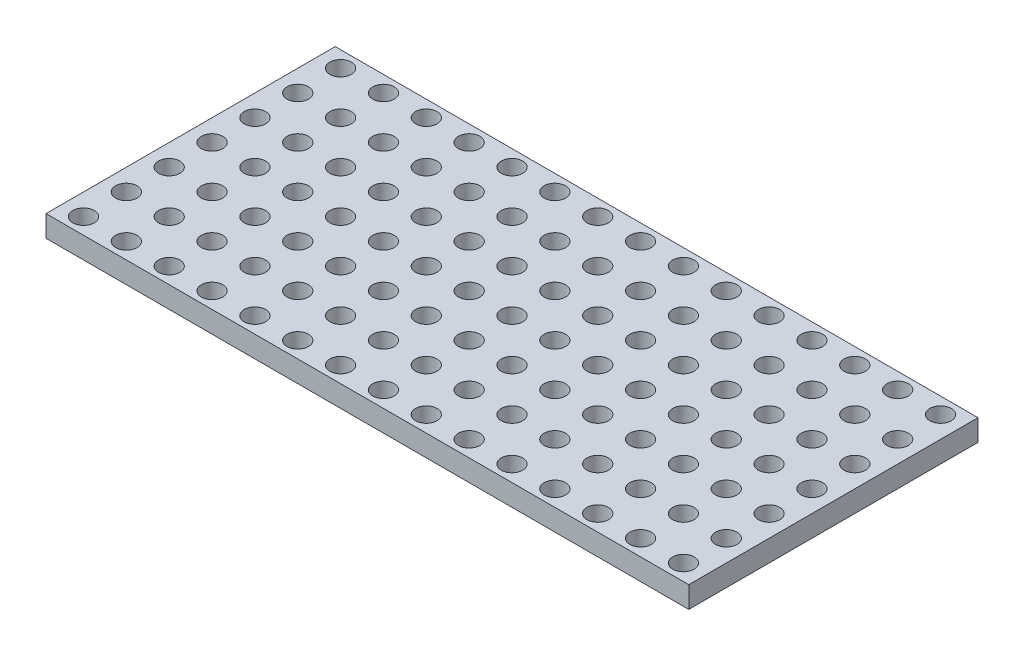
ISO-10303-21;
HEADER;
FILE_DESCRIPTION(('STEP AP214'),'2;1');
FILE_NAME('part.step','',(''),(''),'','','');
FILE_SCHEMA(('AUTOMOTIVE_DESIGN { 1 0 10303 214 1 1 1 1 }'));
ENDSEC;
DATA;
#1=APPLICATION_CONTEXT('core data for automotive mechanical design processes');
#2=APPLICATION_PROTOCOL_DEFINITION('international standard','automotive_design',2000,#1);
#3=PRODUCT_CONTEXT('',#1,'mechanical');
#4=PRODUCT('Part','Part','',(#3));
#5=PRODUCT_RELATED_PRODUCT_CATEGORY('part','',(#4));
#6=PRODUCT_DEFINITION_FORMATION('','',#4);
#7=PRODUCT_DEFINITION_CONTEXT('part definition',#1,'design');
#8=PRODUCT_DEFINITION('design','',#6,#7);
#9=PRODUCT_DEFINITION_SHAPE('','',#8);
#10=(LENGTH_UNIT() NAMED_UNIT(*) SI_UNIT(.MILLI.,.METRE.));
#11=(NAMED_UNIT(*) PLANE_ANGLE_UNIT() SI_UNIT($,.RADIAN.));
#12=(NAMED_UNIT(*) SI_UNIT($,.STERADIAN.) SOLID_ANGLE_UNIT());
#13=UNCERTAINTY_MEASURE_WITH_UNIT(LENGTH_MEASURE(1.E-05),#10,'distance_accuracy_value','');
#14=(GEOMETRIC_REPRESENTATION_CONTEXT(3) GLOBAL_UNCERTAINTY_ASSIGNED_CONTEXT((#13)) GLOBAL_UNIT_ASSIGNED_CONTEXT((#10,
#11,#12)) REPRESENTATION_CONTEXT('',''));
#15=CARTESIAN_POINT('',(0.,0.,0.));
#16=DIRECTION('',(0.,0.,1.));
#17=DIRECTION('',(1.,0.,0.));
#18=AXIS2_PLACEMENT_3D('',#15,#16,#17);
#19=CARTESIAN_POINT('',(-95.25,6.35,-42.8625));
#20=DIRECTION('',(1.,0.,0.));
#21=DIRECTION('',(0.,0.,-1.));
#22=AXIS2_PLACEMENT_3D('',#19,#20,#21);
#23=PLANE('',#22);
#24=DIRECTION('',(0.,0.,1.));
#25=VECTOR('',#24,1.);
#26=CARTESIAN_POINT('',(-95.25,0.,-42.8625));
#27=LINE('',#26,#25);
#28=CARTESIAN_POINT('',(-95.25,0.,-42.8625));
#29=VERTEX_POINT('',#28);
#30=CARTESIAN_POINT('',(-95.25,0.,42.8625));
#31=VERTEX_POINT('',#30);
#32=EDGE_CURVE('E101',#29,#31,#27,.T.);
#33=ORIENTED_EDGE('',*,*,#32,.T.);
#34=DIRECTION('',(0.,-1.,0.));
#35=VECTOR('',#34,1.);
#36=CARTESIAN_POINT('',(-95.25,6.35,42.8625));
#37=LINE('',#36,#35);
#38=CARTESIAN_POINT('',(-95.25,6.35,42.8625));
#39=VERTEX_POINT('',#38);
#40=EDGE_CURVE('E12',#39,#31,#37,.T.);
#41=ORIENTED_EDGE('',*,*,#40,.F.);
#42=DIRECTION('',(0.,0.,1.));
#43=VECTOR('',#42,1.);
#44=CARTESIAN_POINT('',(-95.25,6.35,-42.8625));
#45=LINE('',#44,#43);
#46=CARTESIAN_POINT('',(-95.25,6.35,-42.8625));
#47=VERTEX_POINT('',#46);
#48=EDGE_CURVE('E89',#47,#39,#45,.T.);
#49=ORIENTED_EDGE('',*,*,#48,.F.);
#50=DIRECTION('',(0.,-1.,0.));
#51=VECTOR('',#50,1.);
#52=CARTESIAN_POINT('',(-95.25,6.35,-42.8625));
#53=LINE('',#52,#51);
#54=EDGE_CURVE('E97',#47,#29,#53,.T.);
#55=ORIENTED_EDGE('',*,*,#54,.T.);
#56=EDGE_LOOP('',(#33,#41,#49,#55));
#57=FACE_BOUND('',#56,.T.);
#58=ADVANCED_FACE('F38',(#57),#23,.F.);
#59=CARTESIAN_POINT('',(-95.25,6.35,42.8625));
#60=DIRECTION('',(0.,0.,-1.));
#61=DIRECTION('',(-1.,0.,0.));
#62=AXIS2_PLACEMENT_3D('',#59,#60,#61);
#63=PLANE('',#62);
#64=DIRECTION('',(1.,0.,0.));
#65=VECTOR('',#64,1.);
#66=CARTESIAN_POINT('',(-95.25,0.,42.8625));
#67=LINE('',#66,#65);
#68=CARTESIAN_POINT('',(95.25,0.,42.8625));
#69=VERTEX_POINT('',#68);
#70=EDGE_CURVE('E93',#31,#69,#67,.T.);
#71=ORIENTED_EDGE('',*,*,#70,.T.);
#72=DIRECTION('',(0.,-1.,0.));
#73=VECTOR('',#72,1.);
#74=CARTESIAN_POINT('',(95.25,6.35,42.8625));
#75=LINE('',#74,#73);
#76=CARTESIAN_POINT('',(95.25,6.35,42.8625));
#77=VERTEX_POINT('',#76);
#78=EDGE_CURVE('E46',#77,#69,#75,.T.);
#79=ORIENTED_EDGE('',*,*,#78,.F.);
#80=DIRECTION('',(1.,0.,0.));
#81=VECTOR('',#80,1.);
#82=CARTESIAN_POINT('',(-95.25,6.35,42.8625));
#83=LINE('',#82,#81);
#84=EDGE_CURVE('E84',#39,#77,#83,.T.);
#85=ORIENTED_EDGE('',*,*,#84,.F.);
#86=ORIENTED_EDGE('',*,*,#40,.T.);
#87=EDGE_LOOP('',(#71,#79,#85,#86));
#88=FACE_BOUND('',#87,.T.);
#89=ADVANCED_FACE('F92',(#88),#63,.F.);
#90=CARTESIAN_POINT('',(95.25,6.35,-42.8625));
#91=DIRECTION('',(-1.,0.,0.));
#92=DIRECTION('',(0.,0.,1.));
#93=AXIS2_PLACEMENT_3D('',#90,#91,#92);
#94=PLANE('',#93);
#95=DIRECTION('',(0.,0.,-1.));
#96=VECTOR('',#95,1.);
#97=CARTESIAN_POINT('',(95.25,0.,-42.8625));
#98=LINE('',#97,#96);
#99=CARTESIAN_POINT('',(95.25,0.,-42.8625));
#100=VERTEX_POINT('',#99);
#101=EDGE_CURVE('E71',#69,#100,#98,.T.);
#102=ORIENTED_EDGE('',*,*,#101,.T.);
#103=DIRECTION('',(0.,-1.,0.));
#104=VECTOR('',#103,1.);
#105=CARTESIAN_POINT('',(95.25,6.35,-42.8625));
#106=LINE('',#105,#104);
#107=CARTESIAN_POINT('',(95.25,6.35,-42.8625));
#108=VERTEX_POINT('',#107);
#109=EDGE_CURVE('E94',#108,#100,#106,.T.);
#110=ORIENTED_EDGE('',*,*,#109,.F.);
#111=DIRECTION('',(0.,0.,-1.));
#112=VECTOR('',#111,1.);
#113=CARTESIAN_POINT('',(95.25,6.35,-42.8625));
#114=LINE('',#113,#112);
#115=EDGE_CURVE('E87',#77,#108,#114,.T.);
#116=ORIENTED_EDGE('',*,*,#115,.F.);
#117=ORIENTED_EDGE('',*,*,#78,.T.);
#118=EDGE_LOOP('',(#102,#110,#116,#117));
#119=FACE_BOUND('',#118,.T.);
#120=ADVANCED_FACE('F95',(#119),#94,.F.);
#121=CARTESIAN_POINT('',(-95.25,6.35,-42.8625));
#122=DIRECTION('',(0.,0.,1.));
#123=DIRECTION('',(1.,0.,0.));
#124=AXIS2_PLACEMENT_3D('',#121,#122,#123);
#125=PLANE('',#124);
#126=DIRECTION('',(-1.,0.,0.));
#127=VECTOR('',#126,1.);
#128=CARTESIAN_POINT('',(-95.25,0.,-42.8625));
#129=LINE('',#128,#127);
#130=EDGE_CURVE('E77',#100,#29,#129,.T.);
#131=ORIENTED_EDGE('',*,*,#130,.T.);
#132=ORIENTED_EDGE('',*,*,#54,.F.);
#133=DIRECTION('',(-1.,0.,0.));
#134=VECTOR('',#133,1.);
#135=CARTESIAN_POINT('',(-95.25,6.35,-42.8625));
#136=LINE('',#135,#134);
#137=EDGE_CURVE('E54',#108,#47,#136,.T.);
#138=ORIENTED_EDGE('',*,*,#137,.F.);
#139=ORIENTED_EDGE('',*,*,#109,.T.);
#140=EDGE_LOOP('',(#131,#132,#138,#139));
#141=FACE_BOUND('',#140,.T.);
#142=ADVANCED_FACE('F109',(#141),#125,.F.);
#143=CARTESIAN_POINT('',(0.,6.35,0.));
#144=DIRECTION('',(0.,1.,0.));
#145=DIRECTION('',(0.,0.,1.));
#146=AXIS2_PLACEMENT_3D('',#143,#144,#145);
#147=PLANE('',#146);
#148=CARTESIAN_POINT('',(-50.8,6.35,-12.6999999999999));
#149=DIRECTION('',(0.,1.,0.));
#150=DIRECTION('',(1.,0.,0.));
#151=AXIS2_PLACEMENT_3D('',#148,#149,#150);
#152=CIRCLE('',#151,3.175);
#153=CARTESIAN_POINT('',(-47.625,6.35,-12.6999999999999));
#154=VERTEX_POINT('',#153);
#155=EDGE_CURVE('E386',#154,#154,#152,.T.);
#156=ORIENTED_EDGE('',*,*,#155,.F.);
#157=EDGE_LOOP('',(#156));
#158=FACE_BOUND('',#157,.T.);
#159=CARTESIAN_POINT('',(-63.5,6.35,25.4000000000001));
#160=DIRECTION('',(0.,1.,0.));
#161=DIRECTION('',(1.,0.,0.));
#162=AXIS2_PLACEMENT_3D('',#159,#160,#161);
#163=CIRCLE('',#162,3.175);
#164=CARTESIAN_POINT('',(-60.325,6.35,25.4000000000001));
#165=VERTEX_POINT('',#164);
#166=EDGE_CURVE('E380',#165,#165,#163,.T.);
#167=ORIENTED_EDGE('',*,*,#166,.F.);
#168=EDGE_LOOP('',(#167));
#169=FACE_BOUND('',#168,.T.);
#170=CARTESIAN_POINT('',(25.4,6.35,0.));
#171=DIRECTION('',(0.,1.,0.));
#172=DIRECTION('',(1.,0.,0.));
#173=AXIS2_PLACEMENT_3D('',#170,#171,#172);
#174=CIRCLE('',#173,3.175);
#175=CARTESIAN_POINT('',(28.575,6.35,0.));
#176=VERTEX_POINT('',#175);
#177=EDGE_CURVE('E374',#176,#176,#174,.T.);
#178=ORIENTED_EDGE('',*,*,#177,.F.);
#179=EDGE_LOOP('',(#178));
#180=FACE_BOUND('',#179,.T.);
#181=CARTESIAN_POINT('',(-12.7000000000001,6.35,-38.1));
#182=DIRECTION('',(0.,1.,0.));
#183=DIRECTION('',(1.,0.,0.));
#184=AXIS2_PLACEMENT_3D('',#181,#182,#183);
#185=CIRCLE('',#184,3.175);
#186=CARTESIAN_POINT('',(-9.52500000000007,6.35,-38.1));
#187=VERTEX_POINT('',#186);
#188=EDGE_CURVE('E367',#187,#187,#185,.T.);
#189=ORIENTED_EDGE('',*,*,#188,.F.);
#190=EDGE_LOOP('',(#189));
#191=FACE_BOUND('',#190,.T.);
#192=CARTESIAN_POINT('',(-50.8,6.35,-25.3999999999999));
#193=DIRECTION('',(0.,1.,0.));
#194=DIRECTION('',(1.,0.,0.));
#195=AXIS2_PLACEMENT_3D('',#192,#193,#194);
#196=CIRCLE('',#195,3.175);
#197=CARTESIAN_POINT('',(-47.625,6.35,-25.3999999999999));
#198=VERTEX_POINT('',#197);
#199=EDGE_CURVE('E410',#198,#198,#196,.T.);
#200=ORIENTED_EDGE('',*,*,#199,.F.);
#201=EDGE_LOOP('',(#200));
#202=FACE_BOUND('',#201,.T.);
#203=CARTESIAN_POINT('',(-63.5,6.35,12.7000000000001));
#204=DIRECTION('',(0.,1.,0.));
#205=DIRECTION('',(1.,0.,0.));
#206=AXIS2_PLACEMENT_3D('',#203,#204,#205);
#207=CIRCLE('',#206,3.175);
#208=CARTESIAN_POINT('',(-60.325,6.35,12.7000000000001));
#209=VERTEX_POINT('',#208);
#210=EDGE_CURVE('E404',#209,#209,#207,.T.);
#211=ORIENTED_EDGE('',*,*,#210,.F.);
#212=EDGE_LOOP('',(#211));
#213=FACE_BOUND('',#212,.T.);
#214=CARTESIAN_POINT('',(25.4,6.35,12.7));
#215=DIRECTION('',(0.,1.,0.));
#216=DIRECTION('',(1.,0.,0.));
#217=AXIS2_PLACEMENT_3D('',#214,#215,#216);
#218=CIRCLE('',#217,3.175);
#219=CARTESIAN_POINT('',(28.575,6.35,12.7));
#220=VERTEX_POINT('',#219);
#221=EDGE_CURVE('E398',#220,#220,#218,.T.);
#222=ORIENTED_EDGE('',*,*,#221,.F.);
#223=EDGE_LOOP('',(#222));
#224=FACE_BOUND('',#223,.T.);
#225=CARTESIAN_POINT('',(0.,6.35,-38.1));
#226=DIRECTION('',(0.,1.,0.));
#227=DIRECTION('',(1.,0.,0.));
#228=AXIS2_PLACEMENT_3D('',#225,#226,#227);
#229=CIRCLE('',#228,3.175);
#230=CARTESIAN_POINT('',(3.17499999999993,6.35,-38.1));
#231=VERTEX_POINT('',#230);
#232=EDGE_CURVE('E391',#231,#231,#229,.T.);
#233=ORIENTED_EDGE('',*,*,#232,.F.);
#234=EDGE_LOOP('',(#233));
#235=FACE_BOUND('',#234,.T.);
#236=CARTESIAN_POINT('',(-38.1000000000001,6.35,-38.0999999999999));
#237=DIRECTION('',(0.,1.,0.));
#238=DIRECTION('',(1.,0.,0.));
#239=AXIS2_PLACEMENT_3D('',#236,#237,#238);
#240=CIRCLE('',#239,3.175);
#241=CARTESIAN_POINT('',(-34.9250000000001,6.35,-38.0999999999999));
#242=VERTEX_POINT('',#241);
#243=EDGE_CURVE('E331',#242,#242,#240,.T.);
#244=ORIENTED_EDGE('',*,*,#243,.F.);
#245=EDGE_LOOP('',(#244));
#246=FACE_BOUND('',#245,.T.);
#247=CARTESIAN_POINT('',(25.4,6.35,-25.4000000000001));
#248=DIRECTION('',(0.,1.,0.));
#249=DIRECTION('',(1.,0.,0.));
#250=AXIS2_PLACEMENT_3D('',#247,#248,#249);
#251=CIRCLE('',#250,3.175);
#252=CARTESIAN_POINT('',(28.575,6.35,-25.4000000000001));
#253=VERTEX_POINT('',#252);
#254=EDGE_CURVE('E338',#253,#253,#251,.T.);
#255=ORIENTED_EDGE('',*,*,#254,.F.);
#256=EDGE_LOOP('',(#255));
#257=FACE_BOUND('',#256,.T.);
#258=CARTESIAN_POINT('',(-50.8,6.35,12.7000000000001));
#259=DIRECTION('',(0.,1.,0.));
#260=DIRECTION('',(1.,0.,0.));
#261=AXIS2_PLACEMENT_3D('',#258,#259,#260);
#262=CIRCLE('',#261,3.175);
#263=CARTESIAN_POINT('',(-47.625,6.35,12.7000000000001));
#264=VERTEX_POINT('',#263);
#265=EDGE_CURVE('E319',#264,#264,#262,.T.);
#266=ORIENTED_EDGE('',*,*,#265,.F.);
#267=EDGE_LOOP('',(#266));
#268=FACE_BOUND('',#267,.T.);
#269=CARTESIAN_POINT('',(-38.1,6.35,-25.3999999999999));
#270=DIRECTION('',(0.,1.,0.));
#271=DIRECTION('',(1.,0.,0.));
#272=AXIS2_PLACEMENT_3D('',#269,#270,#271);
#273=CIRCLE('',#272,3.175);
#274=CARTESIAN_POINT('',(-34.925,6.35,-25.3999999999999));
#275=VERTEX_POINT('',#274);
#276=EDGE_CURVE('E326',#275,#275,#273,.T.);
#277=ORIENTED_EDGE('',*,*,#276,.F.);
#278=EDGE_LOOP('',(#277));
#279=FACE_BOUND('',#278,.T.);
#280=CARTESIAN_POINT('',(-50.8,6.35,0.));
#281=DIRECTION('',(0.,1.,0.));
#282=DIRECTION('',(1.,0.,0.));
#283=AXIS2_PLACEMENT_3D('',#280,#281,#282);
#284=CIRCLE('',#283,3.175);
#285=CARTESIAN_POINT('',(-47.625,6.35,0.));
#286=VERTEX_POINT('',#285);
#287=EDGE_CURVE('E362',#286,#286,#284,.T.);
#288=ORIENTED_EDGE('',*,*,#287,.F.);
#289=EDGE_LOOP('',(#288));
#290=FACE_BOUND('',#289,.T.);
#291=CARTESIAN_POINT('',(-63.4999999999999,6.35,38.1000000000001));
#292=DIRECTION('',(0.,1.,0.));
#293=DIRECTION('',(1.,0.,0.));
#294=AXIS2_PLACEMENT_3D('',#291,#292,#293);
#295=CIRCLE('',#294,3.175);
#296=CARTESIAN_POINT('',(-60.3249999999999,6.35,38.1000000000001));
#297=VERTEX_POINT('',#296);
#298=EDGE_CURVE('E356',#297,#297,#295,.T.);
#299=ORIENTED_EDGE('',*,*,#298,.F.);
#300=EDGE_LOOP('',(#299));
#301=FACE_BOUND('',#300,.T.);
#302=CARTESIAN_POINT('',(25.4,6.35,-12.7000000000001));
#303=DIRECTION('',(0.,1.,0.));
#304=DIRECTION('',(1.,0.,0.));
#305=AXIS2_PLACEMENT_3D('',#302,#303,#304);
#306=CIRCLE('',#305,3.175);
#307=CARTESIAN_POINT('',(28.575,6.35,-12.7000000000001));
#308=VERTEX_POINT('',#307);
#309=EDGE_CURVE('E350',#308,#308,#306,.T.);
#310=ORIENTED_EDGE('',*,*,#309,.F.);
#311=EDGE_LOOP('',(#310));
#312=FACE_BOUND('',#311,.T.);
#313=CARTESIAN_POINT('',(-25.4000000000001,6.35,-38.1));
#314=DIRECTION('',(0.,1.,0.));
#315=DIRECTION('',(1.,0.,0.));
#316=AXIS2_PLACEMENT_3D('',#313,#314,#315);
#317=CIRCLE('',#316,3.175);
#318=CARTESIAN_POINT('',(-22.2250000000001,6.35,-38.1));
#319=VERTEX_POINT('',#318);
#320=EDGE_CURVE('E343',#319,#319,#317,.T.);
#321=ORIENTED_EDGE('',*,*,#320,.F.);
#322=EDGE_LOOP('',(#321));
#323=FACE_BOUND('',#322,.T.);
#324=CARTESIAN_POINT('',(-76.2,6.35,1.26634813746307E-13));
#325=DIRECTION('',(0.,1.,0.));
#326=DIRECTION('',(1.,0.,0.));
#327=AXIS2_PLACEMENT_3D('',#324,#325,#326);
#328=CIRCLE('',#327,3.175);
#329=CARTESIAN_POINT('',(-73.025,6.35,1.26634813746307E-13));
#330=VERTEX_POINT('',#329);
#331=EDGE_CURVE('E475',#330,#330,#328,.T.);
#332=ORIENTED_EDGE('',*,*,#331,.F.);
#333=EDGE_LOOP('',(#332));
#334=FACE_BOUND('',#333,.T.);
#335=CARTESIAN_POINT('',(-63.5000000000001,6.35,-38.0999999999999));
#336=DIRECTION('',(0.,1.,0.));
#337=DIRECTION('',(1.,0.,0.));
#338=AXIS2_PLACEMENT_3D('',#335,#336,#337);
#339=CIRCLE('',#338,3.175);
#340=CARTESIAN_POINT('',(-60.3250000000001,6.35,-38.0999999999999));
#341=VERTEX_POINT('',#340);
#342=EDGE_CURVE('E482',#341,#341,#339,.T.);
#343=ORIENTED_EDGE('',*,*,#342,.F.);
#344=EDGE_LOOP('',(#343));
#345=FACE_BOUND('',#344,.T.);
#346=CARTESIAN_POINT('',(38.0999999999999,6.35,-38.1000000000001));
#347=DIRECTION('',(0.,1.,0.));
#348=DIRECTION('',(1.,0.,0.));
#349=AXIS2_PLACEMENT_3D('',#346,#347,#348);
#350=CIRCLE('',#349,3.175);
#351=CARTESIAN_POINT('',(41.2749999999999,6.35,-38.1000000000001));
#352=VERTEX_POINT('',#351);
#353=EDGE_CURVE('E463',#352,#352,#350,.T.);
#354=ORIENTED_EDGE('',*,*,#353,.F.);
#355=EDGE_LOOP('',(#354));
#356=FACE_BOUND('',#355,.T.);
#357=CARTESIAN_POINT('',(-76.2,6.35,12.7000000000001));
#358=DIRECTION('',(0.,1.,0.));
#359=DIRECTION('',(1.,0.,0.));
#360=AXIS2_PLACEMENT_3D('',#357,#358,#359);
#361=CIRCLE('',#360,3.175);
#362=CARTESIAN_POINT('',(-73.025,6.35,12.7000000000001));
#363=VERTEX_POINT('',#362);
#364=EDGE_CURVE('E470',#363,#363,#361,.T.);
#365=ORIENTED_EDGE('',*,*,#364,.F.);
#366=EDGE_LOOP('',(#365));
#367=FACE_BOUND('',#366,.T.);
#368=CARTESIAN_POINT('',(-88.9,6.35,25.4000000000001));
#369=DIRECTION('',(0.,1.,0.));
#370=DIRECTION('',(1.,0.,0.));
#371=AXIS2_PLACEMENT_3D('',#368,#369,#370);
#372=CIRCLE('',#371,3.175);
#373=CARTESIAN_POINT('',(-85.725,6.35,25.4000000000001));
#374=VERTEX_POINT('',#373);
#375=EDGE_CURVE('E499',#374,#374,#372,.T.);
#376=ORIENTED_EDGE('',*,*,#375,.F.);
#377=EDGE_LOOP('',(#376));
#378=FACE_BOUND('',#377,.T.);
#379=CARTESIAN_POINT('',(-76.2000000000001,6.35,-12.6999999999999));
#380=DIRECTION('',(0.,1.,0.));
#381=DIRECTION('',(1.,0.,0.));
#382=AXIS2_PLACEMENT_3D('',#379,#380,#381);
#383=CIRCLE('',#382,3.175);
#384=CARTESIAN_POINT('',(-73.0250000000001,6.35,-12.6999999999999));
#385=VERTEX_POINT('',#384);
#386=EDGE_CURVE('E506',#385,#385,#383,.T.);
#387=ORIENTED_EDGE('',*,*,#386,.F.);
#388=EDGE_LOOP('',(#387));
#389=FACE_BOUND('',#388,.T.);
#390=CARTESIAN_POINT('',(38.1,6.35,-25.4000000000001));
#391=DIRECTION('',(0.,1.,0.));
#392=DIRECTION('',(1.,0.,0.));
#393=AXIS2_PLACEMENT_3D('',#390,#391,#392);
#394=CIRCLE('',#393,3.175);
#395=CARTESIAN_POINT('',(41.2749999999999,6.35,-25.4000000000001));
#396=VERTEX_POINT('',#395);
#397=EDGE_CURVE('E487',#396,#396,#394,.T.);
#398=ORIENTED_EDGE('',*,*,#397,.F.);
#399=EDGE_LOOP('',(#398));
#400=FACE_BOUND('',#399,.T.);
#401=CARTESIAN_POINT('',(-88.9,6.35,38.1000000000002));
#402=DIRECTION('',(0.,1.,0.));
#403=DIRECTION('',(1.,0.,0.));
#404=AXIS2_PLACEMENT_3D('',#401,#402,#403);
#405=CIRCLE('',#404,3.175);
#406=CARTESIAN_POINT('',(-85.725,6.35,38.1000000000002));
#407=VERTEX_POINT('',#406);
#408=EDGE_CURVE('E494',#407,#407,#405,.T.);
#409=ORIENTED_EDGE('',*,*,#408,.F.);
#410=EDGE_LOOP('',(#409));
#411=FACE_BOUND('',#410,.T.);
#412=CARTESIAN_POINT('',(12.6999999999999,6.35,-38.1));
#413=DIRECTION('',(0.,1.,0.));
#414=DIRECTION('',(1.,0.,0.));
#415=AXIS2_PLACEMENT_3D('',#412,#413,#414);
#416=CIRCLE('',#415,3.175);
#417=CARTESIAN_POINT('',(15.8749999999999,6.35,-38.1));
#418=VERTEX_POINT('',#417);
#419=EDGE_CURVE('E427',#418,#418,#416,.T.);
#420=ORIENTED_EDGE('',*,*,#419,.F.);
#421=EDGE_LOOP('',(#420));
#422=FACE_BOUND('',#421,.T.);
#423=CARTESIAN_POINT('',(-76.2,6.35,38.1000000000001));
#424=DIRECTION('',(0.,1.,0.));
#425=DIRECTION('',(1.,0.,0.));
#426=AXIS2_PLACEMENT_3D('',#423,#424,#425);
#427=CIRCLE('',#426,3.175);
#428=CARTESIAN_POINT('',(-73.025,6.35,38.1000000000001));
#429=VERTEX_POINT('',#428);
#430=EDGE_CURVE('E434',#429,#429,#427,.T.);
#431=ORIENTED_EDGE('',*,*,#430,.F.);
#432=EDGE_LOOP('',(#431));
#433=FACE_BOUND('',#432,.T.);
#434=CARTESIAN_POINT('',(-63.5,6.35,1.07552855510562E-13));
#435=DIRECTION('',(0.,1.,0.));
#436=DIRECTION('',(1.,0.,0.));
#437=AXIS2_PLACEMENT_3D('',#434,#435,#436);
#438=CIRCLE('',#437,3.175);
#439=CARTESIAN_POINT('',(-60.325,6.35,1.07552855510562E-13));
#440=VERTEX_POINT('',#439);
#441=EDGE_CURVE('E415',#440,#440,#438,.T.);
#442=ORIENTED_EDGE('',*,*,#441,.F.);
#443=EDGE_LOOP('',(#442));
#444=FACE_BOUND('',#443,.T.);
#445=CARTESIAN_POINT('',(-50.8000000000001,6.35,-38.0999999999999));
#446=DIRECTION('',(0.,1.,0.));
#447=DIRECTION('',(1.,0.,0.));
#448=AXIS2_PLACEMENT_3D('',#445,#446,#447);
#449=CIRCLE('',#448,3.175);
#450=CARTESIAN_POINT('',(-47.6250000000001,6.35,-38.0999999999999));
#451=VERTEX_POINT('',#450);
#452=EDGE_CURVE('E422',#451,#451,#449,.T.);
#453=ORIENTED_EDGE('',*,*,#452,.F.);
#454=EDGE_LOOP('',(#453));
#455=FACE_BOUND('',#454,.T.);
#456=CARTESIAN_POINT('',(-63.5000000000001,6.35,-12.6999999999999));
#457=DIRECTION('',(0.,1.,0.));
#458=DIRECTION('',(1.,0.,0.));
#459=AXIS2_PLACEMENT_3D('',#456,#457,#458);
#460=CIRCLE('',#459,3.175);
#461=CARTESIAN_POINT('',(-60.3250000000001,6.35,-12.6999999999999));
#462=VERTEX_POINT('',#461);
#463=EDGE_CURVE('E458',#462,#462,#460,.T.);
#464=ORIENTED_EDGE('',*,*,#463,.F.);
#465=EDGE_LOOP('',(#464));
#466=FACE_BOUND('',#465,.T.);
#467=CARTESIAN_POINT('',(-76.2,6.35,25.4000000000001));
#468=DIRECTION('',(0.,1.,0.));
#469=DIRECTION('',(1.,0.,0.));
#470=AXIS2_PLACEMENT_3D('',#467,#468,#469);
#471=CIRCLE('',#470,3.175);
#472=CARTESIAN_POINT('',(-73.025,6.35,25.4000000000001));
#473=VERTEX_POINT('',#472);
#474=EDGE_CURVE('E452',#473,#473,#471,.T.);
#475=ORIENTED_EDGE('',*,*,#474,.F.);
#476=EDGE_LOOP('',(#475));
#477=FACE_BOUND('',#476,.T.);
#478=CARTESIAN_POINT('',(25.3999999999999,6.35,-38.1000000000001));
#479=DIRECTION('',(0.,1.,0.));
#480=DIRECTION('',(1.,0.,0.));
#481=AXIS2_PLACEMENT_3D('',#478,#479,#480);
#482=CIRCLE('',#481,3.175);
#483=CARTESIAN_POINT('',(28.5749999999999,6.35,-38.1000000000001));
#484=VERTEX_POINT('',#483);
#485=EDGE_CURVE('E446',#484,#484,#482,.T.);
#486=ORIENTED_EDGE('',*,*,#485,.F.);
#487=EDGE_LOOP('',(#486));
#488=FACE_BOUND('',#487,.T.);
#489=CARTESIAN_POINT('',(-63.5000000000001,6.35,-25.3999999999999));
#490=DIRECTION('',(0.,1.,0.));
#491=DIRECTION('',(1.,0.,0.));
#492=AXIS2_PLACEMENT_3D('',#489,#490,#491);
#493=CIRCLE('',#492,3.175);
#494=CARTESIAN_POINT('',(-60.3250000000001,6.35,-25.3999999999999));
#495=VERTEX_POINT('',#494);
#496=EDGE_CURVE('E439',#495,#495,#493,.T.);
#497=ORIENTED_EDGE('',*,*,#496,.F.);
#498=EDGE_LOOP('',(#497));
#499=FACE_BOUND('',#498,.T.);
#500=CARTESIAN_POINT('',(-12.7,6.35,-12.7));
#501=DIRECTION('',(0.,1.,0.));
#502=DIRECTION('',(1.,0.,0.));
#503=AXIS2_PLACEMENT_3D('',#500,#501,#502);
#504=CIRCLE('',#503,3.175);
#505=CARTESIAN_POINT('',(-9.52500000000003,6.35,-12.7));
#506=VERTEX_POINT('',#505);
#507=EDGE_CURVE('E187',#506,#506,#504,.T.);
#508=ORIENTED_EDGE('',*,*,#507,.F.);
#509=EDGE_LOOP('',(#508));
#510=FACE_BOUND('',#509,.T.);
#511=CARTESIAN_POINT('',(0.,6.35,38.1));
#512=DIRECTION('',(0.,1.,0.));
#513=DIRECTION('',(1.,0.,0.));
#514=AXIS2_PLACEMENT_3D('',#511,#512,#513);
#515=CIRCLE('',#514,3.175);
#516=CARTESIAN_POINT('',(3.17500000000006,6.35,38.1));
#517=VERTEX_POINT('',#516);
#518=EDGE_CURVE('E194',#517,#517,#515,.T.);
#519=ORIENTED_EDGE('',*,*,#518,.F.);
#520=EDGE_LOOP('',(#519));
#521=FACE_BOUND('',#520,.T.);
#522=CARTESIAN_POINT('',(-12.7,6.35,25.4));
#523=DIRECTION('',(0.,1.,0.));
#524=DIRECTION('',(1.,0.,0.));
#525=AXIS2_PLACEMENT_3D('',#522,#523,#524);
#526=CIRCLE('',#525,3.175);
#527=CARTESIAN_POINT('',(-9.52499999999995,6.35,25.4));
#528=VERTEX_POINT('',#527);
#529=EDGE_CURVE('E175',#528,#528,#526,.T.);
#530=ORIENTED_EDGE('',*,*,#529,.F.);
#531=EDGE_LOOP('',(#530));
#532=FACE_BOUND('',#531,.T.);
#533=CARTESIAN_POINT('',(-12.7,6.35,0.));
#534=DIRECTION('',(0.,1.,0.));
#535=DIRECTION('',(1.,0.,0.));
#536=AXIS2_PLACEMENT_3D('',#533,#534,#535);
#537=CIRCLE('',#536,3.175);
#538=CARTESIAN_POINT('',(-9.525,6.35,0.));
#539=VERTEX_POINT('',#538);
#540=EDGE_CURVE('E182',#539,#539,#537,.T.);
#541=ORIENTED_EDGE('',*,*,#540,.F.);
#542=EDGE_LOOP('',(#541));
#543=FACE_BOUND('',#542,.T.);
#544=CARTESIAN_POINT('',(-25.4,6.35,25.4));
#545=DIRECTION('',(0.,1.,0.));
#546=DIRECTION('',(1.,0.,0.));
#547=AXIS2_PLACEMENT_3D('',#544,#545,#546);
#548=CIRCLE('',#547,3.175);
#549=CARTESIAN_POINT('',(-22.225,6.35,25.4));
#550=VERTEX_POINT('',#549);
#551=EDGE_CURVE('E218',#550,#550,#548,.T.);
#552=ORIENTED_EDGE('',*,*,#551,.F.);
#553=EDGE_LOOP('',(#552));
#554=FACE_BOUND('',#553,.T.);
#555=CARTESIAN_POINT('',(-12.6999999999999,6.35,38.1));
#556=DIRECTION('',(0.,1.,0.));
#557=DIRECTION('',(1.,0.,0.));
#558=AXIS2_PLACEMENT_3D('',#555,#556,#557);
#559=CIRCLE('',#558,3.175);
#560=CARTESIAN_POINT('',(-9.52499999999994,6.35,38.1));
#561=VERTEX_POINT('',#560);
#562=EDGE_CURVE('E212',#561,#561,#559,.T.);
#563=ORIENTED_EDGE('',*,*,#562,.F.);
#564=EDGE_LOOP('',(#563));
#565=FACE_BOUND('',#564,.T.);
#566=CARTESIAN_POINT('',(0.,6.35,-12.7));
#567=DIRECTION('',(0.,1.,0.));
#568=DIRECTION('',(1.,0.,0.));
#569=AXIS2_PLACEMENT_3D('',#566,#567,#568);
#570=CIRCLE('',#569,3.175);
#571=CARTESIAN_POINT('',(3.17499999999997,6.35,-12.7));
#572=VERTEX_POINT('',#571);
#573=EDGE_CURVE('E206',#572,#572,#570,.T.);
#574=ORIENTED_EDGE('',*,*,#573,.F.);
#575=EDGE_LOOP('',(#574));
#576=FACE_BOUND('',#575,.T.);
#577=CARTESIAN_POINT('',(-25.4,6.35,12.7));
#578=DIRECTION('',(0.,1.,0.));
#579=DIRECTION('',(1.,0.,0.));
#580=AXIS2_PLACEMENT_3D('',#577,#578,#579);
#581=CIRCLE('',#580,3.175);
#582=CARTESIAN_POINT('',(-22.225,6.35,12.7));
#583=VERTEX_POINT('',#582);
#584=EDGE_CURVE('E199',#583,#583,#581,.T.);
#585=ORIENTED_EDGE('',*,*,#584,.F.);
#586=EDGE_LOOP('',(#585));
#587=FACE_BOUND('',#586,.T.);
#588=CARTESIAN_POINT('',(25.4,6.35,25.4));
#589=DIRECTION('',(0.,1.,0.));
#590=DIRECTION('',(1.,0.,0.));
#591=AXIS2_PLACEMENT_3D('',#588,#589,#590);
#592=CIRCLE('',#591,3.175);
#593=CARTESIAN_POINT('',(28.575,6.35,25.4));
#594=VERTEX_POINT('',#593);
#595=EDGE_CURVE('E146',#594,#594,#592,.T.);
#596=ORIENTED_EDGE('',*,*,#595,.F.);
#597=EDGE_LOOP('',(#596));
#598=FACE_BOUND('',#597,.T.);
#599=CARTESIAN_POINT('',(38.1000000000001,6.35,38.0999999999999));
#600=DIRECTION('',(0.,1.,0.));
#601=DIRECTION('',(1.,0.,0.));
#602=AXIS2_PLACEMENT_3D('',#599,#600,#601);
#603=CIRCLE('',#602,3.175);
#604=CARTESIAN_POINT('',(41.2750000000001,6.35,38.0999999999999));
#605=VERTEX_POINT('',#604);
#606=EDGE_CURVE('E140',#605,#605,#603,.T.);
#607=ORIENTED_EDGE('',*,*,#606,.F.);
#608=EDGE_LOOP('',(#607));
#609=FACE_BOUND('',#608,.T.);
#610=CARTESIAN_POINT('',(0.,6.35,12.7));
#611=DIRECTION('',(0.,1.,0.));
#612=DIRECTION('',(1.,0.,0.));
#613=AXIS2_PLACEMENT_3D('',#610,#611,#612);
#614=CIRCLE('',#613,3.175);
#615=CARTESIAN_POINT('',(3.17500000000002,6.35,12.7));
#616=VERTEX_POINT('',#615);
#617=EDGE_CURVE('E134',#616,#616,#614,.T.);
#618=ORIENTED_EDGE('',*,*,#617,.F.);
#619=EDGE_LOOP('',(#618));
#620=FACE_BOUND('',#619,.T.);
#621=CARTESIAN_POINT('',(12.7,6.35,25.4));
#622=DIRECTION('',(0.,1.,0.));
#623=DIRECTION('',(1.,0.,0.));
#624=AXIS2_PLACEMENT_3D('',#621,#622,#623);
#625=CIRCLE('',#624,3.175);
#626=CARTESIAN_POINT('',(15.875,6.35,25.4));
#627=VERTEX_POINT('',#626);
#628=EDGE_CURVE('E127',#627,#627,#625,.T.);
#629=ORIENTED_EDGE('',*,*,#628,.F.);
#630=EDGE_LOOP('',(#629));
#631=FACE_BOUND('',#630,.T.);
#632=CARTESIAN_POINT('',(12.7000000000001,6.35,38.1));
#633=DIRECTION('',(0.,1.,0.));
#634=DIRECTION('',(1.,0.,0.));
#635=AXIS2_PLACEMENT_3D('',#632,#633,#634);
#636=CIRCLE('',#635,3.175);
#637=CARTESIAN_POINT('',(15.8750000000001,6.35,38.1));
#638=VERTEX_POINT('',#637);
#639=EDGE_CURVE('E163',#638,#638,#636,.T.);
#640=ORIENTED_EDGE('',*,*,#639,.F.);
#641=EDGE_LOOP('',(#640));
#642=FACE_BOUND('',#641,.T.);
#643=CARTESIAN_POINT('',(0.,6.35,25.4));
#644=DIRECTION('',(0.,1.,0.));
#645=DIRECTION('',(1.,0.,0.));
#646=AXIS2_PLACEMENT_3D('',#643,#644,#645);
#647=CIRCLE('',#646,3.175);
#648=CARTESIAN_POINT('',(3.17500000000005,6.35,25.4));
#649=VERTEX_POINT('',#648);
#650=EDGE_CURVE('E170',#649,#649,#647,.T.);
#651=ORIENTED_EDGE('',*,*,#650,.F.);
#652=EDGE_LOOP('',(#651));
#653=FACE_BOUND('',#652,.T.);
#654=CARTESIAN_POINT('',(-12.7,6.35,12.7));
#655=DIRECTION('',(0.,1.,0.));
#656=DIRECTION('',(1.,0.,0.));
#657=AXIS2_PLACEMENT_3D('',#654,#655,#656);
#658=CIRCLE('',#657,3.175);
#659=CARTESIAN_POINT('',(-9.52499999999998,6.35,12.7));
#660=VERTEX_POINT('',#659);
#661=EDGE_CURVE('E151',#660,#660,#658,.T.);
#662=ORIENTED_EDGE('',*,*,#661,.F.);
#663=EDGE_LOOP('',(#662));
#664=FACE_BOUND('',#663,.T.);
#665=CARTESIAN_POINT('',(25.4000000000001,6.35,38.1));
#666=DIRECTION('',(0.,1.,0.));
#667=DIRECTION('',(1.,0.,0.));
#668=AXIS2_PLACEMENT_3D('',#665,#666,#667);
#669=CIRCLE('',#668,3.175);
#670=CARTESIAN_POINT('',(28.5750000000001,6.35,38.1));
#671=VERTEX_POINT('',#670);
#672=EDGE_CURVE('E158',#671,#671,#669,.T.);
#673=ORIENTED_EDGE('',*,*,#672,.F.);
#674=EDGE_LOOP('',(#673));
#675=FACE_BOUND('',#674,.T.);
#676=CARTESIAN_POINT('',(-50.7999999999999,6.35,38.1000000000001));
#677=DIRECTION('',(0.,1.,0.));
#678=DIRECTION('',(1.,0.,0.));
#679=AXIS2_PLACEMENT_3D('',#676,#677,#678);
#680=CIRCLE('',#679,3.175);
#681=CARTESIAN_POINT('',(-47.6249999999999,6.35,38.1000000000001));
#682=VERTEX_POINT('',#681);
#683=EDGE_CURVE('E283',#682,#682,#680,.T.);
#684=ORIENTED_EDGE('',*,*,#683,.F.);
#685=EDGE_LOOP('',(#684));
#686=FACE_BOUND('',#685,.T.);
#687=CARTESIAN_POINT('',(-38.1,6.35,0.));
#688=DIRECTION('',(0.,1.,0.));
#689=DIRECTION('',(1.,0.,0.));
#690=AXIS2_PLACEMENT_3D('',#687,#688,#689);
#691=CIRCLE('',#690,3.175);
#692=CARTESIAN_POINT('',(-34.925,6.35,0.));
#693=VERTEX_POINT('',#692);
#694=EDGE_CURVE('E290',#693,#693,#691,.T.);
#695=ORIENTED_EDGE('',*,*,#694,.F.);
#696=EDGE_LOOP('',(#695));
#697=FACE_BOUND('',#696,.T.);
#698=CARTESIAN_POINT('',(-12.7000000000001,6.35,-25.4));
#699=DIRECTION('',(0.,1.,0.));
#700=DIRECTION('',(1.,0.,0.));
#701=AXIS2_PLACEMENT_3D('',#698,#699,#700);
#702=CIRCLE('',#701,3.175);
#703=CARTESIAN_POINT('',(-9.52500000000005,6.35,-25.4));
#704=VERTEX_POINT('',#703);
#705=EDGE_CURVE('E271',#704,#704,#702,.T.);
#706=ORIENTED_EDGE('',*,*,#705,.F.);
#707=EDGE_LOOP('',(#706));
#708=FACE_BOUND('',#707,.T.);
#709=CARTESIAN_POINT('',(-38.1,6.35,12.7000000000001));
#710=DIRECTION('',(0.,1.,0.));
#711=DIRECTION('',(1.,0.,0.));
#712=AXIS2_PLACEMENT_3D('',#709,#710,#711);
#713=CIRCLE('',#712,3.175);
#714=CARTESIAN_POINT('',(-34.925,6.35,12.7000000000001));
#715=VERTEX_POINT('',#714);
#716=EDGE_CURVE('E278',#715,#715,#713,.T.);
#717=ORIENTED_EDGE('',*,*,#716,.F.);
#718=EDGE_LOOP('',(#717));
#719=FACE_BOUND('',#718,.T.);
#720=CARTESIAN_POINT('',(12.6999999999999,6.35,-25.4));
#721=DIRECTION('',(0.,1.,0.));
#722=DIRECTION('',(1.,0.,0.));
#723=AXIS2_PLACEMENT_3D('',#720,#721,#722);
#724=CIRCLE('',#723,3.175);
#725=CARTESIAN_POINT('',(15.8749999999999,6.35,-25.4));
#726=VERTEX_POINT('',#725);
#727=EDGE_CURVE('E307',#726,#726,#724,.T.);
#728=ORIENTED_EDGE('',*,*,#727,.F.);
#729=EDGE_LOOP('',(#728));
#730=FACE_BOUND('',#729,.T.);
#731=CARTESIAN_POINT('',(-50.8,6.35,25.4000000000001));
#732=DIRECTION('',(0.,1.,0.));
#733=DIRECTION('',(1.,0.,0.));
#734=AXIS2_PLACEMENT_3D('',#731,#732,#733);
#735=CIRCLE('',#734,3.175);
#736=CARTESIAN_POINT('',(-47.625,6.35,25.4000000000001));
#737=VERTEX_POINT('',#736);
#738=EDGE_CURVE('E314',#737,#737,#735,.T.);
#739=ORIENTED_EDGE('',*,*,#738,.F.);
#740=EDGE_LOOP('',(#739));
#741=FACE_BOUND('',#740,.T.);
#742=CARTESIAN_POINT('',(-38.1,6.35,-12.6999999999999));
#743=DIRECTION('',(0.,1.,0.));
#744=DIRECTION('',(1.,0.,0.));
#745=AXIS2_PLACEMENT_3D('',#742,#743,#744);
#746=CIRCLE('',#745,3.175);
#747=CARTESIAN_POINT('',(-34.925,6.35,-12.6999999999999));
#748=VERTEX_POINT('',#747);
#749=EDGE_CURVE('E295',#748,#748,#746,.T.);
#750=ORIENTED_EDGE('',*,*,#749,.F.);
#751=EDGE_LOOP('',(#750));
#752=FACE_BOUND('',#751,.T.);
#753=CARTESIAN_POINT('',(0.,6.35,-25.4));
#754=DIRECTION('',(0.,1.,0.));
#755=DIRECTION('',(1.,0.,0.));
#756=AXIS2_PLACEMENT_3D('',#753,#754,#755);
#757=CIRCLE('',#756,3.175);
#758=CARTESIAN_POINT('',(3.17499999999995,6.35,-25.4));
#759=VERTEX_POINT('',#758);
#760=EDGE_CURVE('E302',#759,#759,#757,.T.);
#761=ORIENTED_EDGE('',*,*,#760,.F.);
#762=EDGE_LOOP('',(#761));
#763=FACE_BOUND('',#762,.T.);
#764=CARTESIAN_POINT('',(-38.0999999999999,6.35,38.1000000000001));
#765=DIRECTION('',(0.,1.,0.));
#766=DIRECTION('',(1.,0.,0.));
#767=AXIS2_PLACEMENT_3D('',#764,#765,#766);
#768=CIRCLE('',#767,3.175);
#769=CARTESIAN_POINT('',(-34.9249999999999,6.35,38.1000000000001));
#770=VERTEX_POINT('',#769);
#771=EDGE_CURVE('E235',#770,#770,#768,.T.);
#772=ORIENTED_EDGE('',*,*,#771,.F.);
#773=EDGE_LOOP('',(#772));
#774=FACE_BOUND('',#773,.T.);
#775=CARTESIAN_POINT('',(-25.4,6.35,0.));
#776=DIRECTION('',(0.,1.,0.));
#777=DIRECTION('',(1.,0.,0.));
#778=AXIS2_PLACEMENT_3D('',#775,#776,#777);
#779=CIRCLE('',#778,3.175);
#780=CARTESIAN_POINT('',(-22.225,6.35,0.));
#781=VERTEX_POINT('',#780);
#782=EDGE_CURVE('E242',#781,#781,#779,.T.);
#783=ORIENTED_EDGE('',*,*,#782,.F.);
#784=EDGE_LOOP('',(#783));
#785=FACE_BOUND('',#784,.T.);
#786=CARTESIAN_POINT('',(12.7,6.35,-12.7));
#787=DIRECTION('',(0.,1.,0.));
#788=DIRECTION('',(1.,0.,0.));
#789=AXIS2_PLACEMENT_3D('',#786,#787,#788);
#790=CIRCLE('',#789,3.175);
#791=CARTESIAN_POINT('',(15.875,6.35,-12.7));
#792=VERTEX_POINT('',#791);
#793=EDGE_CURVE('E223',#792,#792,#790,.T.);
#794=ORIENTED_EDGE('',*,*,#793,.F.);
#795=EDGE_LOOP('',(#794));
#796=FACE_BOUND('',#795,.T.);
#797=CARTESIAN_POINT('',(-25.3999999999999,6.35,38.1));
#798=DIRECTION('',(0.,1.,0.));
#799=DIRECTION('',(1.,0.,0.));
#800=AXIS2_PLACEMENT_3D('',#797,#798,#799);
#801=CIRCLE('',#800,3.175);
#802=CARTESIAN_POINT('',(-22.2249999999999,6.35,38.1));
#803=VERTEX_POINT('',#802);
#804=EDGE_CURVE('E230',#803,#803,#801,.T.);
#805=ORIENTED_EDGE('',*,*,#804,.F.);
#806=EDGE_LOOP('',(#805));
#807=FACE_BOUND('',#806,.T.);
#808=CARTESIAN_POINT('',(-25.4000000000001,6.35,-25.4));
#809=DIRECTION('',(0.,1.,0.));
#810=DIRECTION('',(1.,0.,0.));
#811=AXIS2_PLACEMENT_3D('',#808,#809,#810);
#812=CIRCLE('',#811,3.175);
#813=CARTESIAN_POINT('',(-22.2250000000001,6.35,-25.4));
#814=VERTEX_POINT('',#813);
#815=EDGE_CURVE('E259',#814,#814,#812,.T.);
#816=ORIENTED_EDGE('',*,*,#815,.F.);
#817=EDGE_LOOP('',(#816));
#818=FACE_BOUND('',#817,.T.);
#819=CARTESIAN_POINT('',(-38.1,6.35,25.4000000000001));
#820=DIRECTION('',(0.,1.,0.));
#821=DIRECTION('',(1.,0.,0.));
#822=AXIS2_PLACEMENT_3D('',#819,#820,#821);
#823=CIRCLE('',#822,3.175);
#824=CARTESIAN_POINT('',(-34.925,6.35,25.4000000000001));
#825=VERTEX_POINT('',#824);
#826=EDGE_CURVE('E266',#825,#825,#823,.T.);
#827=ORIENTED_EDGE('',*,*,#826,.F.);
#828=EDGE_LOOP('',(#827));
#829=FACE_BOUND('',#828,.T.);
#830=CARTESIAN_POINT('',(-25.4,6.35,-12.7));
#831=DIRECTION('',(0.,1.,0.));
#832=DIRECTION('',(1.,0.,0.));
#833=AXIS2_PLACEMENT_3D('',#830,#831,#832);
#834=CIRCLE('',#833,3.175);
#835=CARTESIAN_POINT('',(-22.225,6.35,-12.7));
#836=VERTEX_POINT('',#835);
#837=EDGE_CURVE('E247',#836,#836,#834,.T.);
#838=ORIENTED_EDGE('',*,*,#837,.F.);
#839=EDGE_LOOP('',(#838));
#840=FACE_BOUND('',#839,.T.);
#841=CARTESIAN_POINT('',(12.7,6.35,0.));
#842=DIRECTION('',(0.,1.,0.));
#843=DIRECTION('',(1.,0.,0.));
#844=AXIS2_PLACEMENT_3D('',#841,#842,#843);
#845=CIRCLE('',#844,3.175);
#846=CARTESIAN_POINT('',(15.875,6.35,0.));
#847=VERTEX_POINT('',#846);
#848=EDGE_CURVE('E254',#847,#847,#845,.T.);
#849=ORIENTED_EDGE('',*,*,#848,.F.);
#850=EDGE_LOOP('',(#849));
#851=FACE_BOUND('',#850,.T.);
#852=CARTESIAN_POINT('',(63.5000000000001,6.35,25.3999999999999));
#853=DIRECTION('',(0.,1.,0.));
#854=DIRECTION('',(1.,0.,0.));
#855=AXIS2_PLACEMENT_3D('',#852,#853,#854);
#856=CIRCLE('',#855,3.175);
#857=CARTESIAN_POINT('',(66.6750000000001,6.35,25.3999999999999));
#858=VERTEX_POINT('',#857);
#859=EDGE_CURVE('E674',#858,#858,#856,.T.);
#860=ORIENTED_EDGE('',*,*,#859,.F.);
#861=EDGE_LOOP('',(#860));
#862=FACE_BOUND('',#861,.T.);
#863=CARTESIAN_POINT('',(63.5,6.35,12.6999999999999));
#864=DIRECTION('',(0.,1.,0.));
#865=DIRECTION('',(1.,0.,0.));
#866=AXIS2_PLACEMENT_3D('',#863,#864,#865);
#867=CIRCLE('',#866,3.175);
#868=CARTESIAN_POINT('',(66.675,6.35,12.6999999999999));
#869=VERTEX_POINT('',#868);
#870=EDGE_CURVE('E681',#869,#869,#867,.T.);
#871=ORIENTED_EDGE('',*,*,#870,.F.);
#872=EDGE_LOOP('',(#871));
#873=FACE_BOUND('',#872,.T.);
#874=CARTESIAN_POINT('',(63.5,6.35,-1.21430643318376E-13));
#875=DIRECTION('',(0.,1.,0.));
#876=DIRECTION('',(1.,0.,0.));
#877=AXIS2_PLACEMENT_3D('',#874,#875,#876);
#878=CIRCLE('',#877,3.175);
#879=CARTESIAN_POINT('',(66.675,6.35,-1.21430643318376E-13));
#880=VERTEX_POINT('',#879);
#881=EDGE_CURVE('E687',#880,#880,#878,.T.);
#882=ORIENTED_EDGE('',*,*,#881,.F.);
#883=EDGE_LOOP('',(#882));
#884=FACE_BOUND('',#883,.T.);
#885=CARTESIAN_POINT('',(63.5,6.35,-12.7000000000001));
#886=DIRECTION('',(0.,1.,0.));
#887=DIRECTION('',(1.,0.,0.));
#888=AXIS2_PLACEMENT_3D('',#885,#886,#887);
#889=CIRCLE('',#888,3.175);
#890=CARTESIAN_POINT('',(66.675,6.35,-12.7000000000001));
#891=VERTEX_POINT('',#890);
#892=EDGE_CURVE('E693',#891,#891,#889,.T.);
#893=ORIENTED_EDGE('',*,*,#892,.F.);
#894=EDGE_LOOP('',(#893));
#895=FACE_BOUND('',#894,.T.);
#896=CARTESIAN_POINT('',(63.5,6.35,-25.4000000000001));
#897=DIRECTION('',(0.,1.,0.));
#898=DIRECTION('',(1.,0.,0.));
#899=AXIS2_PLACEMENT_3D('',#896,#897,#898);
#900=CIRCLE('',#899,3.175);
#901=CARTESIAN_POINT('',(66.675,6.35,-25.4000000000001));
#902=VERTEX_POINT('',#901);
#903=EDGE_CURVE('E650',#902,#902,#900,.T.);
#904=ORIENTED_EDGE('',*,*,#903,.F.);
#905=EDGE_LOOP('',(#904));
#906=FACE_BOUND('',#905,.T.);
#907=CARTESIAN_POINT('',(63.4999999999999,6.35,-38.1000000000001));
#908=DIRECTION('',(0.,1.,0.));
#909=DIRECTION('',(1.,0.,0.));
#910=AXIS2_PLACEMENT_3D('',#907,#908,#909);
#911=CIRCLE('',#910,3.175);
#912=CARTESIAN_POINT('',(66.6749999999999,6.35,-38.1000000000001));
#913=VERTEX_POINT('',#912);
#914=EDGE_CURVE('E657',#913,#913,#911,.T.);
#915=ORIENTED_EDGE('',*,*,#914,.F.);
#916=EDGE_LOOP('',(#915));
#917=FACE_BOUND('',#916,.T.);
#918=CARTESIAN_POINT('',(50.8000000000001,6.35,38.0999999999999));
#919=DIRECTION('',(0.,1.,0.));
#920=DIRECTION('',(1.,0.,0.));
#921=AXIS2_PLACEMENT_3D('',#918,#919,#920);
#922=CIRCLE('',#921,3.175);
#923=CARTESIAN_POINT('',(53.9750000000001,6.35,38.0999999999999));
#924=VERTEX_POINT('',#923);
#925=EDGE_CURVE('E663',#924,#924,#922,.T.);
#926=ORIENTED_EDGE('',*,*,#925,.F.);
#927=EDGE_LOOP('',(#926));
#928=FACE_BOUND('',#927,.T.);
#929=CARTESIAN_POINT('',(50.8,6.35,25.3999999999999));
#930=DIRECTION('',(0.,1.,0.));
#931=DIRECTION('',(1.,0.,0.));
#932=AXIS2_PLACEMENT_3D('',#929,#930,#931);
#933=CIRCLE('',#932,3.175);
#934=CARTESIAN_POINT('',(53.975,6.35,25.3999999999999));
#935=VERTEX_POINT('',#934);
#936=EDGE_CURVE('E669',#935,#935,#933,.T.);
#937=ORIENTED_EDGE('',*,*,#936,.F.);
#938=EDGE_LOOP('',(#937));
#939=FACE_BOUND('',#938,.T.);
#940=CARTESIAN_POINT('',(76.2000000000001,6.35,38.0999999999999));
#941=DIRECTION('',(0.,1.,0.));
#942=DIRECTION('',(1.,0.,0.));
#943=AXIS2_PLACEMENT_3D('',#940,#941,#942);
#944=CIRCLE('',#943,3.175);
#945=CARTESIAN_POINT('',(79.3750000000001,6.35,38.0999999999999));
#946=VERTEX_POINT('',#945);
#947=EDGE_CURVE('E553',#946,#946,#944,.T.);
#948=ORIENTED_EDGE('',*,*,#947,.F.);
#949=EDGE_LOOP('',(#948));
#950=FACE_BOUND('',#949,.T.);
#951=CARTESIAN_POINT('',(76.2000000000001,6.35,25.3999999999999));
#952=DIRECTION('',(0.,1.,0.));
#953=DIRECTION('',(1.,0.,0.));
#954=AXIS2_PLACEMENT_3D('',#951,#952,#953);
#955=CIRCLE('',#954,3.175);
#956=CARTESIAN_POINT('',(79.3750000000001,6.35,25.3999999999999));
#957=VERTEX_POINT('',#956);
#958=EDGE_CURVE('E727',#957,#957,#955,.T.);
#959=ORIENTED_EDGE('',*,*,#958,.F.);
#960=EDGE_LOOP('',(#959));
#961=FACE_BOUND('',#960,.T.);
#962=CARTESIAN_POINT('',(76.2000000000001,6.35,12.6999999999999));
#963=DIRECTION('',(0.,1.,0.));
#964=DIRECTION('',(1.,0.,0.));
#965=AXIS2_PLACEMENT_3D('',#962,#963,#964);
#966=CIRCLE('',#965,3.175);
#967=CARTESIAN_POINT('',(79.3750000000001,6.35,12.6999999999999));
#968=VERTEX_POINT('',#967);
#969=EDGE_CURVE('E733',#968,#968,#966,.T.);
#970=ORIENTED_EDGE('',*,*,#969,.F.);
#971=EDGE_LOOP('',(#970));
#972=FACE_BOUND('',#971,.T.);
#973=CARTESIAN_POINT('',(76.2,6.35,-1.38777878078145E-13));
#974=DIRECTION('',(0.,1.,0.));
#975=DIRECTION('',(1.,0.,0.));
#976=AXIS2_PLACEMENT_3D('',#973,#974,#975);
#977=CIRCLE('',#976,3.175);
#978=CARTESIAN_POINT('',(79.375,6.35,-1.38777878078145E-13));
#979=VERTEX_POINT('',#978);
#980=EDGE_CURVE('E739',#979,#979,#977,.T.);
#981=ORIENTED_EDGE('',*,*,#980,.F.);
#982=EDGE_LOOP('',(#981));
#983=FACE_BOUND('',#982,.T.);
#984=CARTESIAN_POINT('',(63.5000000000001,6.35,38.0999999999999));
#985=DIRECTION('',(0.,1.,0.));
#986=DIRECTION('',(1.,0.,0.));
#987=AXIS2_PLACEMENT_3D('',#984,#985,#986);
#988=CIRCLE('',#987,3.175);
#989=CARTESIAN_POINT('',(66.6750000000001,6.35,38.0999999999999));
#990=VERTEX_POINT('',#989);
#991=EDGE_CURVE('E705',#990,#990,#988,.T.);
#992=ORIENTED_EDGE('',*,*,#991,.F.);
#993=EDGE_LOOP('',(#992));
#994=FACE_BOUND('',#993,.T.);
#995=CARTESIAN_POINT('',(76.1999999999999,6.35,-38.1000000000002));
#996=DIRECTION('',(0.,1.,0.));
#997=DIRECTION('',(1.,0.,0.));
#998=AXIS2_PLACEMENT_3D('',#995,#996,#997);
#999=CIRCLE('',#998,3.175);
#1000=CARTESIAN_POINT('',(79.3749999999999,6.35,-38.1000000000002));
#1001=VERTEX_POINT('',#1000);
#1002=EDGE_CURVE('E698',#1001,#1001,#999,.T.);
#1003=ORIENTED_EDGE('',*,*,#1002,.F.);
#1004=EDGE_LOOP('',(#1003));
#1005=FACE_BOUND('',#1004,.T.);
#1006=CARTESIAN_POINT('',(76.2,6.35,-25.4000000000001));
#1007=DIRECTION('',(0.,1.,0.));
#1008=DIRECTION('',(1.,0.,0.));
#1009=AXIS2_PLACEMENT_3D('',#1006,#1007,#1008);
#1010=CIRCLE('',#1009,3.175);
#1011=CARTESIAN_POINT('',(79.375,6.35,-25.4000000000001));
#1012=VERTEX_POINT('',#1011);
#1013=EDGE_CURVE('E717',#1012,#1012,#1010,.T.);
#1014=ORIENTED_EDGE('',*,*,#1013,.F.);
#1015=EDGE_LOOP('',(#1014));
#1016=FACE_BOUND('',#1015,.T.);
#1017=CARTESIAN_POINT('',(76.2,6.35,-12.7000000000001));
#1018=DIRECTION('',(0.,1.,0.));
#1019=DIRECTION('',(1.,0.,0.));
#1020=AXIS2_PLACEMENT_3D('',#1017,#1018,#1019);
#1021=CIRCLE('',#1020,3.175);
#1022=CARTESIAN_POINT('',(79.375,6.35,-12.7000000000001));
#1023=VERTEX_POINT('',#1022);
#1024=EDGE_CURVE('E710',#1023,#1023,#1021,.T.);
#1025=ORIENTED_EDGE('',*,*,#1024,.F.);
#1026=EDGE_LOOP('',(#1025));
#1027=FACE_BOUND('',#1026,.T.);
#1028=CARTESIAN_POINT('',(-76.2000000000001,6.35,-38.0999999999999));
#1029=DIRECTION('',(0.,1.,0.));
#1030=DIRECTION('',(1.,0.,0.));
#1031=AXIS2_PLACEMENT_3D('',#1028,#1029,#1030);
#1032=CIRCLE('',#1031,3.175);
#1033=CARTESIAN_POINT('',(-73.0250000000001,6.35,-38.0999999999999));
#1034=VERTEX_POINT('',#1033);
#1035=EDGE_CURVE('E585',#1034,#1034,#1032,.T.);
#1036=ORIENTED_EDGE('',*,*,#1035,.F.);
#1037=EDGE_LOOP('',(#1036));
#1038=FACE_BOUND('',#1037,.T.);
#1039=CARTESIAN_POINT('',(-88.9000000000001,6.35,1.38777878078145E-13));
#1040=DIRECTION('',(0.,1.,0.));
#1041=DIRECTION('',(1.,0.,0.));
#1042=AXIS2_PLACEMENT_3D('',#1039,#1040,#1041);
#1043=CIRCLE('',#1042,3.175);
#1044=CARTESIAN_POINT('',(-85.7250000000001,6.35,1.38777878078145E-13));
#1045=VERTEX_POINT('',#1044);
#1046=EDGE_CURVE('E578',#1045,#1045,#1043,.T.);
#1047=ORIENTED_EDGE('',*,*,#1046,.F.);
#1048=EDGE_LOOP('',(#1047));
#1049=FACE_BOUND('',#1048,.T.);
#1050=CARTESIAN_POINT('',(38.1,6.35,12.6999999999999));
#1051=DIRECTION('',(0.,1.,0.));
#1052=DIRECTION('',(1.,0.,0.));
#1053=AXIS2_PLACEMENT_3D('',#1050,#1051,#1052);
#1054=CIRCLE('',#1053,3.175);
#1055=CARTESIAN_POINT('',(41.275,6.35,12.6999999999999));
#1056=VERTEX_POINT('',#1055);
#1057=EDGE_CURVE('E597',#1056,#1056,#1054,.T.);
#1058=ORIENTED_EDGE('',*,*,#1057,.F.);
#1059=EDGE_LOOP('',(#1058));
#1060=FACE_BOUND('',#1059,.T.);
#1061=CARTESIAN_POINT('',(-88.9000000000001,6.35,-12.6999999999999));
#1062=DIRECTION('',(0.,1.,0.));
#1063=DIRECTION('',(1.,0.,0.));
#1064=AXIS2_PLACEMENT_3D('',#1061,#1062,#1063);
#1065=CIRCLE('',#1064,3.175);
#1066=CARTESIAN_POINT('',(-85.7250000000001,6.35,-12.6999999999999));
#1067=VERTEX_POINT('',#1066);
#1068=EDGE_CURVE('E590',#1067,#1067,#1065,.T.);
#1069=ORIENTED_EDGE('',*,*,#1068,.F.);
#1070=EDGE_LOOP('',(#1069));
#1071=FACE_BOUND('',#1070,.T.);
#1072=CARTESIAN_POINT('',(38.1,6.35,0.));
#1073=DIRECTION('',(0.,1.,0.));
#1074=DIRECTION('',(1.,0.,0.));
#1075=AXIS2_PLACEMENT_3D('',#1072,#1073,#1074);
#1076=CIRCLE('',#1075,3.175);
#1077=CARTESIAN_POINT('',(41.275,6.35,0.));
#1078=VERTEX_POINT('',#1077);
#1079=EDGE_CURVE('E554',#1078,#1078,#1076,.T.);
#1080=ORIENTED_EDGE('',*,*,#1079,.F.);
#1081=EDGE_LOOP('',(#1080));
#1082=FACE_BOUND('',#1081,.T.);
#1083=CARTESIAN_POINT('',(-88.9,6.35,12.7000000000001));
#1084=DIRECTION('',(0.,1.,0.));
#1085=DIRECTION('',(1.,0.,0.));
#1086=AXIS2_PLACEMENT_3D('',#1083,#1084,#1085);
#1087=CIRCLE('',#1086,3.175);
#1088=CARTESIAN_POINT('',(-85.725,6.35,12.7000000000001));
#1089=VERTEX_POINT('',#1088);
#1090=EDGE_CURVE('E561',#1089,#1089,#1087,.T.);
#1091=ORIENTED_EDGE('',*,*,#1090,.F.);
#1092=EDGE_LOOP('',(#1091));
#1093=FACE_BOUND('',#1092,.T.);
#1094=CARTESIAN_POINT('',(-76.2000000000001,6.35,-25.3999999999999));
#1095=DIRECTION('',(0.,1.,0.));
#1096=DIRECTION('',(1.,0.,0.));
#1097=AXIS2_PLACEMENT_3D('',#1094,#1095,#1096);
#1098=CIRCLE('',#1097,3.175);
#1099=CARTESIAN_POINT('',(-73.0250000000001,6.35,-25.3999999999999));
#1100=VERTEX_POINT('',#1099);
#1101=EDGE_CURVE('E567',#1100,#1100,#1098,.T.);
#1102=ORIENTED_EDGE('',*,*,#1101,.F.);
#1103=EDGE_LOOP('',(#1102));
#1104=FACE_BOUND('',#1103,.T.);
#1105=CARTESIAN_POINT('',(38.1,6.35,-12.7000000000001));
#1106=DIRECTION('',(0.,1.,0.));
#1107=DIRECTION('',(1.,0.,0.));
#1108=AXIS2_PLACEMENT_3D('',#1105,#1106,#1107);
#1109=CIRCLE('',#1108,3.175);
#1110=CARTESIAN_POINT('',(41.275,6.35,-12.7000000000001));
#1111=VERTEX_POINT('',#1110);
#1112=EDGE_CURVE('E573',#1111,#1111,#1109,.T.);
#1113=ORIENTED_EDGE('',*,*,#1112,.F.);
#1114=EDGE_LOOP('',(#1113));
#1115=FACE_BOUND('',#1114,.T.);
#1116=CARTESIAN_POINT('',(50.8,6.35,12.6999999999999));
#1117=DIRECTION('',(0.,1.,0.));
#1118=DIRECTION('',(1.,0.,0.));
#1119=AXIS2_PLACEMENT_3D('',#1116,#1117,#1118);
#1120=CIRCLE('',#1119,3.175);
#1121=CARTESIAN_POINT('',(53.975,6.35,12.6999999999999));
#1122=VERTEX_POINT('',#1121);
#1123=EDGE_CURVE('E626',#1122,#1122,#1120,.T.);
#1124=ORIENTED_EDGE('',*,*,#1123,.F.);
#1125=EDGE_LOOP('',(#1124));
#1126=FACE_BOUND('',#1125,.T.);
#1127=CARTESIAN_POINT('',(50.8,6.35,0.));
#1128=DIRECTION('',(0.,1.,0.));
#1129=DIRECTION('',(1.,0.,0.));
#1130=AXIS2_PLACEMENT_3D('',#1127,#1128,#1129);
#1131=CIRCLE('',#1130,3.175);
#1132=CARTESIAN_POINT('',(53.975,6.35,0.));
#1133=VERTEX_POINT('',#1132);
#1134=EDGE_CURVE('E633',#1133,#1133,#1131,.T.);
#1135=ORIENTED_EDGE('',*,*,#1134,.F.);
#1136=EDGE_LOOP('',(#1135));
#1137=FACE_BOUND('',#1136,.T.);
#1138=CARTESIAN_POINT('',(50.8,6.35,-12.7000000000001));
#1139=DIRECTION('',(0.,1.,0.));
#1140=DIRECTION('',(1.,0.,0.));
#1141=AXIS2_PLACEMENT_3D('',#1138,#1139,#1140);
#1142=CIRCLE('',#1141,3.175);
#1143=CARTESIAN_POINT('',(53.975,6.35,-12.7000000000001));
#1144=VERTEX_POINT('',#1143);
#1145=EDGE_CURVE('E639',#1144,#1144,#1142,.T.);
#1146=ORIENTED_EDGE('',*,*,#1145,.F.);
#1147=EDGE_LOOP('',(#1146));
#1148=FACE_BOUND('',#1147,.T.);
#1149=CARTESIAN_POINT('',(50.7999999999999,6.35,-25.4000000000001));
#1150=DIRECTION('',(0.,1.,0.));
#1151=DIRECTION('',(1.,0.,0.));
#1152=AXIS2_PLACEMENT_3D('',#1149,#1150,#1151);
#1153=CIRCLE('',#1152,3.175);
#1154=CARTESIAN_POINT('',(53.9749999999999,6.35,-25.4000000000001));
#1155=VERTEX_POINT('',#1154);
#1156=EDGE_CURVE('E645',#1155,#1155,#1153,.T.);
#1157=ORIENTED_EDGE('',*,*,#1156,.F.);
#1158=EDGE_LOOP('',(#1157));
#1159=FACE_BOUND('',#1158,.T.);
#1160=CARTESIAN_POINT('',(50.7999999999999,6.35,-38.1000000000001));
#1161=DIRECTION('',(0.,1.,0.));
#1162=DIRECTION('',(1.,0.,0.));
#1163=AXIS2_PLACEMENT_3D('',#1160,#1161,#1162);
#1164=CIRCLE('',#1163,3.175);
#1165=CARTESIAN_POINT('',(53.9749999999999,6.35,-38.1000000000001));
#1166=VERTEX_POINT('',#1165);
#1167=EDGE_CURVE('E602',#1166,#1166,#1164,.T.);
#1168=ORIENTED_EDGE('',*,*,#1167,.F.);
#1169=EDGE_LOOP('',(#1168));
#1170=FACE_BOUND('',#1169,.T.);
#1171=CARTESIAN_POINT('',(-88.9000000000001,6.35,-38.0999999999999));
#1172=DIRECTION('',(0.,1.,0.));
#1173=DIRECTION('',(1.,0.,0.));
#1174=AXIS2_PLACEMENT_3D('',#1171,#1172,#1173);
#1175=CIRCLE('',#1174,3.175);
#1176=CARTESIAN_POINT('',(-85.7250000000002,6.35,-38.0999999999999));
#1177=VERTEX_POINT('',#1176);
#1178=EDGE_CURVE('E609',#1177,#1177,#1175,.T.);
#1179=ORIENTED_EDGE('',*,*,#1178,.F.);
#1180=EDGE_LOOP('',(#1179));
#1181=FACE_BOUND('',#1180,.T.);
#1182=CARTESIAN_POINT('',(-88.9000000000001,6.35,-25.3999999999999));
#1183=DIRECTION('',(0.,1.,0.));
#1184=DIRECTION('',(1.,0.,0.));
#1185=AXIS2_PLACEMENT_3D('',#1182,#1183,#1184);
#1186=CIRCLE('',#1185,3.175);
#1187=CARTESIAN_POINT('',(-85.7250000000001,6.35,-25.3999999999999));
#1188=VERTEX_POINT('',#1187);
#1189=EDGE_CURVE('E615',#1188,#1188,#1186,.T.);
#1190=ORIENTED_EDGE('',*,*,#1189,.F.);
#1191=EDGE_LOOP('',(#1190));
#1192=FACE_BOUND('',#1191,.T.);
#1193=CARTESIAN_POINT('',(38.1,6.35,25.3999999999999));
#1194=DIRECTION('',(0.,1.,0.));
#1195=DIRECTION('',(1.,0.,0.));
#1196=AXIS2_PLACEMENT_3D('',#1193,#1194,#1195);
#1197=CIRCLE('',#1196,3.175);
#1198=CARTESIAN_POINT('',(41.275,6.35,25.3999999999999));
#1199=VERTEX_POINT('',#1198);
#1200=EDGE_CURVE('E621',#1199,#1199,#1197,.T.);
#1201=ORIENTED_EDGE('',*,*,#1200,.F.);
#1202=EDGE_LOOP('',(#1201));
#1203=FACE_BOUND('',#1202,.T.);
#1204=CARTESIAN_POINT('',(88.9,6.35,-38.1000000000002));
#1205=DIRECTION('',(0.,1.,0.));
#1206=DIRECTION('',(1.,0.,0.));
#1207=AXIS2_PLACEMENT_3D('',#1204,#1205,#1206);
#1208=CIRCLE('',#1207,3.175);
#1209=CARTESIAN_POINT('',(92.075,6.35,-38.1000000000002));
#1210=VERTEX_POINT('',#1209);
#1211=EDGE_CURVE('E547',#1210,#1210,#1208,.T.);
#1212=ORIENTED_EDGE('',*,*,#1211,.F.);
#1213=EDGE_LOOP('',(#1212));
#1214=FACE_BOUND('',#1213,.T.);
#1215=CARTESIAN_POINT('',(88.9,6.35,-25.4000000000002));
#1216=DIRECTION('',(0.,1.,0.));
#1217=DIRECTION('',(1.,0.,0.));
#1218=AXIS2_PLACEMENT_3D('',#1215,#1216,#1217);
#1219=CIRCLE('',#1218,3.175);
#1220=CARTESIAN_POINT('',(92.075,6.35,-25.4000000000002));
#1221=VERTEX_POINT('',#1220);
#1222=EDGE_CURVE('E541',#1221,#1221,#1219,.T.);
#1223=ORIENTED_EDGE('',*,*,#1222,.F.);
#1224=EDGE_LOOP('',(#1223));
#1225=FACE_BOUND('',#1224,.T.);
#1226=CARTESIAN_POINT('',(88.9,6.35,-12.7000000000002));
#1227=DIRECTION('',(0.,1.,0.));
#1228=DIRECTION('',(1.,0.,0.));
#1229=AXIS2_PLACEMENT_3D('',#1226,#1227,#1228);
#1230=CIRCLE('',#1229,3.175);
#1231=CARTESIAN_POINT('',(92.075,6.35,-12.7000000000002));
#1232=VERTEX_POINT('',#1231);
#1233=EDGE_CURVE('E535',#1232,#1232,#1230,.T.);
#1234=ORIENTED_EDGE('',*,*,#1233,.F.);
#1235=EDGE_LOOP('',(#1234));
#1236=FACE_BOUND('',#1235,.T.);
#1237=CARTESIAN_POINT('',(88.9,6.35,-1.82145964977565E-13));
#1238=DIRECTION('',(0.,1.,0.));
#1239=DIRECTION('',(1.,0.,0.));
#1240=AXIS2_PLACEMENT_3D('',#1237,#1238,#1239);
#1241=CIRCLE('',#1240,3.175);
#1242=CARTESIAN_POINT('',(92.075,6.35,-1.82145964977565E-13));
#1243=VERTEX_POINT('',#1242);
#1244=EDGE_CURVE('E529',#1243,#1243,#1241,.T.);
#1245=ORIENTED_EDGE('',*,*,#1244,.F.);
#1246=EDGE_LOOP('',(#1245));
#1247=FACE_BOUND('',#1246,.T.);
#1248=CARTESIAN_POINT('',(88.9000000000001,6.35,12.6999999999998));
#1249=DIRECTION('',(0.,1.,0.));
#1250=DIRECTION('',(1.,0.,0.));
#1251=AXIS2_PLACEMENT_3D('',#1248,#1249,#1250);
#1252=CIRCLE('',#1251,3.175);
#1253=CARTESIAN_POINT('',(92.0750000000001,6.35,12.6999999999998));
#1254=VERTEX_POINT('',#1253);
#1255=EDGE_CURVE('E523',#1254,#1254,#1252,.T.);
#1256=ORIENTED_EDGE('',*,*,#1255,.F.);
#1257=EDGE_LOOP('',(#1256));
#1258=FACE_BOUND('',#1257,.T.);
#1259=CARTESIAN_POINT('',(88.9000000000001,6.35,25.3999999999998));
#1260=DIRECTION('',(0.,1.,0.));
#1261=DIRECTION('',(1.,0.,0.));
#1262=AXIS2_PLACEMENT_3D('',#1259,#1260,#1261);
#1263=CIRCLE('',#1262,3.175);
#1264=CARTESIAN_POINT('',(92.0750000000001,6.35,25.3999999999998));
#1265=VERTEX_POINT('',#1264);
#1266=EDGE_CURVE('E517',#1265,#1265,#1263,.T.);
#1267=ORIENTED_EDGE('',*,*,#1266,.F.);
#1268=EDGE_LOOP('',(#1267));
#1269=FACE_BOUND('',#1268,.T.);
#1270=CARTESIAN_POINT('',(88.9000000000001,6.35,38.0999999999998));
#1271=DIRECTION('',(0.,1.,0.));
#1272=DIRECTION('',(1.,0.,0.));
#1273=AXIS2_PLACEMENT_3D('',#1270,#1271,#1272);
#1274=CIRCLE('',#1273,3.175);
#1275=CARTESIAN_POINT('',(92.0750000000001,6.35,38.0999999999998));
#1276=VERTEX_POINT('',#1275);
#1277=EDGE_CURVE('E511',#1276,#1276,#1274,.T.);
#1278=ORIENTED_EDGE('',*,*,#1277,.F.);
#1279=EDGE_LOOP('',(#1278));
#1280=FACE_BOUND('',#1279,.T.);
#1281=CARTESIAN_POINT('',(12.7,6.35,12.7));
#1282=DIRECTION('',(0.,1.,0.));
#1283=DIRECTION('',(1.,0.,0.));
#1284=AXIS2_PLACEMENT_3D('',#1281,#1282,#1283);
#1285=CIRCLE('',#1284,3.175);
#1286=CARTESIAN_POINT('',(15.875,6.35,12.7));
#1287=VERTEX_POINT('',#1286);
#1288=EDGE_CURVE('E121',#1287,#1287,#1285,.T.);
#1289=ORIENTED_EDGE('',*,*,#1288,.F.);
#1290=EDGE_LOOP('',(#1289));
#1291=FACE_BOUND('',#1290,.T.);
#1292=CARTESIAN_POINT('',(0.,6.35,0.));
#1293=DIRECTION('',(0.,1.,0.));
#1294=DIRECTION('',(0.,0.,1.));
#1295=AXIS2_PLACEMENT_3D('',#1292,#1293,#1294);
#1296=CIRCLE('',#1295,3.175);
#1297=CARTESIAN_POINT('',(0.,6.35,3.175));
#1298=VERTEX_POINT('',#1297);
#1299=EDGE_CURVE('E115',#1298,#1298,#1296,.T.);
#1300=ORIENTED_EDGE('',*,*,#1299,.F.);
#1301=EDGE_LOOP('',(#1300));
#1302=FACE_BOUND('',#1301,.T.);
#1303=ORIENTED_EDGE('',*,*,#48,.T.);
#1304=ORIENTED_EDGE('',*,*,#84,.T.);
#1305=ORIENTED_EDGE('',*,*,#115,.T.);
#1306=ORIENTED_EDGE('',*,*,#137,.T.);
#1307=EDGE_LOOP('',(#1303,#1304,#1305,#1306));
#1308=FACE_BOUND('',#1307,.T.);
#1309=ADVANCED_FACE('F85',(#158,#169,#180,#191,#202,#213,#224,#235,#246,#257,#268,#279,#290,
#301,#312,#323,#334,#345,#356,#367,#378,#389,#400,#411,#422,#433,#444,#455,#466,#477,#488,#499,
#510,#521,#532,#543,#554,#565,#576,#587,#598,#609,#620,#631,#642,#653,#664,#675,#686,#697,#708,
#719,#730,#741,#752,#763,#774,#785,#796,#807,#818,#829,#840,#851,#862,#873,#884,#895,#906,#917,
#928,#939,#950,#961,#972,#983,#994,#1005,#1016,#1027,#1038,#1049,#1060,#1071,#1082,#1093,#1104,
#1115,#1126,#1137,#1148,#1159,#1170,#1181,#1192,#1203,#1214,#1225,#1236,#1247,#1258,#1269,#1280,
#1291,#1302,#1308),#147,.T.);
#1310=CARTESIAN_POINT('',(0.,0.,0.));
#1311=DIRECTION('',(0.,1.,0.));
#1312=DIRECTION('',(0.,0.,1.));
#1313=AXIS2_PLACEMENT_3D('',#1310,#1311,#1312);
#1314=PLANE('',#1313);
#1315=CARTESIAN_POINT('',(-50.8,0.,-12.6999999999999));
#1316=DIRECTION('',(0.,1.,0.));
#1317=DIRECTION('',(1.,0.,0.));
#1318=AXIS2_PLACEMENT_3D('',#1315,#1316,#1317);
#1319=CIRCLE('',#1318,3.175);
#1320=CARTESIAN_POINT('',(-47.625,0.,-12.6999999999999));
#1321=VERTEX_POINT('',#1320);
#1322=EDGE_CURVE('E347',#1321,#1321,#1319,.T.);
#1323=ORIENTED_EDGE('',*,*,#1322,.T.);
#1324=EDGE_LOOP('',(#1323));
#1325=FACE_BOUND('',#1324,.T.);
#1326=CARTESIAN_POINT('',(-63.5,0.,25.4000000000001));
#1327=DIRECTION('',(0.,1.,0.));
#1328=DIRECTION('',(1.,0.,0.));
#1329=AXIS2_PLACEMENT_3D('',#1326,#1327,#1328);
#1330=CIRCLE('',#1329,3.175);
#1331=CARTESIAN_POINT('',(-60.325,0.,25.4000000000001));
#1332=VERTEX_POINT('',#1331);
#1333=EDGE_CURVE('E383',#1332,#1332,#1330,.T.);
#1334=ORIENTED_EDGE('',*,*,#1333,.T.);
#1335=EDGE_LOOP('',(#1334));
#1336=FACE_BOUND('',#1335,.T.);
#1337=CARTESIAN_POINT('',(25.4,0.,0.));
#1338=DIRECTION('',(0.,1.,0.));
#1339=DIRECTION('',(1.,0.,0.));
#1340=AXIS2_PLACEMENT_3D('',#1337,#1338,#1339);
#1341=CIRCLE('',#1340,3.175);
#1342=CARTESIAN_POINT('',(28.575,0.,0.));
#1343=VERTEX_POINT('',#1342);
#1344=EDGE_CURVE('E377',#1343,#1343,#1341,.T.);
#1345=ORIENTED_EDGE('',*,*,#1344,.T.);
#1346=EDGE_LOOP('',(#1345));
#1347=FACE_BOUND('',#1346,.T.);
#1348=CARTESIAN_POINT('',(-12.7000000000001,0.,-38.1));
#1349=DIRECTION('',(0.,1.,0.));
#1350=DIRECTION('',(1.,0.,0.));
#1351=AXIS2_PLACEMENT_3D('',#1348,#1349,#1350);
#1352=CIRCLE('',#1351,3.175);
#1353=CARTESIAN_POINT('',(-9.52500000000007,0.,-38.1));
#1354=VERTEX_POINT('',#1353);
#1355=EDGE_CURVE('E370',#1354,#1354,#1352,.T.);
#1356=ORIENTED_EDGE('',*,*,#1355,.T.);
#1357=EDGE_LOOP('',(#1356));
#1358=FACE_BOUND('',#1357,.T.);
#1359=CARTESIAN_POINT('',(-50.8,0.,-25.3999999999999));
#1360=DIRECTION('',(0.,1.,0.));
#1361=DIRECTION('',(1.,0.,0.));
#1362=AXIS2_PLACEMENT_3D('',#1359,#1360,#1361);
#1363=CIRCLE('',#1362,3.175);
#1364=CARTESIAN_POINT('',(-47.625,0.,-25.3999999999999));
#1365=VERTEX_POINT('',#1364);
#1366=EDGE_CURVE('E371',#1365,#1365,#1363,.T.);
#1367=ORIENTED_EDGE('',*,*,#1366,.T.);
#1368=EDGE_LOOP('',(#1367));
#1369=FACE_BOUND('',#1368,.T.);
#1370=CARTESIAN_POINT('',(-63.5,0.,12.7000000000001));
#1371=DIRECTION('',(0.,1.,0.));
#1372=DIRECTION('',(1.,0.,0.));
#1373=AXIS2_PLACEMENT_3D('',#1370,#1371,#1372);
#1374=CIRCLE('',#1373,3.175);
#1375=CARTESIAN_POINT('',(-60.325,0.,12.7000000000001));
#1376=VERTEX_POINT('',#1375);
#1377=EDGE_CURVE('E407',#1376,#1376,#1374,.T.);
#1378=ORIENTED_EDGE('',*,*,#1377,.T.);
#1379=EDGE_LOOP('',(#1378));
#1380=FACE_BOUND('',#1379,.T.);
#1381=CARTESIAN_POINT('',(25.4,0.,12.7));
#1382=DIRECTION('',(0.,1.,0.));
#1383=DIRECTION('',(1.,0.,0.));
#1384=AXIS2_PLACEMENT_3D('',#1381,#1382,#1383);
#1385=CIRCLE('',#1384,3.175);
#1386=CARTESIAN_POINT('',(28.575,0.,12.7));
#1387=VERTEX_POINT('',#1386);
#1388=EDGE_CURVE('E401',#1387,#1387,#1385,.T.);
#1389=ORIENTED_EDGE('',*,*,#1388,.T.);
#1390=EDGE_LOOP('',(#1389));
#1391=FACE_BOUND('',#1390,.T.);
#1392=CARTESIAN_POINT('',(0.,0.,-38.1));
#1393=DIRECTION('',(0.,1.,0.));
#1394=DIRECTION('',(1.,0.,0.));
#1395=AXIS2_PLACEMENT_3D('',#1392,#1393,#1394);
#1396=CIRCLE('',#1395,3.175);
#1397=CARTESIAN_POINT('',(3.17499999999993,0.,-38.1));
#1398=VERTEX_POINT('',#1397);
#1399=EDGE_CURVE('E394',#1398,#1398,#1396,.T.);
#1400=ORIENTED_EDGE('',*,*,#1399,.T.);
#1401=EDGE_LOOP('',(#1400));
#1402=FACE_BOUND('',#1401,.T.);
#1403=CARTESIAN_POINT('',(-38.1000000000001,0.,-38.0999999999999));
#1404=DIRECTION('',(0.,1.,0.));
#1405=DIRECTION('',(1.,0.,0.));
#1406=AXIS2_PLACEMENT_3D('',#1403,#1404,#1405);
#1407=CIRCLE('',#1406,3.175);
#1408=CARTESIAN_POINT('',(-34.9250000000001,0.,-38.0999999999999));
#1409=VERTEX_POINT('',#1408);
#1410=EDGE_CURVE('E334',#1409,#1409,#1407,.T.);
#1411=ORIENTED_EDGE('',*,*,#1410,.T.);
#1412=EDGE_LOOP('',(#1411));
#1413=FACE_BOUND('',#1412,.T.);
#1414=CARTESIAN_POINT('',(25.4,0.,-25.4000000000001));
#1415=DIRECTION('',(0.,1.,0.));
#1416=DIRECTION('',(1.,0.,0.));
#1417=AXIS2_PLACEMENT_3D('',#1414,#1415,#1416);
#1418=CIRCLE('',#1417,3.175);
#1419=CARTESIAN_POINT('',(28.575,0.,-25.4000000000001));
#1420=VERTEX_POINT('',#1419);
#1421=EDGE_CURVE('E323',#1420,#1420,#1418,.T.);
#1422=ORIENTED_EDGE('',*,*,#1421,.T.);
#1423=EDGE_LOOP('',(#1422));
#1424=FACE_BOUND('',#1423,.T.);
#1425=CARTESIAN_POINT('',(-50.8,0.,12.7000000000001));
#1426=DIRECTION('',(0.,1.,0.));
#1427=DIRECTION('',(1.,0.,0.));
#1428=AXIS2_PLACEMENT_3D('',#1425,#1426,#1427);
#1429=CIRCLE('',#1428,3.175);
#1430=CARTESIAN_POINT('',(-47.625,0.,12.7000000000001));
#1431=VERTEX_POINT('',#1430);
#1432=EDGE_CURVE('E322',#1431,#1431,#1429,.T.);
#1433=ORIENTED_EDGE('',*,*,#1432,.T.);
#1434=EDGE_LOOP('',(#1433));
#1435=FACE_BOUND('',#1434,.T.);
#1436=CARTESIAN_POINT('',(-38.1,0.,-25.3999999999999));
#1437=DIRECTION('',(0.,1.,0.));
#1438=DIRECTION('',(1.,0.,0.));
#1439=AXIS2_PLACEMENT_3D('',#1436,#1437,#1438);
#1440=CIRCLE('',#1439,3.175);
#1441=CARTESIAN_POINT('',(-34.925,0.,-25.3999999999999));
#1442=VERTEX_POINT('',#1441);
#1443=EDGE_CURVE('E311',#1442,#1442,#1440,.T.);
#1444=ORIENTED_EDGE('',*,*,#1443,.T.);
#1445=EDGE_LOOP('',(#1444));
#1446=FACE_BOUND('',#1445,.T.);
#1447=CARTESIAN_POINT('',(-50.8,0.,0.));
#1448=DIRECTION('',(0.,1.,0.));
#1449=DIRECTION('',(1.,0.,0.));
#1450=AXIS2_PLACEMENT_3D('',#1447,#1448,#1449);
#1451=CIRCLE('',#1450,3.175);
#1452=CARTESIAN_POINT('',(-47.625,0.,0.));
#1453=VERTEX_POINT('',#1452);
#1454=EDGE_CURVE('E335',#1453,#1453,#1451,.T.);
#1455=ORIENTED_EDGE('',*,*,#1454,.T.);
#1456=EDGE_LOOP('',(#1455));
#1457=FACE_BOUND('',#1456,.T.);
#1458=CARTESIAN_POINT('',(-63.4999999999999,0.,38.1000000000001));
#1459=DIRECTION('',(0.,1.,0.));
#1460=DIRECTION('',(1.,0.,0.));
#1461=AXIS2_PLACEMENT_3D('',#1458,#1459,#1460);
#1462=CIRCLE('',#1461,3.175);
#1463=CARTESIAN_POINT('',(-60.3249999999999,0.,38.1000000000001));
#1464=VERTEX_POINT('',#1463);
#1465=EDGE_CURVE('E359',#1464,#1464,#1462,.T.);
#1466=ORIENTED_EDGE('',*,*,#1465,.T.);
#1467=EDGE_LOOP('',(#1466));
#1468=FACE_BOUND('',#1467,.T.);
#1469=CARTESIAN_POINT('',(25.4,0.,-12.7000000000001));
#1470=DIRECTION('',(0.,1.,0.));
#1471=DIRECTION('',(1.,0.,0.));
#1472=AXIS2_PLACEMENT_3D('',#1469,#1470,#1471);
#1473=CIRCLE('',#1472,3.175);
#1474=CARTESIAN_POINT('',(28.575,0.,-12.7000000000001));
#1475=VERTEX_POINT('',#1474);
#1476=EDGE_CURVE('E353',#1475,#1475,#1473,.T.);
#1477=ORIENTED_EDGE('',*,*,#1476,.T.);
#1478=EDGE_LOOP('',(#1477));
#1479=FACE_BOUND('',#1478,.T.);
#1480=CARTESIAN_POINT('',(-25.4000000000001,0.,-38.1));
#1481=DIRECTION('',(0.,1.,0.));
#1482=DIRECTION('',(1.,0.,0.));
#1483=AXIS2_PLACEMENT_3D('',#1480,#1481,#1482);
#1484=CIRCLE('',#1483,3.175);
#1485=CARTESIAN_POINT('',(-22.2250000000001,0.,-38.1));
#1486=VERTEX_POINT('',#1485);
#1487=EDGE_CURVE('E346',#1486,#1486,#1484,.T.);
#1488=ORIENTED_EDGE('',*,*,#1487,.T.);
#1489=EDGE_LOOP('',(#1488));
#1490=FACE_BOUND('',#1489,.T.);
#1491=CARTESIAN_POINT('',(-76.2,0.,1.26634813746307E-13));
#1492=DIRECTION('',(0.,1.,0.));
#1493=DIRECTION('',(1.,0.,0.));
#1494=AXIS2_PLACEMENT_3D('',#1491,#1492,#1493);
#1495=CIRCLE('',#1494,3.175);
#1496=CARTESIAN_POINT('',(-73.025,0.,1.26634813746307E-13));
#1497=VERTEX_POINT('',#1496);
#1498=EDGE_CURVE('E478',#1497,#1497,#1495,.T.);
#1499=ORIENTED_EDGE('',*,*,#1498,.T.);
#1500=EDGE_LOOP('',(#1499));
#1501=FACE_BOUND('',#1500,.T.);
#1502=CARTESIAN_POINT('',(-63.5000000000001,0.,-38.0999999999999));
#1503=DIRECTION('',(0.,1.,0.));
#1504=DIRECTION('',(1.,0.,0.));
#1505=AXIS2_PLACEMENT_3D('',#1502,#1503,#1504);
#1506=CIRCLE('',#1505,3.175);
#1507=CARTESIAN_POINT('',(-60.3250000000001,0.,-38.0999999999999));
#1508=VERTEX_POINT('',#1507);
#1509=EDGE_CURVE('E467',#1508,#1508,#1506,.T.);
#1510=ORIENTED_EDGE('',*,*,#1509,.T.);
#1511=EDGE_LOOP('',(#1510));
#1512=FACE_BOUND('',#1511,.T.);
#1513=CARTESIAN_POINT('',(38.0999999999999,0.,-38.1000000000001));
#1514=DIRECTION('',(0.,1.,0.));
#1515=DIRECTION('',(1.,0.,0.));
#1516=AXIS2_PLACEMENT_3D('',#1513,#1514,#1515);
#1517=CIRCLE('',#1516,3.175);
#1518=CARTESIAN_POINT('',(41.2749999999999,0.,-38.1000000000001));
#1519=VERTEX_POINT('',#1518);
#1520=EDGE_CURVE('E466',#1519,#1519,#1517,.T.);
#1521=ORIENTED_EDGE('',*,*,#1520,.T.);
#1522=EDGE_LOOP('',(#1521));
#1523=FACE_BOUND('',#1522,.T.);
#1524=CARTESIAN_POINT('',(-76.2,0.,12.7000000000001));
#1525=DIRECTION('',(0.,1.,0.));
#1526=DIRECTION('',(1.,0.,0.));
#1527=AXIS2_PLACEMENT_3D('',#1524,#1525,#1526);
#1528=CIRCLE('',#1527,3.175);
#1529=CARTESIAN_POINT('',(-73.025,0.,12.7000000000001));
#1530=VERTEX_POINT('',#1529);
#1531=EDGE_CURVE('E443',#1530,#1530,#1528,.T.);
#1532=ORIENTED_EDGE('',*,*,#1531,.T.);
#1533=EDGE_LOOP('',(#1532));
#1534=FACE_BOUND('',#1533,.T.);
#1535=CARTESIAN_POINT('',(-88.9,0.,25.4000000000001));
#1536=DIRECTION('',(0.,1.,0.));
#1537=DIRECTION('',(1.,0.,0.));
#1538=AXIS2_PLACEMENT_3D('',#1535,#1536,#1537);
#1539=CIRCLE('',#1538,3.175);
#1540=CARTESIAN_POINT('',(-85.725,0.,25.4000000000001));
#1541=VERTEX_POINT('',#1540);
#1542=EDGE_CURVE('E502',#1541,#1541,#1539,.T.);
#1543=ORIENTED_EDGE('',*,*,#1542,.T.);
#1544=EDGE_LOOP('',(#1543));
#1545=FACE_BOUND('',#1544,.T.);
#1546=CARTESIAN_POINT('',(-76.2000000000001,0.,-12.6999999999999));
#1547=DIRECTION('',(0.,1.,0.));
#1548=DIRECTION('',(1.,0.,0.));
#1549=AXIS2_PLACEMENT_3D('',#1546,#1547,#1548);
#1550=CIRCLE('',#1549,3.175);
#1551=CARTESIAN_POINT('',(-73.0250000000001,0.,-12.6999999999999));
#1552=VERTEX_POINT('',#1551);
#1553=EDGE_CURVE('E491',#1552,#1552,#1550,.T.);
#1554=ORIENTED_EDGE('',*,*,#1553,.T.);
#1555=EDGE_LOOP('',(#1554));
#1556=FACE_BOUND('',#1555,.T.);
#1557=CARTESIAN_POINT('',(38.1,0.,-25.4000000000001));
#1558=DIRECTION('',(0.,1.,0.));
#1559=DIRECTION('',(1.,0.,0.));
#1560=AXIS2_PLACEMENT_3D('',#1557,#1558,#1559);
#1561=CIRCLE('',#1560,3.175);
#1562=CARTESIAN_POINT('',(41.2749999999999,0.,-25.4000000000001));
#1563=VERTEX_POINT('',#1562);
#1564=EDGE_CURVE('E490',#1563,#1563,#1561,.T.);
#1565=ORIENTED_EDGE('',*,*,#1564,.T.);
#1566=EDGE_LOOP('',(#1565));
#1567=FACE_BOUND('',#1566,.T.);
#1568=CARTESIAN_POINT('',(-88.9,0.,38.1000000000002));
#1569=DIRECTION('',(0.,1.,0.));
#1570=DIRECTION('',(1.,0.,0.));
#1571=AXIS2_PLACEMENT_3D('',#1568,#1569,#1570);
#1572=CIRCLE('',#1571,3.175);
#1573=CARTESIAN_POINT('',(-85.725,0.,38.1000000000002));
#1574=VERTEX_POINT('',#1573);
#1575=EDGE_CURVE('E479',#1574,#1574,#1572,.T.);
#1576=ORIENTED_EDGE('',*,*,#1575,.T.);
#1577=EDGE_LOOP('',(#1576));
#1578=FACE_BOUND('',#1577,.T.);
#1579=CARTESIAN_POINT('',(12.6999999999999,0.,-38.1));
#1580=DIRECTION('',(0.,1.,0.));
#1581=DIRECTION('',(1.,0.,0.));
#1582=AXIS2_PLACEMENT_3D('',#1579,#1580,#1581);
#1583=CIRCLE('',#1582,3.175);
#1584=CARTESIAN_POINT('',(15.8749999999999,0.,-38.1));
#1585=VERTEX_POINT('',#1584);
#1586=EDGE_CURVE('E430',#1585,#1585,#1583,.T.);
#1587=ORIENTED_EDGE('',*,*,#1586,.T.);
#1588=EDGE_LOOP('',(#1587));
#1589=FACE_BOUND('',#1588,.T.);
#1590=CARTESIAN_POINT('',(-76.2,0.,38.1000000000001));
#1591=DIRECTION('',(0.,1.,0.));
#1592=DIRECTION('',(1.,0.,0.));
#1593=AXIS2_PLACEMENT_3D('',#1590,#1591,#1592);
#1594=CIRCLE('',#1593,3.175);
#1595=CARTESIAN_POINT('',(-73.025,0.,38.1000000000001));
#1596=VERTEX_POINT('',#1595);
#1597=EDGE_CURVE('E419',#1596,#1596,#1594,.T.);
#1598=ORIENTED_EDGE('',*,*,#1597,.T.);
#1599=EDGE_LOOP('',(#1598));
#1600=FACE_BOUND('',#1599,.T.);
#1601=CARTESIAN_POINT('',(-63.5,0.,1.07552855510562E-13));
#1602=DIRECTION('',(0.,1.,0.));
#1603=DIRECTION('',(1.,0.,0.));
#1604=AXIS2_PLACEMENT_3D('',#1601,#1602,#1603);
#1605=CIRCLE('',#1604,3.175);
#1606=CARTESIAN_POINT('',(-60.325,0.,1.07552855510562E-13));
#1607=VERTEX_POINT('',#1606);
#1608=EDGE_CURVE('E418',#1607,#1607,#1605,.T.);
#1609=ORIENTED_EDGE('',*,*,#1608,.T.);
#1610=EDGE_LOOP('',(#1609));
#1611=FACE_BOUND('',#1610,.T.);
#1612=CARTESIAN_POINT('',(-50.8000000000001,0.,-38.0999999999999));
#1613=DIRECTION('',(0.,1.,0.));
#1614=DIRECTION('',(1.,0.,0.));
#1615=AXIS2_PLACEMENT_3D('',#1612,#1613,#1614);
#1616=CIRCLE('',#1615,3.175);
#1617=CARTESIAN_POINT('',(-47.6250000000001,0.,-38.0999999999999));
#1618=VERTEX_POINT('',#1617);
#1619=EDGE_CURVE('E395',#1618,#1618,#1616,.T.);
#1620=ORIENTED_EDGE('',*,*,#1619,.T.);
#1621=EDGE_LOOP('',(#1620));
#1622=FACE_BOUND('',#1621,.T.);
#1623=CARTESIAN_POINT('',(-63.5000000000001,0.,-12.6999999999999));
#1624=DIRECTION('',(0.,1.,0.));
#1625=DIRECTION('',(1.,0.,0.));
#1626=AXIS2_PLACEMENT_3D('',#1623,#1624,#1625);
#1627=CIRCLE('',#1626,3.175);
#1628=CARTESIAN_POINT('',(-60.3250000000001,0.,-12.6999999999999));
#1629=VERTEX_POINT('',#1628);
#1630=EDGE_CURVE('E431',#1629,#1629,#1627,.T.);
#1631=ORIENTED_EDGE('',*,*,#1630,.T.);
#1632=EDGE_LOOP('',(#1631));
#1633=FACE_BOUND('',#1632,.T.);
#1634=CARTESIAN_POINT('',(-76.2,0.,25.4000000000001));
#1635=DIRECTION('',(0.,1.,0.));
#1636=DIRECTION('',(1.,0.,0.));
#1637=AXIS2_PLACEMENT_3D('',#1634,#1635,#1636);
#1638=CIRCLE('',#1637,3.175);
#1639=CARTESIAN_POINT('',(-73.025,0.,25.4000000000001));
#1640=VERTEX_POINT('',#1639);
#1641=EDGE_CURVE('E455',#1640,#1640,#1638,.T.);
#1642=ORIENTED_EDGE('',*,*,#1641,.T.);
#1643=EDGE_LOOP('',(#1642));
#1644=FACE_BOUND('',#1643,.T.);
#1645=CARTESIAN_POINT('',(25.3999999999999,0.,-38.1000000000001));
#1646=DIRECTION('',(0.,1.,0.));
#1647=DIRECTION('',(1.,0.,0.));
#1648=AXIS2_PLACEMENT_3D('',#1645,#1646,#1647);
#1649=CIRCLE('',#1648,3.175);
#1650=CARTESIAN_POINT('',(28.5749999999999,0.,-38.1000000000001));
#1651=VERTEX_POINT('',#1650);
#1652=EDGE_CURVE('E449',#1651,#1651,#1649,.T.);
#1653=ORIENTED_EDGE('',*,*,#1652,.T.);
#1654=EDGE_LOOP('',(#1653));
#1655=FACE_BOUND('',#1654,.T.);
#1656=CARTESIAN_POINT('',(-63.5000000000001,0.,-25.3999999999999));
#1657=DIRECTION('',(0.,1.,0.));
#1658=DIRECTION('',(1.,0.,0.));
#1659=AXIS2_PLACEMENT_3D('',#1656,#1657,#1658);
#1660=CIRCLE('',#1659,3.175);
#1661=CARTESIAN_POINT('',(-60.3250000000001,0.,-25.3999999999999));
#1662=VERTEX_POINT('',#1661);
#1663=EDGE_CURVE('E442',#1662,#1662,#1660,.T.);
#1664=ORIENTED_EDGE('',*,*,#1663,.T.);
#1665=EDGE_LOOP('',(#1664));
#1666=FACE_BOUND('',#1665,.T.);
#1667=CARTESIAN_POINT('',(-12.7,0.,-12.7));
#1668=DIRECTION('',(0.,1.,0.));
#1669=DIRECTION('',(1.,0.,0.));
#1670=AXIS2_PLACEMENT_3D('',#1667,#1668,#1669);
#1671=CIRCLE('',#1670,3.175);
#1672=CARTESIAN_POINT('',(-9.52500000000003,0.,-12.7));
#1673=VERTEX_POINT('',#1672);
#1674=EDGE_CURVE('E190',#1673,#1673,#1671,.T.);
#1675=ORIENTED_EDGE('',*,*,#1674,.T.);
#1676=EDGE_LOOP('',(#1675));
#1677=FACE_BOUND('',#1676,.T.);
#1678=CARTESIAN_POINT('',(0.,0.,38.1));
#1679=DIRECTION('',(0.,1.,0.));
#1680=DIRECTION('',(1.,0.,0.));
#1681=AXIS2_PLACEMENT_3D('',#1678,#1679,#1680);
#1682=CIRCLE('',#1681,3.175);
#1683=CARTESIAN_POINT('',(3.17500000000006,0.,38.1));
#1684=VERTEX_POINT('',#1683);
#1685=EDGE_CURVE('E179',#1684,#1684,#1682,.T.);
#1686=ORIENTED_EDGE('',*,*,#1685,.T.);
#1687=EDGE_LOOP('',(#1686));
#1688=FACE_BOUND('',#1687,.T.);
#1689=CARTESIAN_POINT('',(-12.7,0.,25.4));
#1690=DIRECTION('',(0.,1.,0.));
#1691=DIRECTION('',(1.,0.,0.));
#1692=AXIS2_PLACEMENT_3D('',#1689,#1690,#1691);
#1693=CIRCLE('',#1692,3.175);
#1694=CARTESIAN_POINT('',(-9.52499999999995,0.,25.4));
#1695=VERTEX_POINT('',#1694);
#1696=EDGE_CURVE('E178',#1695,#1695,#1693,.T.);
#1697=ORIENTED_EDGE('',*,*,#1696,.T.);
#1698=EDGE_LOOP('',(#1697));
#1699=FACE_BOUND('',#1698,.T.);
#1700=CARTESIAN_POINT('',(-12.7,0.,0.));
#1701=DIRECTION('',(0.,1.,0.));
#1702=DIRECTION('',(1.,0.,0.));
#1703=AXIS2_PLACEMENT_3D('',#1700,#1701,#1702);
#1704=CIRCLE('',#1703,3.175);
#1705=CARTESIAN_POINT('',(-9.525,0.,0.));
#1706=VERTEX_POINT('',#1705);
#1707=EDGE_CURVE('E167',#1706,#1706,#1704,.T.);
#1708=ORIENTED_EDGE('',*,*,#1707,.T.);
#1709=EDGE_LOOP('',(#1708));
#1710=FACE_BOUND('',#1709,.T.);
#1711=CARTESIAN_POINT('',(-25.4,0.,25.4));
#1712=DIRECTION('',(0.,1.,0.));
#1713=DIRECTION('',(1.,0.,0.));
#1714=AXIS2_PLACEMENT_3D('',#1711,#1712,#1713);
#1715=CIRCLE('',#1714,3.175);
#1716=CARTESIAN_POINT('',(-22.225,0.,25.4));
#1717=VERTEX_POINT('',#1716);
#1718=EDGE_CURVE('E191',#1717,#1717,#1715,.T.);
#1719=ORIENTED_EDGE('',*,*,#1718,.T.);
#1720=EDGE_LOOP('',(#1719));
#1721=FACE_BOUND('',#1720,.T.);
#1722=CARTESIAN_POINT('',(-12.6999999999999,0.,38.1));
#1723=DIRECTION('',(0.,1.,0.));
#1724=DIRECTION('',(1.,0.,0.));
#1725=AXIS2_PLACEMENT_3D('',#1722,#1723,#1724);
#1726=CIRCLE('',#1725,3.175);
#1727=CARTESIAN_POINT('',(-9.52499999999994,0.,38.1));
#1728=VERTEX_POINT('',#1727);
#1729=EDGE_CURVE('E215',#1728,#1728,#1726,.T.);
#1730=ORIENTED_EDGE('',*,*,#1729,.T.);
#1731=EDGE_LOOP('',(#1730));
#1732=FACE_BOUND('',#1731,.T.);
#1733=CARTESIAN_POINT('',(0.,0.,-12.7));
#1734=DIRECTION('',(0.,1.,0.));
#1735=DIRECTION('',(1.,0.,0.));
#1736=AXIS2_PLACEMENT_3D('',#1733,#1734,#1735);
#1737=CIRCLE('',#1736,3.175);
#1738=CARTESIAN_POINT('',(3.17499999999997,0.,-12.7));
#1739=VERTEX_POINT('',#1738);
#1740=EDGE_CURVE('E209',#1739,#1739,#1737,.T.);
#1741=ORIENTED_EDGE('',*,*,#1740,.T.);
#1742=EDGE_LOOP('',(#1741));
#1743=FACE_BOUND('',#1742,.T.);
#1744=CARTESIAN_POINT('',(-25.4,0.,12.7));
#1745=DIRECTION('',(0.,1.,0.));
#1746=DIRECTION('',(1.,0.,0.));
#1747=AXIS2_PLACEMENT_3D('',#1744,#1745,#1746);
#1748=CIRCLE('',#1747,3.175);
#1749=CARTESIAN_POINT('',(-22.225,0.,12.7));
#1750=VERTEX_POINT('',#1749);
#1751=EDGE_CURVE('E202',#1750,#1750,#1748,.T.);
#1752=ORIENTED_EDGE('',*,*,#1751,.T.);
#1753=EDGE_LOOP('',(#1752));
#1754=FACE_BOUND('',#1753,.T.);
#1755=CARTESIAN_POINT('',(25.4,0.,25.4));
#1756=DIRECTION('',(0.,1.,0.));
#1757=DIRECTION('',(1.,0.,0.));
#1758=AXIS2_PLACEMENT_3D('',#1755,#1756,#1757);
#1759=CIRCLE('',#1758,3.175);
#1760=CARTESIAN_POINT('',(28.575,0.,25.4));
#1761=VERTEX_POINT('',#1760);
#1762=EDGE_CURVE('E124',#1761,#1761,#1759,.T.);
#1763=ORIENTED_EDGE('',*,*,#1762,.T.);
#1764=EDGE_LOOP('',(#1763));
#1765=FACE_BOUND('',#1764,.T.);
#1766=CARTESIAN_POINT('',(38.1000000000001,0.,38.0999999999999));
#1767=DIRECTION('',(0.,1.,0.));
#1768=DIRECTION('',(1.,0.,0.));
#1769=AXIS2_PLACEMENT_3D('',#1766,#1767,#1768);
#1770=CIRCLE('',#1769,3.175);
#1771=CARTESIAN_POINT('',(41.2750000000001,0.,38.0999999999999));
#1772=VERTEX_POINT('',#1771);
#1773=EDGE_CURVE('E143',#1772,#1772,#1770,.T.);
#1774=ORIENTED_EDGE('',*,*,#1773,.T.);
#1775=EDGE_LOOP('',(#1774));
#1776=FACE_BOUND('',#1775,.T.);
#1777=CARTESIAN_POINT('',(0.,0.,12.7));
#1778=DIRECTION('',(0.,1.,0.));
#1779=DIRECTION('',(1.,0.,0.));
#1780=AXIS2_PLACEMENT_3D('',#1777,#1778,#1779);
#1781=CIRCLE('',#1780,3.175);
#1782=CARTESIAN_POINT('',(3.17500000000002,0.,12.7));
#1783=VERTEX_POINT('',#1782);
#1784=EDGE_CURVE('E137',#1783,#1783,#1781,.T.);
#1785=ORIENTED_EDGE('',*,*,#1784,.T.);
#1786=EDGE_LOOP('',(#1785));
#1787=FACE_BOUND('',#1786,.T.);
#1788=CARTESIAN_POINT('',(12.7,0.,25.4));
#1789=DIRECTION('',(0.,1.,0.));
#1790=DIRECTION('',(1.,0.,0.));
#1791=AXIS2_PLACEMENT_3D('',#1788,#1789,#1790);
#1792=CIRCLE('',#1791,3.175);
#1793=CARTESIAN_POINT('',(15.875,0.,25.4));
#1794=VERTEX_POINT('',#1793);
#1795=EDGE_CURVE('E130',#1794,#1794,#1792,.T.);
#1796=ORIENTED_EDGE('',*,*,#1795,.T.);
#1797=EDGE_LOOP('',(#1796));
#1798=FACE_BOUND('',#1797,.T.);
#1799=CARTESIAN_POINT('',(12.7000000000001,0.,38.1));
#1800=DIRECTION('',(0.,1.,0.));
#1801=DIRECTION('',(1.,0.,0.));
#1802=AXIS2_PLACEMENT_3D('',#1799,#1800,#1801);
#1803=CIRCLE('',#1802,3.175);
#1804=CARTESIAN_POINT('',(15.8750000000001,0.,38.1));
#1805=VERTEX_POINT('',#1804);
#1806=EDGE_CURVE('E166',#1805,#1805,#1803,.T.);
#1807=ORIENTED_EDGE('',*,*,#1806,.T.);
#1808=EDGE_LOOP('',(#1807));
#1809=FACE_BOUND('',#1808,.T.);
#1810=CARTESIAN_POINT('',(0.,0.,25.4));
#1811=DIRECTION('',(0.,1.,0.));
#1812=DIRECTION('',(1.,0.,0.));
#1813=AXIS2_PLACEMENT_3D('',#1810,#1811,#1812);
#1814=CIRCLE('',#1813,3.175);
#1815=CARTESIAN_POINT('',(3.17500000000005,0.,25.4));
#1816=VERTEX_POINT('',#1815);
#1817=EDGE_CURVE('E155',#1816,#1816,#1814,.T.);
#1818=ORIENTED_EDGE('',*,*,#1817,.T.);
#1819=EDGE_LOOP('',(#1818));
#1820=FACE_BOUND('',#1819,.T.);
#1821=CARTESIAN_POINT('',(-12.7,0.,12.7));
#1822=DIRECTION('',(0.,1.,0.));
#1823=DIRECTION('',(1.,0.,0.));
#1824=AXIS2_PLACEMENT_3D('',#1821,#1822,#1823);
#1825=CIRCLE('',#1824,3.175);
#1826=CARTESIAN_POINT('',(-9.52499999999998,0.,12.7));
#1827=VERTEX_POINT('',#1826);
#1828=EDGE_CURVE('E154',#1827,#1827,#1825,.T.);
#1829=ORIENTED_EDGE('',*,*,#1828,.T.);
#1830=EDGE_LOOP('',(#1829));
#1831=FACE_BOUND('',#1830,.T.);
#1832=CARTESIAN_POINT('',(25.4000000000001,0.,38.1));
#1833=DIRECTION('',(0.,1.,0.));
#1834=DIRECTION('',(1.,0.,0.));
#1835=AXIS2_PLACEMENT_3D('',#1832,#1833,#1834);
#1836=CIRCLE('',#1835,3.175);
#1837=CARTESIAN_POINT('',(28.5750000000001,0.,38.1));
#1838=VERTEX_POINT('',#1837);
#1839=EDGE_CURVE('E131',#1838,#1838,#1836,.T.);
#1840=ORIENTED_EDGE('',*,*,#1839,.T.);
#1841=EDGE_LOOP('',(#1840));
#1842=FACE_BOUND('',#1841,.T.);
#1843=CARTESIAN_POINT('',(-50.7999999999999,0.,38.1000000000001));
#1844=DIRECTION('',(0.,1.,0.));
#1845=DIRECTION('',(1.,0.,0.));
#1846=AXIS2_PLACEMENT_3D('',#1843,#1844,#1845);
#1847=CIRCLE('',#1846,3.175);
#1848=CARTESIAN_POINT('',(-47.6249999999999,0.,38.1000000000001));
#1849=VERTEX_POINT('',#1848);
#1850=EDGE_CURVE('E286',#1849,#1849,#1847,.T.);
#1851=ORIENTED_EDGE('',*,*,#1850,.T.);
#1852=EDGE_LOOP('',(#1851));
#1853=FACE_BOUND('',#1852,.T.);
#1854=CARTESIAN_POINT('',(-38.1,0.,0.));
#1855=DIRECTION('',(0.,1.,0.));
#1856=DIRECTION('',(1.,0.,0.));
#1857=AXIS2_PLACEMENT_3D('',#1854,#1855,#1856);
#1858=CIRCLE('',#1857,3.175);
#1859=CARTESIAN_POINT('',(-34.925,0.,0.));
#1860=VERTEX_POINT('',#1859);
#1861=EDGE_CURVE('E275',#1860,#1860,#1858,.T.);
#1862=ORIENTED_EDGE('',*,*,#1861,.T.);
#1863=EDGE_LOOP('',(#1862));
#1864=FACE_BOUND('',#1863,.T.);
#1865=CARTESIAN_POINT('',(-12.7000000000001,0.,-25.4));
#1866=DIRECTION('',(0.,1.,0.));
#1867=DIRECTION('',(1.,0.,0.));
#1868=AXIS2_PLACEMENT_3D('',#1865,#1866,#1867);
#1869=CIRCLE('',#1868,3.175);
#1870=CARTESIAN_POINT('',(-9.52500000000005,0.,-25.4));
#1871=VERTEX_POINT('',#1870);
#1872=EDGE_CURVE('E274',#1871,#1871,#1869,.T.);
#1873=ORIENTED_EDGE('',*,*,#1872,.T.);
#1874=EDGE_LOOP('',(#1873));
#1875=FACE_BOUND('',#1874,.T.);
#1876=CARTESIAN_POINT('',(-38.1,0.,12.7000000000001));
#1877=DIRECTION('',(0.,1.,0.));
#1878=DIRECTION('',(1.,0.,0.));
#1879=AXIS2_PLACEMENT_3D('',#1876,#1877,#1878);
#1880=CIRCLE('',#1879,3.175);
#1881=CARTESIAN_POINT('',(-34.925,0.,12.7000000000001));
#1882=VERTEX_POINT('',#1881);
#1883=EDGE_CURVE('E263',#1882,#1882,#1880,.T.);
#1884=ORIENTED_EDGE('',*,*,#1883,.T.);
#1885=EDGE_LOOP('',(#1884));
#1886=FACE_BOUND('',#1885,.T.);
#1887=CARTESIAN_POINT('',(12.6999999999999,0.,-25.4));
#1888=DIRECTION('',(0.,1.,0.));
#1889=DIRECTION('',(1.,0.,0.));
#1890=AXIS2_PLACEMENT_3D('',#1887,#1888,#1889);
#1891=CIRCLE('',#1890,3.175);
#1892=CARTESIAN_POINT('',(15.8749999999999,0.,-25.4));
#1893=VERTEX_POINT('',#1892);
#1894=EDGE_CURVE('E310',#1893,#1893,#1891,.T.);
#1895=ORIENTED_EDGE('',*,*,#1894,.T.);
#1896=EDGE_LOOP('',(#1895));
#1897=FACE_BOUND('',#1896,.T.);
#1898=CARTESIAN_POINT('',(-50.8,0.,25.4000000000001));
#1899=DIRECTION('',(0.,1.,0.));
#1900=DIRECTION('',(1.,0.,0.));
#1901=AXIS2_PLACEMENT_3D('',#1898,#1899,#1900);
#1902=CIRCLE('',#1901,3.175);
#1903=CARTESIAN_POINT('',(-47.625,0.,25.4000000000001));
#1904=VERTEX_POINT('',#1903);
#1905=EDGE_CURVE('E299',#1904,#1904,#1902,.T.);
#1906=ORIENTED_EDGE('',*,*,#1905,.T.);
#1907=EDGE_LOOP('',(#1906));
#1908=FACE_BOUND('',#1907,.T.);
#1909=CARTESIAN_POINT('',(-38.1,0.,-12.6999999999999));
#1910=DIRECTION('',(0.,1.,0.));
#1911=DIRECTION('',(1.,0.,0.));
#1912=AXIS2_PLACEMENT_3D('',#1909,#1910,#1911);
#1913=CIRCLE('',#1912,3.175);
#1914=CARTESIAN_POINT('',(-34.925,0.,-12.6999999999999));
#1915=VERTEX_POINT('',#1914);
#1916=EDGE_CURVE('E298',#1915,#1915,#1913,.T.);
#1917=ORIENTED_EDGE('',*,*,#1916,.T.);
#1918=EDGE_LOOP('',(#1917));
#1919=FACE_BOUND('',#1918,.T.);
#1920=CARTESIAN_POINT('',(0.,0.,-25.4));
#1921=DIRECTION('',(0.,1.,0.));
#1922=DIRECTION('',(1.,0.,0.));
#1923=AXIS2_PLACEMENT_3D('',#1920,#1921,#1922);
#1924=CIRCLE('',#1923,3.175);
#1925=CARTESIAN_POINT('',(3.17499999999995,0.,-25.4));
#1926=VERTEX_POINT('',#1925);
#1927=EDGE_CURVE('E287',#1926,#1926,#1924,.T.);
#1928=ORIENTED_EDGE('',*,*,#1927,.T.);
#1929=EDGE_LOOP('',(#1928));
#1930=FACE_BOUND('',#1929,.T.);
#1931=CARTESIAN_POINT('',(-38.0999999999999,0.,38.1000000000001));
#1932=DIRECTION('',(0.,1.,0.));
#1933=DIRECTION('',(1.,0.,0.));
#1934=AXIS2_PLACEMENT_3D('',#1931,#1932,#1933);
#1935=CIRCLE('',#1934,3.175);
#1936=CARTESIAN_POINT('',(-34.9249999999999,0.,38.1000000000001));
#1937=VERTEX_POINT('',#1936);
#1938=EDGE_CURVE('E238',#1937,#1937,#1935,.T.);
#1939=ORIENTED_EDGE('',*,*,#1938,.T.);
#1940=EDGE_LOOP('',(#1939));
#1941=FACE_BOUND('',#1940,.T.);
#1942=CARTESIAN_POINT('',(-25.4,0.,0.));
#1943=DIRECTION('',(0.,1.,0.));
#1944=DIRECTION('',(1.,0.,0.));
#1945=AXIS2_PLACEMENT_3D('',#1942,#1943,#1944);
#1946=CIRCLE('',#1945,3.175);
#1947=CARTESIAN_POINT('',(-22.225,0.,0.));
#1948=VERTEX_POINT('',#1947);
#1949=EDGE_CURVE('E227',#1948,#1948,#1946,.T.);
#1950=ORIENTED_EDGE('',*,*,#1949,.T.);
#1951=EDGE_LOOP('',(#1950));
#1952=FACE_BOUND('',#1951,.T.);
#1953=CARTESIAN_POINT('',(12.7,0.,-12.7));
#1954=DIRECTION('',(0.,1.,0.));
#1955=DIRECTION('',(1.,0.,0.));
#1956=AXIS2_PLACEMENT_3D('',#1953,#1954,#1955);
#1957=CIRCLE('',#1956,3.175);
#1958=CARTESIAN_POINT('',(15.875,0.,-12.7));
#1959=VERTEX_POINT('',#1958);
#1960=EDGE_CURVE('E226',#1959,#1959,#1957,.T.);
#1961=ORIENTED_EDGE('',*,*,#1960,.T.);
#1962=EDGE_LOOP('',(#1961));
#1963=FACE_BOUND('',#1962,.T.);
#1964=CARTESIAN_POINT('',(-25.3999999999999,0.,38.1));
#1965=DIRECTION('',(0.,1.,0.));
#1966=DIRECTION('',(1.,0.,0.));
#1967=AXIS2_PLACEMENT_3D('',#1964,#1965,#1966);
#1968=CIRCLE('',#1967,3.175);
#1969=CARTESIAN_POINT('',(-22.2249999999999,0.,38.1));
#1970=VERTEX_POINT('',#1969);
#1971=EDGE_CURVE('E203',#1970,#1970,#1968,.T.);
#1972=ORIENTED_EDGE('',*,*,#1971,.T.);
#1973=EDGE_LOOP('',(#1972));
#1974=FACE_BOUND('',#1973,.T.);
#1975=CARTESIAN_POINT('',(-25.4000000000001,0.,-25.4));
#1976=DIRECTION('',(0.,1.,0.));
#1977=DIRECTION('',(1.,0.,0.));
#1978=AXIS2_PLACEMENT_3D('',#1975,#1976,#1977);
#1979=CIRCLE('',#1978,3.175);
#1980=CARTESIAN_POINT('',(-22.2250000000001,0.,-25.4));
#1981=VERTEX_POINT('',#1980);
#1982=EDGE_CURVE('E262',#1981,#1981,#1979,.T.);
#1983=ORIENTED_EDGE('',*,*,#1982,.T.);
#1984=EDGE_LOOP('',(#1983));
#1985=FACE_BOUND('',#1984,.T.);
#1986=CARTESIAN_POINT('',(-38.1,0.,25.4000000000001));
#1987=DIRECTION('',(0.,1.,0.));
#1988=DIRECTION('',(1.,0.,0.));
#1989=AXIS2_PLACEMENT_3D('',#1986,#1987,#1988);
#1990=CIRCLE('',#1989,3.175);
#1991=CARTESIAN_POINT('',(-34.925,0.,25.4000000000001));
#1992=VERTEX_POINT('',#1991);
#1993=EDGE_CURVE('E251',#1992,#1992,#1990,.T.);
#1994=ORIENTED_EDGE('',*,*,#1993,.T.);
#1995=EDGE_LOOP('',(#1994));
#1996=FACE_BOUND('',#1995,.T.);
#1997=CARTESIAN_POINT('',(-25.4,0.,-12.7));
#1998=DIRECTION('',(0.,1.,0.));
#1999=DIRECTION('',(1.,0.,0.));
#2000=AXIS2_PLACEMENT_3D('',#1997,#1998,#1999);
#2001=CIRCLE('',#2000,3.175);
#2002=CARTESIAN_POINT('',(-22.225,0.,-12.7));
#2003=VERTEX_POINT('',#2002);
#2004=EDGE_CURVE('E250',#2003,#2003,#2001,.T.);
#2005=ORIENTED_EDGE('',*,*,#2004,.T.);
#2006=EDGE_LOOP('',(#2005));
#2007=FACE_BOUND('',#2006,.T.);
#2008=CARTESIAN_POINT('',(12.7,0.,0.));
#2009=DIRECTION('',(0.,1.,0.));
#2010=DIRECTION('',(1.,0.,0.));
#2011=AXIS2_PLACEMENT_3D('',#2008,#2009,#2010);
#2012=CIRCLE('',#2011,3.175);
#2013=CARTESIAN_POINT('',(15.875,0.,0.));
#2014=VERTEX_POINT('',#2013);
#2015=EDGE_CURVE('E239',#2014,#2014,#2012,.T.);
#2016=ORIENTED_EDGE('',*,*,#2015,.T.);
#2017=EDGE_LOOP('',(#2016));
#2018=FACE_BOUND('',#2017,.T.);
#2019=CARTESIAN_POINT('',(63.5000000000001,0.,25.3999999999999));
#2020=DIRECTION('',(0.,1.,0.));
#2021=DIRECTION('',(1.,0.,0.));
#2022=AXIS2_PLACEMENT_3D('',#2019,#2020,#2021);
#2023=CIRCLE('',#2022,3.175);
#2024=CARTESIAN_POINT('',(66.6750000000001,0.,25.3999999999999));
#2025=VERTEX_POINT('',#2024);
#2026=EDGE_CURVE('E677',#2025,#2025,#2023,.T.);
#2027=ORIENTED_EDGE('',*,*,#2026,.T.);
#2028=EDGE_LOOP('',(#2027));
#2029=FACE_BOUND('',#2028,.T.);
#2030=CARTESIAN_POINT('',(63.5,0.,12.6999999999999));
#2031=DIRECTION('',(0.,1.,0.));
#2032=DIRECTION('',(1.,0.,0.));
#2033=AXIS2_PLACEMENT_3D('',#2030,#2031,#2032);
#2034=CIRCLE('',#2033,3.175);
#2035=CARTESIAN_POINT('',(66.675,0.,12.6999999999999));
#2036=VERTEX_POINT('',#2035);
#2037=EDGE_CURVE('E684',#2036,#2036,#2034,.T.);
#2038=ORIENTED_EDGE('',*,*,#2037,.T.);
#2039=EDGE_LOOP('',(#2038));
#2040=FACE_BOUND('',#2039,.T.);
#2041=CARTESIAN_POINT('',(63.5,0.,-1.21430643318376E-13));
#2042=DIRECTION('',(0.,1.,0.));
#2043=DIRECTION('',(1.,0.,0.));
#2044=AXIS2_PLACEMENT_3D('',#2041,#2042,#2043);
#2045=CIRCLE('',#2044,3.175);
#2046=CARTESIAN_POINT('',(66.675,0.,-1.21430643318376E-13));
#2047=VERTEX_POINT('',#2046);
#2048=EDGE_CURVE('E690',#2047,#2047,#2045,.T.);
#2049=ORIENTED_EDGE('',*,*,#2048,.T.);
#2050=EDGE_LOOP('',(#2049));
#2051=FACE_BOUND('',#2050,.T.);
#2052=CARTESIAN_POINT('',(63.5,0.,-12.7000000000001));
#2053=DIRECTION('',(0.,1.,0.));
#2054=DIRECTION('',(1.,0.,0.));
#2055=AXIS2_PLACEMENT_3D('',#2052,#2053,#2054);
#2056=CIRCLE('',#2055,3.175);
#2057=CARTESIAN_POINT('',(66.675,0.,-12.7000000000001));
#2058=VERTEX_POINT('',#2057);
#2059=EDGE_CURVE('E654',#2058,#2058,#2056,.T.);
#2060=ORIENTED_EDGE('',*,*,#2059,.T.);
#2061=EDGE_LOOP('',(#2060));
#2062=FACE_BOUND('',#2061,.T.);
#2063=CARTESIAN_POINT('',(63.5,0.,-25.4000000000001));
#2064=DIRECTION('',(0.,1.,0.));
#2065=DIRECTION('',(1.,0.,0.));
#2066=AXIS2_PLACEMENT_3D('',#2063,#2064,#2065);
#2067=CIRCLE('',#2066,3.175);
#2068=CARTESIAN_POINT('',(66.675,0.,-25.4000000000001));
#2069=VERTEX_POINT('',#2068);
#2070=EDGE_CURVE('E653',#2069,#2069,#2067,.T.);
#2071=ORIENTED_EDGE('',*,*,#2070,.T.);
#2072=EDGE_LOOP('',(#2071));
#2073=FACE_BOUND('',#2072,.T.);
#2074=CARTESIAN_POINT('',(63.4999999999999,0.,-38.1000000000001));
#2075=DIRECTION('',(0.,1.,0.));
#2076=DIRECTION('',(1.,0.,0.));
#2077=AXIS2_PLACEMENT_3D('',#2074,#2075,#2076);
#2078=CIRCLE('',#2077,3.175);
#2079=CARTESIAN_POINT('',(66.6749999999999,0.,-38.1000000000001));
#2080=VERTEX_POINT('',#2079);
#2081=EDGE_CURVE('E660',#2080,#2080,#2078,.T.);
#2082=ORIENTED_EDGE('',*,*,#2081,.T.);
#2083=EDGE_LOOP('',(#2082));
#2084=FACE_BOUND('',#2083,.T.);
#2085=CARTESIAN_POINT('',(50.8000000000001,0.,38.0999999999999));
#2086=DIRECTION('',(0.,1.,0.));
#2087=DIRECTION('',(1.,0.,0.));
#2088=AXIS2_PLACEMENT_3D('',#2085,#2086,#2087);
#2089=CIRCLE('',#2088,3.175);
#2090=CARTESIAN_POINT('',(53.9750000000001,0.,38.0999999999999));
#2091=VERTEX_POINT('',#2090);
#2092=EDGE_CURVE('E666',#2091,#2091,#2089,.T.);
#2093=ORIENTED_EDGE('',*,*,#2092,.T.);
#2094=EDGE_LOOP('',(#2093));
#2095=FACE_BOUND('',#2094,.T.);
#2096=CARTESIAN_POINT('',(50.8,0.,25.3999999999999));
#2097=DIRECTION('',(0.,1.,0.));
#2098=DIRECTION('',(1.,0.,0.));
#2099=AXIS2_PLACEMENT_3D('',#2096,#2097,#2098);
#2100=CIRCLE('',#2099,3.175);
#2101=CARTESIAN_POINT('',(53.975,0.,25.3999999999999));
#2102=VERTEX_POINT('',#2101);
#2103=EDGE_CURVE('E630',#2102,#2102,#2100,.T.);
#2104=ORIENTED_EDGE('',*,*,#2103,.T.);
#2105=EDGE_LOOP('',(#2104));
#2106=FACE_BOUND('',#2105,.T.);
#2107=CARTESIAN_POINT('',(76.2000000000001,0.,38.0999999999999));
#2108=DIRECTION('',(0.,1.,0.));
#2109=DIRECTION('',(1.,0.,0.));
#2110=AXIS2_PLACEMENT_3D('',#2107,#2108,#2109);
#2111=CIRCLE('',#2110,3.175);
#2112=CARTESIAN_POINT('',(79.3750000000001,0.,38.0999999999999));
#2113=VERTEX_POINT('',#2112);
#2114=EDGE_CURVE('E724',#2113,#2113,#2111,.T.);
#2115=ORIENTED_EDGE('',*,*,#2114,.T.);
#2116=EDGE_LOOP('',(#2115));
#2117=FACE_BOUND('',#2116,.T.);
#2118=CARTESIAN_POINT('',(76.2000000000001,0.,25.3999999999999));
#2119=DIRECTION('',(0.,1.,0.));
#2120=DIRECTION('',(1.,0.,0.));
#2121=AXIS2_PLACEMENT_3D('',#2118,#2119,#2120);
#2122=CIRCLE('',#2121,3.175);
#2123=CARTESIAN_POINT('',(79.3750000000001,0.,25.3999999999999));
#2124=VERTEX_POINT('',#2123);
#2125=EDGE_CURVE('E730',#2124,#2124,#2122,.T.);
#2126=ORIENTED_EDGE('',*,*,#2125,.T.);
#2127=EDGE_LOOP('',(#2126));
#2128=FACE_BOUND('',#2127,.T.);
#2129=CARTESIAN_POINT('',(76.2000000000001,0.,12.6999999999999));
#2130=DIRECTION('',(0.,1.,0.));
#2131=DIRECTION('',(1.,0.,0.));
#2132=AXIS2_PLACEMENT_3D('',#2129,#2130,#2131);
#2133=CIRCLE('',#2132,3.175);
#2134=CARTESIAN_POINT('',(79.3750000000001,0.,12.6999999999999));
#2135=VERTEX_POINT('',#2134);
#2136=EDGE_CURVE('E736',#2135,#2135,#2133,.T.);
#2137=ORIENTED_EDGE('',*,*,#2136,.T.);
#2138=EDGE_LOOP('',(#2137));
#2139=FACE_BOUND('',#2138,.T.);
#2140=CARTESIAN_POINT('',(76.2,0.,-1.38777878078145E-13));
#2141=DIRECTION('',(0.,1.,0.));
#2142=DIRECTION('',(1.,0.,0.));
#2143=AXIS2_PLACEMENT_3D('',#2140,#2141,#2142);
#2144=CIRCLE('',#2143,3.175);
#2145=CARTESIAN_POINT('',(79.375,0.,-1.38777878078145E-13));
#2146=VERTEX_POINT('',#2145);
#2147=EDGE_CURVE('E714',#2146,#2146,#2144,.T.);
#2148=ORIENTED_EDGE('',*,*,#2147,.T.);
#2149=EDGE_LOOP('',(#2148));
#2150=FACE_BOUND('',#2149,.T.);
#2151=CARTESIAN_POINT('',(63.5000000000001,0.,38.0999999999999));
#2152=DIRECTION('',(0.,1.,0.));
#2153=DIRECTION('',(1.,0.,0.));
#2154=AXIS2_PLACEMENT_3D('',#2151,#2152,#2153);
#2155=CIRCLE('',#2154,3.175);
#2156=CARTESIAN_POINT('',(66.6750000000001,0.,38.0999999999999));
#2157=VERTEX_POINT('',#2156);
#2158=EDGE_CURVE('E678',#2157,#2157,#2155,.T.);
#2159=ORIENTED_EDGE('',*,*,#2158,.T.);
#2160=EDGE_LOOP('',(#2159));
#2161=FACE_BOUND('',#2160,.T.);
#2162=CARTESIAN_POINT('',(76.1999999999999,0.,-38.1000000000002));
#2163=DIRECTION('',(0.,1.,0.));
#2164=DIRECTION('',(1.,0.,0.));
#2165=AXIS2_PLACEMENT_3D('',#2162,#2163,#2164);
#2166=CIRCLE('',#2165,3.175);
#2167=CARTESIAN_POINT('',(79.3749999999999,0.,-38.1000000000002));
#2168=VERTEX_POINT('',#2167);
#2169=EDGE_CURVE('E701',#2168,#2168,#2166,.T.);
#2170=ORIENTED_EDGE('',*,*,#2169,.T.);
#2171=EDGE_LOOP('',(#2170));
#2172=FACE_BOUND('',#2171,.T.);
#2173=CARTESIAN_POINT('',(76.2,0.,-25.4000000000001));
#2174=DIRECTION('',(0.,1.,0.));
#2175=DIRECTION('',(1.,0.,0.));
#2176=AXIS2_PLACEMENT_3D('',#2173,#2174,#2175);
#2177=CIRCLE('',#2176,3.175);
#2178=CARTESIAN_POINT('',(79.375,0.,-25.4000000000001));
#2179=VERTEX_POINT('',#2178);
#2180=EDGE_CURVE('E702',#2179,#2179,#2177,.T.);
#2181=ORIENTED_EDGE('',*,*,#2180,.T.);
#2182=EDGE_LOOP('',(#2181));
#2183=FACE_BOUND('',#2182,.T.);
#2184=CARTESIAN_POINT('',(76.2,0.,-12.7000000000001));
#2185=DIRECTION('',(0.,1.,0.));
#2186=DIRECTION('',(1.,0.,0.));
#2187=AXIS2_PLACEMENT_3D('',#2184,#2185,#2186);
#2188=CIRCLE('',#2187,3.175);
#2189=CARTESIAN_POINT('',(79.375,0.,-12.7000000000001));
#2190=VERTEX_POINT('',#2189);
#2191=EDGE_CURVE('E713',#2190,#2190,#2188,.T.);
#2192=ORIENTED_EDGE('',*,*,#2191,.T.);
#2193=EDGE_LOOP('',(#2192));
#2194=FACE_BOUND('',#2193,.T.);
#2195=CARTESIAN_POINT('',(-76.2000000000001,0.,-38.0999999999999));
#2196=DIRECTION('',(0.,1.,0.));
#2197=DIRECTION('',(1.,0.,0.));
#2198=AXIS2_PLACEMENT_3D('',#2195,#2196,#2197);
#2199=CIRCLE('',#2198,3.175);
#2200=CARTESIAN_POINT('',(-73.0250000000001,0.,-38.0999999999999));
#2201=VERTEX_POINT('',#2200);
#2202=EDGE_CURVE('E558',#2201,#2201,#2199,.T.);
#2203=ORIENTED_EDGE('',*,*,#2202,.T.);
#2204=EDGE_LOOP('',(#2203));
#2205=FACE_BOUND('',#2204,.T.);
#2206=CARTESIAN_POINT('',(-88.9000000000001,0.,1.38777878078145E-13));
#2207=DIRECTION('',(0.,1.,0.));
#2208=DIRECTION('',(1.,0.,0.));
#2209=AXIS2_PLACEMENT_3D('',#2206,#2207,#2208);
#2210=CIRCLE('',#2209,3.175);
#2211=CARTESIAN_POINT('',(-85.7250000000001,0.,1.38777878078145E-13));
#2212=VERTEX_POINT('',#2211);
#2213=EDGE_CURVE('E581',#2212,#2212,#2210,.T.);
#2214=ORIENTED_EDGE('',*,*,#2213,.T.);
#2215=EDGE_LOOP('',(#2214));
#2216=FACE_BOUND('',#2215,.T.);
#2217=CARTESIAN_POINT('',(38.1,0.,12.6999999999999));
#2218=DIRECTION('',(0.,1.,0.));
#2219=DIRECTION('',(1.,0.,0.));
#2220=AXIS2_PLACEMENT_3D('',#2217,#2218,#2219);
#2221=CIRCLE('',#2220,3.175);
#2222=CARTESIAN_POINT('',(41.275,0.,12.6999999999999));
#2223=VERTEX_POINT('',#2222);
#2224=EDGE_CURVE('E582',#2223,#2223,#2221,.T.);
#2225=ORIENTED_EDGE('',*,*,#2224,.T.);
#2226=EDGE_LOOP('',(#2225));
#2227=FACE_BOUND('',#2226,.T.);
#2228=CARTESIAN_POINT('',(-88.9000000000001,0.,-12.6999999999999));
#2229=DIRECTION('',(0.,1.,0.));
#2230=DIRECTION('',(1.,0.,0.));
#2231=AXIS2_PLACEMENT_3D('',#2228,#2229,#2230);
#2232=CIRCLE('',#2231,3.175);
#2233=CARTESIAN_POINT('',(-85.7250000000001,0.,-12.6999999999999));
#2234=VERTEX_POINT('',#2233);
#2235=EDGE_CURVE('E593',#2234,#2234,#2232,.T.);
#2236=ORIENTED_EDGE('',*,*,#2235,.T.);
#2237=EDGE_LOOP('',(#2236));
#2238=FACE_BOUND('',#2237,.T.);
#2239=CARTESIAN_POINT('',(38.1,0.,0.));
#2240=DIRECTION('',(0.,1.,0.));
#2241=DIRECTION('',(1.,0.,0.));
#2242=AXIS2_PLACEMENT_3D('',#2239,#2240,#2241);
#2243=CIRCLE('',#2242,3.175);
#2244=CARTESIAN_POINT('',(41.275,0.,0.));
#2245=VERTEX_POINT('',#2244);
#2246=EDGE_CURVE('E557',#2245,#2245,#2243,.T.);
#2247=ORIENTED_EDGE('',*,*,#2246,.T.);
#2248=EDGE_LOOP('',(#2247));
#2249=FACE_BOUND('',#2248,.T.);
#2250=CARTESIAN_POINT('',(-88.9,0.,12.7000000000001));
#2251=DIRECTION('',(0.,1.,0.));
#2252=DIRECTION('',(1.,0.,0.));
#2253=AXIS2_PLACEMENT_3D('',#2250,#2251,#2252);
#2254=CIRCLE('',#2253,3.175);
#2255=CARTESIAN_POINT('',(-85.725,0.,12.7000000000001));
#2256=VERTEX_POINT('',#2255);
#2257=EDGE_CURVE('E564',#2256,#2256,#2254,.T.);
#2258=ORIENTED_EDGE('',*,*,#2257,.T.);
#2259=EDGE_LOOP('',(#2258));
#2260=FACE_BOUND('',#2259,.T.);
#2261=CARTESIAN_POINT('',(-76.2000000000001,0.,-25.3999999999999));
#2262=DIRECTION('',(0.,1.,0.));
#2263=DIRECTION('',(1.,0.,0.));
#2264=AXIS2_PLACEMENT_3D('',#2261,#2262,#2263);
#2265=CIRCLE('',#2264,3.175);
#2266=CARTESIAN_POINT('',(-73.0250000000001,0.,-25.3999999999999));
#2267=VERTEX_POINT('',#2266);
#2268=EDGE_CURVE('E570',#2267,#2267,#2265,.T.);
#2269=ORIENTED_EDGE('',*,*,#2268,.T.);
#2270=EDGE_LOOP('',(#2269));
#2271=FACE_BOUND('',#2270,.T.);
#2272=CARTESIAN_POINT('',(38.1,0.,-12.7000000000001));
#2273=DIRECTION('',(0.,1.,0.));
#2274=DIRECTION('',(1.,0.,0.));
#2275=AXIS2_PLACEMENT_3D('',#2272,#2273,#2274);
#2276=CIRCLE('',#2275,3.175);
#2277=CARTESIAN_POINT('',(41.275,0.,-12.7000000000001));
#2278=VERTEX_POINT('',#2277);
#2279=EDGE_CURVE('E503',#2278,#2278,#2276,.T.);
#2280=ORIENTED_EDGE('',*,*,#2279,.T.);
#2281=EDGE_LOOP('',(#2280));
#2282=FACE_BOUND('',#2281,.T.);
#2283=CARTESIAN_POINT('',(50.8,0.,12.6999999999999));
#2284=DIRECTION('',(0.,1.,0.));
#2285=DIRECTION('',(1.,0.,0.));
#2286=AXIS2_PLACEMENT_3D('',#2283,#2284,#2285);
#2287=CIRCLE('',#2286,3.175);
#2288=CARTESIAN_POINT('',(53.975,0.,12.6999999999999));
#2289=VERTEX_POINT('',#2288);
#2290=EDGE_CURVE('E629',#2289,#2289,#2287,.T.);
#2291=ORIENTED_EDGE('',*,*,#2290,.T.);
#2292=EDGE_LOOP('',(#2291));
#2293=FACE_BOUND('',#2292,.T.);
#2294=CARTESIAN_POINT('',(50.8,0.,0.));
#2295=DIRECTION('',(0.,1.,0.));
#2296=DIRECTION('',(1.,0.,0.));
#2297=AXIS2_PLACEMENT_3D('',#2294,#2295,#2296);
#2298=CIRCLE('',#2297,3.175);
#2299=CARTESIAN_POINT('',(53.975,0.,0.));
#2300=VERTEX_POINT('',#2299);
#2301=EDGE_CURVE('E636',#2300,#2300,#2298,.T.);
#2302=ORIENTED_EDGE('',*,*,#2301,.T.);
#2303=EDGE_LOOP('',(#2302));
#2304=FACE_BOUND('',#2303,.T.);
#2305=CARTESIAN_POINT('',(50.8,0.,-12.7000000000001));
#2306=DIRECTION('',(0.,1.,0.));
#2307=DIRECTION('',(1.,0.,0.));
#2308=AXIS2_PLACEMENT_3D('',#2305,#2306,#2307);
#2309=CIRCLE('',#2308,3.175);
#2310=CARTESIAN_POINT('',(53.975,0.,-12.7000000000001));
#2311=VERTEX_POINT('',#2310);
#2312=EDGE_CURVE('E642',#2311,#2311,#2309,.T.);
#2313=ORIENTED_EDGE('',*,*,#2312,.T.);
#2314=EDGE_LOOP('',(#2313));
#2315=FACE_BOUND('',#2314,.T.);
#2316=CARTESIAN_POINT('',(50.7999999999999,0.,-25.4000000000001));
#2317=DIRECTION('',(0.,1.,0.));
#2318=DIRECTION('',(1.,0.,0.));
#2319=AXIS2_PLACEMENT_3D('',#2316,#2317,#2318);
#2320=CIRCLE('',#2319,3.175);
#2321=CARTESIAN_POINT('',(53.9749999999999,0.,-25.4000000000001));
#2322=VERTEX_POINT('',#2321);
#2323=EDGE_CURVE('E606',#2322,#2322,#2320,.T.);
#2324=ORIENTED_EDGE('',*,*,#2323,.T.);
#2325=EDGE_LOOP('',(#2324));
#2326=FACE_BOUND('',#2325,.T.);
#2327=CARTESIAN_POINT('',(50.7999999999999,0.,-38.1000000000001));
#2328=DIRECTION('',(0.,1.,0.));
#2329=DIRECTION('',(1.,0.,0.));
#2330=AXIS2_PLACEMENT_3D('',#2327,#2328,#2329);
#2331=CIRCLE('',#2330,3.175);
#2332=CARTESIAN_POINT('',(53.9749999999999,0.,-38.1000000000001));
#2333=VERTEX_POINT('',#2332);
#2334=EDGE_CURVE('E605',#2333,#2333,#2331,.T.);
#2335=ORIENTED_EDGE('',*,*,#2334,.T.);
#2336=EDGE_LOOP('',(#2335));
#2337=FACE_BOUND('',#2336,.T.);
#2338=CARTESIAN_POINT('',(-88.9000000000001,0.,-38.0999999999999));
#2339=DIRECTION('',(0.,1.,0.));
#2340=DIRECTION('',(1.,0.,0.));
#2341=AXIS2_PLACEMENT_3D('',#2338,#2339,#2340);
#2342=CIRCLE('',#2341,3.175);
#2343=CARTESIAN_POINT('',(-85.7250000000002,0.,-38.0999999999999));
#2344=VERTEX_POINT('',#2343);
#2345=EDGE_CURVE('E612',#2344,#2344,#2342,.T.);
#2346=ORIENTED_EDGE('',*,*,#2345,.T.);
#2347=EDGE_LOOP('',(#2346));
#2348=FACE_BOUND('',#2347,.T.);
#2349=CARTESIAN_POINT('',(-88.9000000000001,0.,-25.3999999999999));
#2350=DIRECTION('',(0.,1.,0.));
#2351=DIRECTION('',(1.,0.,0.));
#2352=AXIS2_PLACEMENT_3D('',#2349,#2350,#2351);
#2353=CIRCLE('',#2352,3.175);
#2354=CARTESIAN_POINT('',(-85.7250000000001,0.,-25.3999999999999));
#2355=VERTEX_POINT('',#2354);
#2356=EDGE_CURVE('E618',#2355,#2355,#2353,.T.);
#2357=ORIENTED_EDGE('',*,*,#2356,.T.);
#2358=EDGE_LOOP('',(#2357));
#2359=FACE_BOUND('',#2358,.T.);
#2360=CARTESIAN_POINT('',(38.1,0.,25.3999999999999));
#2361=DIRECTION('',(0.,1.,0.));
#2362=DIRECTION('',(1.,0.,0.));
#2363=AXIS2_PLACEMENT_3D('',#2360,#2361,#2362);
#2364=CIRCLE('',#2363,3.175);
#2365=CARTESIAN_POINT('',(41.275,0.,25.3999999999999));
#2366=VERTEX_POINT('',#2365);
#2367=EDGE_CURVE('E594',#2366,#2366,#2364,.T.);
#2368=ORIENTED_EDGE('',*,*,#2367,.T.);
#2369=EDGE_LOOP('',(#2368));
#2370=FACE_BOUND('',#2369,.T.);
#2371=CARTESIAN_POINT('',(88.9,0.,-38.1000000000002));
#2372=DIRECTION('',(0.,1.,0.));
#2373=DIRECTION('',(1.,0.,0.));
#2374=AXIS2_PLACEMENT_3D('',#2371,#2372,#2373);
#2375=CIRCLE('',#2374,3.175);
#2376=CARTESIAN_POINT('',(92.075,0.,-38.1000000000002));
#2377=VERTEX_POINT('',#2376);
#2378=EDGE_CURVE('E550',#2377,#2377,#2375,.T.);
#2379=ORIENTED_EDGE('',*,*,#2378,.T.);
#2380=EDGE_LOOP('',(#2379));
#2381=FACE_BOUND('',#2380,.T.);
#2382=CARTESIAN_POINT('',(88.9,0.,-25.4000000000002));
#2383=DIRECTION('',(0.,1.,0.));
#2384=DIRECTION('',(1.,0.,0.));
#2385=AXIS2_PLACEMENT_3D('',#2382,#2383,#2384);
#2386=CIRCLE('',#2385,3.175);
#2387=CARTESIAN_POINT('',(92.075,0.,-25.4000000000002));
#2388=VERTEX_POINT('',#2387);
#2389=EDGE_CURVE('E544',#2388,#2388,#2386,.T.);
#2390=ORIENTED_EDGE('',*,*,#2389,.T.);
#2391=EDGE_LOOP('',(#2390));
#2392=FACE_BOUND('',#2391,.T.);
#2393=CARTESIAN_POINT('',(88.9,0.,-12.7000000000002));
#2394=DIRECTION('',(0.,1.,0.));
#2395=DIRECTION('',(1.,0.,0.));
#2396=AXIS2_PLACEMENT_3D('',#2393,#2394,#2395);
#2397=CIRCLE('',#2396,3.175);
#2398=CARTESIAN_POINT('',(92.075,0.,-12.7000000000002));
#2399=VERTEX_POINT('',#2398);
#2400=EDGE_CURVE('E538',#2399,#2399,#2397,.T.);
#2401=ORIENTED_EDGE('',*,*,#2400,.T.);
#2402=EDGE_LOOP('',(#2401));
#2403=FACE_BOUND('',#2402,.T.);
#2404=CARTESIAN_POINT('',(88.9,0.,-1.82145964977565E-13));
#2405=DIRECTION('',(0.,1.,0.));
#2406=DIRECTION('',(1.,0.,0.));
#2407=AXIS2_PLACEMENT_3D('',#2404,#2405,#2406);
#2408=CIRCLE('',#2407,3.175);
#2409=CARTESIAN_POINT('',(92.075,0.,-1.82145964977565E-13));
#2410=VERTEX_POINT('',#2409);
#2411=EDGE_CURVE('E532',#2410,#2410,#2408,.T.);
#2412=ORIENTED_EDGE('',*,*,#2411,.T.);
#2413=EDGE_LOOP('',(#2412));
#2414=FACE_BOUND('',#2413,.T.);
#2415=CARTESIAN_POINT('',(88.9000000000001,0.,12.6999999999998));
#2416=DIRECTION('',(0.,1.,0.));
#2417=DIRECTION('',(1.,0.,0.));
#2418=AXIS2_PLACEMENT_3D('',#2415,#2416,#2417);
#2419=CIRCLE('',#2418,3.175);
#2420=CARTESIAN_POINT('',(92.0750000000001,0.,12.6999999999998));
#2421=VERTEX_POINT('',#2420);
#2422=EDGE_CURVE('E526',#2421,#2421,#2419,.T.);
#2423=ORIENTED_EDGE('',*,*,#2422,.T.);
#2424=EDGE_LOOP('',(#2423));
#2425=FACE_BOUND('',#2424,.T.);
#2426=CARTESIAN_POINT('',(88.9000000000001,0.,25.3999999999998));
#2427=DIRECTION('',(0.,1.,0.));
#2428=DIRECTION('',(1.,0.,0.));
#2429=AXIS2_PLACEMENT_3D('',#2426,#2427,#2428);
#2430=CIRCLE('',#2429,3.175);
#2431=CARTESIAN_POINT('',(92.0750000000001,0.,25.3999999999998));
#2432=VERTEX_POINT('',#2431);
#2433=EDGE_CURVE('E520',#2432,#2432,#2430,.T.);
#2434=ORIENTED_EDGE('',*,*,#2433,.T.);
#2435=EDGE_LOOP('',(#2434));
#2436=FACE_BOUND('',#2435,.T.);
#2437=CARTESIAN_POINT('',(88.9000000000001,0.,38.0999999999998));
#2438=DIRECTION('',(0.,1.,0.));
#2439=DIRECTION('',(1.,0.,0.));
#2440=AXIS2_PLACEMENT_3D('',#2437,#2438,#2439);
#2441=CIRCLE('',#2440,3.175);
#2442=CARTESIAN_POINT('',(92.0750000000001,0.,38.0999999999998));
#2443=VERTEX_POINT('',#2442);
#2444=EDGE_CURVE('E514',#2443,#2443,#2441,.T.);
#2445=ORIENTED_EDGE('',*,*,#2444,.T.);
#2446=EDGE_LOOP('',(#2445));
#2447=FACE_BOUND('',#2446,.T.);
#2448=CARTESIAN_POINT('',(12.7,0.,12.7));
#2449=DIRECTION('',(0.,1.,0.));
#2450=DIRECTION('',(1.,0.,0.));
#2451=AXIS2_PLACEMENT_3D('',#2448,#2449,#2450);
#2452=CIRCLE('',#2451,3.175);
#2453=CARTESIAN_POINT('',(15.875,0.,12.7));
#2454=VERTEX_POINT('',#2453);
#2455=EDGE_CURVE('E118',#2454,#2454,#2452,.T.);
#2456=ORIENTED_EDGE('',*,*,#2455,.T.);
#2457=EDGE_LOOP('',(#2456));
#2458=FACE_BOUND('',#2457,.T.);
#2459=CARTESIAN_POINT('',(0.,0.,0.));
#2460=DIRECTION('',(0.,1.,0.));
#2461=DIRECTION('',(0.,0.,1.));
#2462=AXIS2_PLACEMENT_3D('',#2459,#2460,#2461);
#2463=CIRCLE('',#2462,3.175);
#2464=CARTESIAN_POINT('',(0.,0.,3.175));
#2465=VERTEX_POINT('',#2464);
#2466=EDGE_CURVE('E104',#2465,#2465,#2463,.T.);
#2467=ORIENTED_EDGE('',*,*,#2466,.T.);
#2468=EDGE_LOOP('',(#2467));
#2469=FACE_BOUND('',#2468,.T.);
#2470=ORIENTED_EDGE('',*,*,#32,.F.);
#2471=ORIENTED_EDGE('',*,*,#130,.F.);
#2472=ORIENTED_EDGE('',*,*,#101,.F.);
#2473=ORIENTED_EDGE('',*,*,#70,.F.);
#2474=EDGE_LOOP('',(#2470,#2471,#2472,#2473));
#2475=FACE_BOUND('',#2474,.T.);
#2476=ADVANCED_FACE('F112',(#1325,#1336,#1347,#1358,#1369,#1380,#1391,#1402,#1413,#1424,#1435,
#1446,#1457,#1468,#1479,#1490,#1501,#1512,#1523,#1534,#1545,#1556,#1567,#1578,#1589,#1600,#1611,
#1622,#1633,#1644,#1655,#1666,#1677,#1688,#1699,#1710,#1721,#1732,#1743,#1754,#1765,#1776,#1787,
#1798,#1809,#1820,#1831,#1842,#1853,#1864,#1875,#1886,#1897,#1908,#1919,#1930,#1941,#1952,#1963,
#1974,#1985,#1996,#2007,#2018,#2029,#2040,#2051,#2062,#2073,#2084,#2095,#2106,#2117,#2128,#2139,
#2150,#2161,#2172,#2183,#2194,#2205,#2216,#2227,#2238,#2249,#2260,#2271,#2282,#2293,#2304,#2315,
#2326,#2337,#2348,#2359,#2370,#2381,#2392,#2403,#2414,#2425,#2436,#2447,#2458,#2469,#2475),
#1314,.F.);
#2477=CARTESIAN_POINT('',(0.,0.,0.));
#2478=DIRECTION('',(0.,1.,0.));
#2479=DIRECTION('',(0.,0.,1.));
#2480=AXIS2_PLACEMENT_3D('',#2477,#2478,#2479);
#2481=CYLINDRICAL_SURFACE('',#2480,3.175);
#2482=ORIENTED_EDGE('',*,*,#2466,.F.);
#2483=EDGE_LOOP('',(#2482));
#2484=FACE_BOUND('',#2483,.T.);
#2485=ORIENTED_EDGE('',*,*,#1299,.T.);
#2486=EDGE_LOOP('',(#2485));
#2487=FACE_BOUND('',#2486,.T.);
#2488=ADVANCED_FACE('F817',(#2484,#2487),#2481,.F.);
#2489=CARTESIAN_POINT('',(12.7,0.,12.7));
#2490=DIRECTION('',(0.,1.,0.));
#2491=DIRECTION('',(0.,0.,1.));
#2492=AXIS2_PLACEMENT_3D('',#2489,#2490,#2491);
#2493=CYLINDRICAL_SURFACE('',#2492,3.175);
#2494=ORIENTED_EDGE('',*,*,#2455,.F.);
#2495=EDGE_LOOP('',(#2494));
#2496=FACE_BOUND('',#2495,.T.);
#2497=ORIENTED_EDGE('',*,*,#1288,.T.);
#2498=EDGE_LOOP('',(#2497));
#2499=FACE_BOUND('',#2498,.T.);
#2500=ADVANCED_FACE('F819',(#2496,#2499),#2493,.F.);
#2501=CARTESIAN_POINT('',(88.9000000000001,0.,38.0999999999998));
#2502=DIRECTION('',(0.,1.,0.));
#2503=DIRECTION('',(0.,0.,1.));
#2504=AXIS2_PLACEMENT_3D('',#2501,#2502,#2503);
#2505=CYLINDRICAL_SURFACE('',#2504,3.175);
#2506=ORIENTED_EDGE('',*,*,#2444,.F.);
#2507=EDGE_LOOP('',(#2506));
#2508=FACE_BOUND('',#2507,.T.);
#2509=ORIENTED_EDGE('',*,*,#1277,.T.);
#2510=EDGE_LOOP('',(#2509));
#2511=FACE_BOUND('',#2510,.T.);
#2512=ADVANCED_FACE('F826',(#2508,#2511),#2505,.F.);
#2513=CARTESIAN_POINT('',(88.9000000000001,0.,25.3999999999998));
#2514=DIRECTION('',(0.,1.,0.));
#2515=DIRECTION('',(0.,0.,1.));
#2516=AXIS2_PLACEMENT_3D('',#2513,#2514,#2515);
#2517=CYLINDRICAL_SURFACE('',#2516,3.175);
#2518=ORIENTED_EDGE('',*,*,#2433,.F.);
#2519=EDGE_LOOP('',(#2518));
#2520=FACE_BOUND('',#2519,.T.);
#2521=ORIENTED_EDGE('',*,*,#1266,.T.);
#2522=EDGE_LOOP('',(#2521));
#2523=FACE_BOUND('',#2522,.T.);
#2524=ADVANCED_FACE('F871',(#2520,#2523),#2517,.F.);
#2525=CARTESIAN_POINT('',(88.9000000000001,0.,12.6999999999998));
#2526=DIRECTION('',(0.,1.,0.));
#2527=DIRECTION('',(0.,0.,1.));
#2528=AXIS2_PLACEMENT_3D('',#2525,#2526,#2527);
#2529=CYLINDRICAL_SURFACE('',#2528,3.175);
#2530=ORIENTED_EDGE('',*,*,#2422,.F.);
#2531=EDGE_LOOP('',(#2530));
#2532=FACE_BOUND('',#2531,.T.);
#2533=ORIENTED_EDGE('',*,*,#1255,.T.);
#2534=EDGE_LOOP('',(#2533));
#2535=FACE_BOUND('',#2534,.T.);
#2536=ADVANCED_FACE('F881',(#2532,#2535),#2529,.F.);
#2537=CARTESIAN_POINT('',(88.9,0.,-1.82145964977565E-13));
#2538=DIRECTION('',(0.,1.,0.));
#2539=DIRECTION('',(0.,0.,1.));
#2540=AXIS2_PLACEMENT_3D('',#2537,#2538,#2539);
#2541=CYLINDRICAL_SURFACE('',#2540,3.175);
#2542=ORIENTED_EDGE('',*,*,#2411,.F.);
#2543=EDGE_LOOP('',(#2542));
#2544=FACE_BOUND('',#2543,.T.);
#2545=ORIENTED_EDGE('',*,*,#1244,.T.);
#2546=EDGE_LOOP('',(#2545));
#2547=FACE_BOUND('',#2546,.T.);
#2548=ADVANCED_FACE('F891',(#2544,#2547),#2541,.F.);
#2549=CARTESIAN_POINT('',(88.9,0.,-12.7000000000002));
#2550=DIRECTION('',(0.,1.,0.));
#2551=DIRECTION('',(0.,0.,1.));
#2552=AXIS2_PLACEMENT_3D('',#2549,#2550,#2551);
#2553=CYLINDRICAL_SURFACE('',#2552,3.175);
#2554=ORIENTED_EDGE('',*,*,#2400,.F.);
#2555=EDGE_LOOP('',(#2554));
#2556=FACE_BOUND('',#2555,.T.);
#2557=ORIENTED_EDGE('',*,*,#1233,.T.);
#2558=EDGE_LOOP('',(#2557));
#2559=FACE_BOUND('',#2558,.T.);
#2560=ADVANCED_FACE('F901',(#2556,#2559),#2553,.F.);
#2561=CARTESIAN_POINT('',(88.9,0.,-25.4000000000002));
#2562=DIRECTION('',(0.,1.,0.));
#2563=DIRECTION('',(0.,0.,1.));
#2564=AXIS2_PLACEMENT_3D('',#2561,#2562,#2563);
#2565=CYLINDRICAL_SURFACE('',#2564,3.175);
#2566=ORIENTED_EDGE('',*,*,#2389,.F.);
#2567=EDGE_LOOP('',(#2566));
#2568=FACE_BOUND('',#2567,.T.);
#2569=ORIENTED_EDGE('',*,*,#1222,.T.);
#2570=EDGE_LOOP('',(#2569));
#2571=FACE_BOUND('',#2570,.T.);
#2572=ADVANCED_FACE('F911',(#2568,#2571),#2565,.F.);
#2573=CARTESIAN_POINT('',(88.9,0.,-38.1000000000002));
#2574=DIRECTION('',(0.,1.,0.));
#2575=DIRECTION('',(0.,0.,1.));
#2576=AXIS2_PLACEMENT_3D('',#2573,#2574,#2575);
#2577=CYLINDRICAL_SURFACE('',#2576,3.175);
#2578=ORIENTED_EDGE('',*,*,#2378,.F.);
#2579=EDGE_LOOP('',(#2578));
#2580=FACE_BOUND('',#2579,.T.);
#2581=ORIENTED_EDGE('',*,*,#1211,.T.);
#2582=EDGE_LOOP('',(#2581));
#2583=FACE_BOUND('',#2582,.T.);
#2584=ADVANCED_FACE('F921',(#2580,#2583),#2577,.F.);
#2585=CARTESIAN_POINT('',(38.1,0.,25.3999999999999));
#2586=DIRECTION('',(0.,1.,0.));
#2587=DIRECTION('',(0.,0.,1.));
#2588=AXIS2_PLACEMENT_3D('',#2585,#2586,#2587);
#2589=CYLINDRICAL_SURFACE('',#2588,3.175);
#2590=ORIENTED_EDGE('',*,*,#2367,.F.);
#2591=EDGE_LOOP('',(#2590));
#2592=FACE_BOUND('',#2591,.T.);
#2593=ORIENTED_EDGE('',*,*,#1200,.T.);
#2594=EDGE_LOOP('',(#2593));
#2595=FACE_BOUND('',#2594,.T.);
#2596=ADVANCED_FACE('F931',(#2592,#2595),#2589,.F.);
#2597=CARTESIAN_POINT('',(-88.9000000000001,0.,-25.3999999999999));
#2598=DIRECTION('',(0.,1.,0.));
#2599=DIRECTION('',(0.,0.,1.));
#2600=AXIS2_PLACEMENT_3D('',#2597,#2598,#2599);
#2601=CYLINDRICAL_SURFACE('',#2600,3.175);
#2602=ORIENTED_EDGE('',*,*,#2356,.F.);
#2603=EDGE_LOOP('',(#2602));
#2604=FACE_BOUND('',#2603,.T.);
#2605=ORIENTED_EDGE('',*,*,#1189,.T.);
#2606=EDGE_LOOP('',(#2605));
#2607=FACE_BOUND('',#2606,.T.);
#2608=ADVANCED_FACE('F941',(#2604,#2607),#2601,.F.);
#2609=CARTESIAN_POINT('',(-88.9000000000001,0.,-38.0999999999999));
#2610=DIRECTION('',(0.,1.,0.));
#2611=DIRECTION('',(0.,0.,1.));
#2612=AXIS2_PLACEMENT_3D('',#2609,#2610,#2611);
#2613=CYLINDRICAL_SURFACE('',#2612,3.175);
#2614=ORIENTED_EDGE('',*,*,#2345,.F.);
#2615=EDGE_LOOP('',(#2614));
#2616=FACE_BOUND('',#2615,.T.);
#2617=ORIENTED_EDGE('',*,*,#1178,.T.);
#2618=EDGE_LOOP('',(#2617));
#2619=FACE_BOUND('',#2618,.T.);
#2620=ADVANCED_FACE('F951',(#2616,#2619),#2613,.F.);
#2621=CARTESIAN_POINT('',(50.7999999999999,0.,-38.1000000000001));
#2622=DIRECTION('',(0.,1.,0.));
#2623=DIRECTION('',(0.,0.,1.));
#2624=AXIS2_PLACEMENT_3D('',#2621,#2622,#2623);
#2625=CYLINDRICAL_SURFACE('',#2624,3.175);
#2626=ORIENTED_EDGE('',*,*,#2334,.F.);
#2627=EDGE_LOOP('',(#2626));
#2628=FACE_BOUND('',#2627,.T.);
#2629=ORIENTED_EDGE('',*,*,#1167,.T.);
#2630=EDGE_LOOP('',(#2629));
#2631=FACE_BOUND('',#2630,.T.);
#2632=ADVANCED_FACE('F961',(#2628,#2631),#2625,.F.);
#2633=CARTESIAN_POINT('',(50.7999999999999,0.,-25.4000000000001));
#2634=DIRECTION('',(0.,1.,0.));
#2635=DIRECTION('',(0.,0.,1.));
#2636=AXIS2_PLACEMENT_3D('',#2633,#2634,#2635);
#2637=CYLINDRICAL_SURFACE('',#2636,3.175);
#2638=ORIENTED_EDGE('',*,*,#2323,.F.);
#2639=EDGE_LOOP('',(#2638));
#2640=FACE_BOUND('',#2639,.T.);
#2641=ORIENTED_EDGE('',*,*,#1156,.T.);
#2642=EDGE_LOOP('',(#2641));
#2643=FACE_BOUND('',#2642,.T.);
#2644=ADVANCED_FACE('F971',(#2640,#2643),#2637,.F.);
#2645=CARTESIAN_POINT('',(50.8,0.,-12.7000000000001));
#2646=DIRECTION('',(0.,1.,0.));
#2647=DIRECTION('',(0.,0.,1.));
#2648=AXIS2_PLACEMENT_3D('',#2645,#2646,#2647);
#2649=CYLINDRICAL_SURFACE('',#2648,3.175);
#2650=ORIENTED_EDGE('',*,*,#2312,.F.);
#2651=EDGE_LOOP('',(#2650));
#2652=FACE_BOUND('',#2651,.T.);
#2653=ORIENTED_EDGE('',*,*,#1145,.T.);
#2654=EDGE_LOOP('',(#2653));
#2655=FACE_BOUND('',#2654,.T.);
#2656=ADVANCED_FACE('F981',(#2652,#2655),#2649,.F.);
#2657=CARTESIAN_POINT('',(50.8,0.,0.));
#2658=DIRECTION('',(0.,1.,0.));
#2659=DIRECTION('',(0.,0.,1.));
#2660=AXIS2_PLACEMENT_3D('',#2657,#2658,#2659);
#2661=CYLINDRICAL_SURFACE('',#2660,3.175);
#2662=ORIENTED_EDGE('',*,*,#2301,.F.);
#2663=EDGE_LOOP('',(#2662));
#2664=FACE_BOUND('',#2663,.T.);
#2665=ORIENTED_EDGE('',*,*,#1134,.T.);
#2666=EDGE_LOOP('',(#2665));
#2667=FACE_BOUND('',#2666,.T.);
#2668=ADVANCED_FACE('F991',(#2664,#2667),#2661,.F.);
#2669=CARTESIAN_POINT('',(50.8,0.,12.6999999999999));
#2670=DIRECTION('',(0.,1.,0.));
#2671=DIRECTION('',(0.,0.,1.));
#2672=AXIS2_PLACEMENT_3D('',#2669,#2670,#2671);
#2673=CYLINDRICAL_SURFACE('',#2672,3.175);
#2674=ORIENTED_EDGE('',*,*,#2290,.F.);
#2675=EDGE_LOOP('',(#2674));
#2676=FACE_BOUND('',#2675,.T.);
#2677=ORIENTED_EDGE('',*,*,#1123,.T.);
#2678=EDGE_LOOP('',(#2677));
#2679=FACE_BOUND('',#2678,.T.);
#2680=ADVANCED_FACE('F1001',(#2676,#2679),#2673,.F.);
#2681=CARTESIAN_POINT('',(38.1,0.,-12.7000000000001));
#2682=DIRECTION('',(0.,1.,0.));
#2683=DIRECTION('',(0.,0.,1.));
#2684=AXIS2_PLACEMENT_3D('',#2681,#2682,#2683);
#2685=CYLINDRICAL_SURFACE('',#2684,3.175);
#2686=ORIENTED_EDGE('',*,*,#2279,.F.);
#2687=EDGE_LOOP('',(#2686));
#2688=FACE_BOUND('',#2687,.T.);
#2689=ORIENTED_EDGE('',*,*,#1112,.T.);
#2690=EDGE_LOOP('',(#2689));
#2691=FACE_BOUND('',#2690,.T.);
#2692=ADVANCED_FACE('F1011',(#2688,#2691),#2685,.F.);
#2693=CARTESIAN_POINT('',(-76.2000000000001,0.,-25.3999999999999));
#2694=DIRECTION('',(0.,1.,0.));
#2695=DIRECTION('',(0.,0.,1.));
#2696=AXIS2_PLACEMENT_3D('',#2693,#2694,#2695);
#2697=CYLINDRICAL_SURFACE('',#2696,3.175);
#2698=ORIENTED_EDGE('',*,*,#2268,.F.);
#2699=EDGE_LOOP('',(#2698));
#2700=FACE_BOUND('',#2699,.T.);
#2701=ORIENTED_EDGE('',*,*,#1101,.T.);
#2702=EDGE_LOOP('',(#2701));
#2703=FACE_BOUND('',#2702,.T.);
#2704=ADVANCED_FACE('F1021',(#2700,#2703),#2697,.F.);
#2705=CARTESIAN_POINT('',(-88.9,0.,12.7000000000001));
#2706=DIRECTION('',(0.,1.,0.));
#2707=DIRECTION('',(0.,0.,1.));
#2708=AXIS2_PLACEMENT_3D('',#2705,#2706,#2707);
#2709=CYLINDRICAL_SURFACE('',#2708,3.175);
#2710=ORIENTED_EDGE('',*,*,#2257,.F.);
#2711=EDGE_LOOP('',(#2710));
#2712=FACE_BOUND('',#2711,.T.);
#2713=ORIENTED_EDGE('',*,*,#1090,.T.);
#2714=EDGE_LOOP('',(#2713));
#2715=FACE_BOUND('',#2714,.T.);
#2716=ADVANCED_FACE('F1031',(#2712,#2715),#2709,.F.);
#2717=CARTESIAN_POINT('',(38.1,0.,0.));
#2718=DIRECTION('',(0.,1.,0.));
#2719=DIRECTION('',(0.,0.,1.));
#2720=AXIS2_PLACEMENT_3D('',#2717,#2718,#2719);
#2721=CYLINDRICAL_SURFACE('',#2720,3.175);
#2722=ORIENTED_EDGE('',*,*,#2246,.F.);
#2723=EDGE_LOOP('',(#2722));
#2724=FACE_BOUND('',#2723,.T.);
#2725=ORIENTED_EDGE('',*,*,#1079,.T.);
#2726=EDGE_LOOP('',(#2725));
#2727=FACE_BOUND('',#2726,.T.);
#2728=ADVANCED_FACE('F1041',(#2724,#2727),#2721,.F.);
#2729=CARTESIAN_POINT('',(-88.9000000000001,0.,-12.6999999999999));
#2730=DIRECTION('',(0.,1.,0.));
#2731=DIRECTION('',(0.,0.,1.));
#2732=AXIS2_PLACEMENT_3D('',#2729,#2730,#2731);
#2733=CYLINDRICAL_SURFACE('',#2732,3.175);
#2734=ORIENTED_EDGE('',*,*,#2235,.F.);
#2735=EDGE_LOOP('',(#2734));
#2736=FACE_BOUND('',#2735,.T.);
#2737=ORIENTED_EDGE('',*,*,#1068,.T.);
#2738=EDGE_LOOP('',(#2737));
#2739=FACE_BOUND('',#2738,.T.);
#2740=ADVANCED_FACE('F1051',(#2736,#2739),#2733,.F.);
#2741=CARTESIAN_POINT('',(38.1,0.,12.6999999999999));
#2742=DIRECTION('',(0.,1.,0.));
#2743=DIRECTION('',(0.,0.,1.));
#2744=AXIS2_PLACEMENT_3D('',#2741,#2742,#2743);
#2745=CYLINDRICAL_SURFACE('',#2744,3.175);
#2746=ORIENTED_EDGE('',*,*,#2224,.F.);
#2747=EDGE_LOOP('',(#2746));
#2748=FACE_BOUND('',#2747,.T.);
#2749=ORIENTED_EDGE('',*,*,#1057,.T.);
#2750=EDGE_LOOP('',(#2749));
#2751=FACE_BOUND('',#2750,.T.);
#2752=ADVANCED_FACE('F1061',(#2748,#2751),#2745,.F.);
#2753=CARTESIAN_POINT('',(-88.9000000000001,0.,1.38777878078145E-13));
#2754=DIRECTION('',(0.,1.,0.));
#2755=DIRECTION('',(0.,0.,1.));
#2756=AXIS2_PLACEMENT_3D('',#2753,#2754,#2755);
#2757=CYLINDRICAL_SURFACE('',#2756,3.175);
#2758=ORIENTED_EDGE('',*,*,#2213,.F.);
#2759=EDGE_LOOP('',(#2758));
#2760=FACE_BOUND('',#2759,.T.);
#2761=ORIENTED_EDGE('',*,*,#1046,.T.);
#2762=EDGE_LOOP('',(#2761));
#2763=FACE_BOUND('',#2762,.T.);
#2764=ADVANCED_FACE('F1071',(#2760,#2763),#2757,.F.);
#2765=CARTESIAN_POINT('',(-76.2000000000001,0.,-38.0999999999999));
#2766=DIRECTION('',(0.,1.,0.));
#2767=DIRECTION('',(0.,0.,1.));
#2768=AXIS2_PLACEMENT_3D('',#2765,#2766,#2767);
#2769=CYLINDRICAL_SURFACE('',#2768,3.175);
#2770=ORIENTED_EDGE('',*,*,#2202,.F.);
#2771=EDGE_LOOP('',(#2770));
#2772=FACE_BOUND('',#2771,.T.);
#2773=ORIENTED_EDGE('',*,*,#1035,.T.);
#2774=EDGE_LOOP('',(#2773));
#2775=FACE_BOUND('',#2774,.T.);
#2776=ADVANCED_FACE('F1081',(#2772,#2775),#2769,.F.);
#2777=CARTESIAN_POINT('',(76.2,0.,-12.7000000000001));
#2778=DIRECTION('',(0.,1.,0.));
#2779=DIRECTION('',(0.,0.,1.));
#2780=AXIS2_PLACEMENT_3D('',#2777,#2778,#2779);
#2781=CYLINDRICAL_SURFACE('',#2780,3.175);
#2782=ORIENTED_EDGE('',*,*,#2191,.F.);
#2783=EDGE_LOOP('',(#2782));
#2784=FACE_BOUND('',#2783,.T.);
#2785=ORIENTED_EDGE('',*,*,#1024,.T.);
#2786=EDGE_LOOP('',(#2785));
#2787=FACE_BOUND('',#2786,.T.);
#2788=ADVANCED_FACE('F1091',(#2784,#2787),#2781,.F.);
#2789=CARTESIAN_POINT('',(76.2,0.,-25.4000000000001));
#2790=DIRECTION('',(0.,1.,0.));
#2791=DIRECTION('',(0.,0.,1.));
#2792=AXIS2_PLACEMENT_3D('',#2789,#2790,#2791);
#2793=CYLINDRICAL_SURFACE('',#2792,3.175);
#2794=ORIENTED_EDGE('',*,*,#2180,.F.);
#2795=EDGE_LOOP('',(#2794));
#2796=FACE_BOUND('',#2795,.T.);
#2797=ORIENTED_EDGE('',*,*,#1013,.T.);
#2798=EDGE_LOOP('',(#2797));
#2799=FACE_BOUND('',#2798,.T.);
#2800=ADVANCED_FACE('F1101',(#2796,#2799),#2793,.F.);
#2801=CARTESIAN_POINT('',(76.1999999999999,0.,-38.1000000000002));
#2802=DIRECTION('',(0.,1.,0.));
#2803=DIRECTION('',(0.,0.,1.));
#2804=AXIS2_PLACEMENT_3D('',#2801,#2802,#2803);
#2805=CYLINDRICAL_SURFACE('',#2804,3.175);
#2806=ORIENTED_EDGE('',*,*,#2169,.F.);
#2807=EDGE_LOOP('',(#2806));
#2808=FACE_BOUND('',#2807,.T.);
#2809=ORIENTED_EDGE('',*,*,#1002,.T.);
#2810=EDGE_LOOP('',(#2809));
#2811=FACE_BOUND('',#2810,.T.);
#2812=ADVANCED_FACE('F1111',(#2808,#2811),#2805,.F.);
#2813=CARTESIAN_POINT('',(63.5000000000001,0.,38.0999999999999));
#2814=DIRECTION('',(0.,1.,0.));
#2815=DIRECTION('',(0.,0.,1.));
#2816=AXIS2_PLACEMENT_3D('',#2813,#2814,#2815);
#2817=CYLINDRICAL_SURFACE('',#2816,3.175);
#2818=ORIENTED_EDGE('',*,*,#2158,.F.);
#2819=EDGE_LOOP('',(#2818));
#2820=FACE_BOUND('',#2819,.T.);
#2821=ORIENTED_EDGE('',*,*,#991,.T.);
#2822=EDGE_LOOP('',(#2821));
#2823=FACE_BOUND('',#2822,.T.);
#2824=ADVANCED_FACE('F751',(#2820,#2823),#2817,.F.);
#2825=CARTESIAN_POINT('',(76.2,0.,-1.38777878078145E-13));
#2826=DIRECTION('',(0.,1.,0.));
#2827=DIRECTION('',(0.,0.,1.));
#2828=AXIS2_PLACEMENT_3D('',#2825,#2826,#2827);
#2829=CYLINDRICAL_SURFACE('',#2828,3.175);
#2830=ORIENTED_EDGE('',*,*,#2147,.F.);
#2831=EDGE_LOOP('',(#2830));
#2832=FACE_BOUND('',#2831,.T.);
#2833=ORIENTED_EDGE('',*,*,#980,.T.);
#2834=EDGE_LOOP('',(#2833));
#2835=FACE_BOUND('',#2834,.T.);
#2836=ADVANCED_FACE('F747',(#2832,#2835),#2829,.F.);
#2837=CARTESIAN_POINT('',(76.2000000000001,0.,12.6999999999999));
#2838=DIRECTION('',(0.,1.,0.));
#2839=DIRECTION('',(0.,0.,1.));
#2840=AXIS2_PLACEMENT_3D('',#2837,#2838,#2839);
#2841=CYLINDRICAL_SURFACE('',#2840,3.175);
#2842=ORIENTED_EDGE('',*,*,#2136,.F.);
#2843=EDGE_LOOP('',(#2842));
#2844=FACE_BOUND('',#2843,.T.);
#2845=ORIENTED_EDGE('',*,*,#969,.T.);
#2846=EDGE_LOOP('',(#2845));
#2847=FACE_BOUND('',#2846,.T.);
#2848=ADVANCED_FACE('F750',(#2844,#2847),#2841,.F.);
#2849=CARTESIAN_POINT('',(76.2000000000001,0.,25.3999999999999));
#2850=DIRECTION('',(0.,1.,0.));
#2851=DIRECTION('',(0.,0.,1.));
#2852=AXIS2_PLACEMENT_3D('',#2849,#2850,#2851);
#2853=CYLINDRICAL_SURFACE('',#2852,3.175);
#2854=ORIENTED_EDGE('',*,*,#2125,.F.);
#2855=EDGE_LOOP('',(#2854));
#2856=FACE_BOUND('',#2855,.T.);
#2857=ORIENTED_EDGE('',*,*,#958,.T.);
#2858=EDGE_LOOP('',(#2857));
#2859=FACE_BOUND('',#2858,.T.);
#2860=ADVANCED_FACE('F1145',(#2856,#2859),#2853,.F.);
#2861=CARTESIAN_POINT('',(76.2000000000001,0.,38.0999999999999));
#2862=DIRECTION('',(0.,1.,0.));
#2863=DIRECTION('',(0.,0.,1.));
#2864=AXIS2_PLACEMENT_3D('',#2861,#2862,#2863);
#2865=CYLINDRICAL_SURFACE('',#2864,3.175);
#2866=ORIENTED_EDGE('',*,*,#2114,.F.);
#2867=EDGE_LOOP('',(#2866));
#2868=FACE_BOUND('',#2867,.T.);
#2869=ORIENTED_EDGE('',*,*,#947,.T.);
#2870=EDGE_LOOP('',(#2869));
#2871=FACE_BOUND('',#2870,.T.);
#2872=ADVANCED_FACE('F1155',(#2868,#2871),#2865,.F.);
#2873=CARTESIAN_POINT('',(50.8,0.,25.3999999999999));
#2874=DIRECTION('',(0.,1.,0.));
#2875=DIRECTION('',(0.,0.,1.));
#2876=AXIS2_PLACEMENT_3D('',#2873,#2874,#2875);
#2877=CYLINDRICAL_SURFACE('',#2876,3.175);
#2878=ORIENTED_EDGE('',*,*,#2103,.F.);
#2879=EDGE_LOOP('',(#2878));
#2880=FACE_BOUND('',#2879,.T.);
#2881=ORIENTED_EDGE('',*,*,#936,.T.);
#2882=EDGE_LOOP('',(#2881));
#2883=FACE_BOUND('',#2882,.T.);
#2884=ADVANCED_FACE('F1165',(#2880,#2883),#2877,.F.);
#2885=CARTESIAN_POINT('',(50.8000000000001,0.,38.0999999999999));
#2886=DIRECTION('',(0.,1.,0.));
#2887=DIRECTION('',(0.,0.,1.));
#2888=AXIS2_PLACEMENT_3D('',#2885,#2886,#2887);
#2889=CYLINDRICAL_SURFACE('',#2888,3.175);
#2890=ORIENTED_EDGE('',*,*,#2092,.F.);
#2891=EDGE_LOOP('',(#2890));
#2892=FACE_BOUND('',#2891,.T.);
#2893=ORIENTED_EDGE('',*,*,#925,.T.);
#2894=EDGE_LOOP('',(#2893));
#2895=FACE_BOUND('',#2894,.T.);
#2896=ADVANCED_FACE('F1175',(#2892,#2895),#2889,.F.);
#2897=CARTESIAN_POINT('',(63.4999999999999,0.,-38.1000000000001));
#2898=DIRECTION('',(0.,1.,0.));
#2899=DIRECTION('',(0.,0.,1.));
#2900=AXIS2_PLACEMENT_3D('',#2897,#2898,#2899);
#2901=CYLINDRICAL_SURFACE('',#2900,3.175);
#2902=ORIENTED_EDGE('',*,*,#2081,.F.);
#2903=EDGE_LOOP('',(#2902));
#2904=FACE_BOUND('',#2903,.T.);
#2905=ORIENTED_EDGE('',*,*,#914,.T.);
#2906=EDGE_LOOP('',(#2905));
#2907=FACE_BOUND('',#2906,.T.);
#2908=ADVANCED_FACE('F1185',(#2904,#2907),#2901,.F.);
#2909=CARTESIAN_POINT('',(63.5,0.,-25.4000000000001));
#2910=DIRECTION('',(0.,1.,0.));
#2911=DIRECTION('',(0.,0.,1.));
#2912=AXIS2_PLACEMENT_3D('',#2909,#2910,#2911);
#2913=CYLINDRICAL_SURFACE('',#2912,3.175);
#2914=ORIENTED_EDGE('',*,*,#2070,.F.);
#2915=EDGE_LOOP('',(#2914));
#2916=FACE_BOUND('',#2915,.T.);
#2917=ORIENTED_EDGE('',*,*,#903,.T.);
#2918=EDGE_LOOP('',(#2917));
#2919=FACE_BOUND('',#2918,.T.);
#2920=ADVANCED_FACE('F1195',(#2916,#2919),#2913,.F.);
#2921=CARTESIAN_POINT('',(63.5,0.,-12.7000000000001));
#2922=DIRECTION('',(0.,1.,0.));
#2923=DIRECTION('',(0.,0.,1.));
#2924=AXIS2_PLACEMENT_3D('',#2921,#2922,#2923);
#2925=CYLINDRICAL_SURFACE('',#2924,3.175);
#2926=ORIENTED_EDGE('',*,*,#2059,.F.);
#2927=EDGE_LOOP('',(#2926));
#2928=FACE_BOUND('',#2927,.T.);
#2929=ORIENTED_EDGE('',*,*,#892,.T.);
#2930=EDGE_LOOP('',(#2929));
#2931=FACE_BOUND('',#2930,.T.);
#2932=ADVANCED_FACE('F1205',(#2928,#2931),#2925,.F.);
#2933=CARTESIAN_POINT('',(63.5,0.,-1.21430643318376E-13));
#2934=DIRECTION('',(0.,1.,0.));
#2935=DIRECTION('',(0.,0.,1.));
#2936=AXIS2_PLACEMENT_3D('',#2933,#2934,#2935);
#2937=CYLINDRICAL_SURFACE('',#2936,3.175);
#2938=ORIENTED_EDGE('',*,*,#2048,.F.);
#2939=EDGE_LOOP('',(#2938));
#2940=FACE_BOUND('',#2939,.T.);
#2941=ORIENTED_EDGE('',*,*,#881,.T.);
#2942=EDGE_LOOP('',(#2941));
#2943=FACE_BOUND('',#2942,.T.);
#2944=ADVANCED_FACE('F1215',(#2940,#2943),#2937,.F.);
#2945=CARTESIAN_POINT('',(63.5,0.,12.6999999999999));
#2946=DIRECTION('',(0.,1.,0.));
#2947=DIRECTION('',(0.,0.,1.));
#2948=AXIS2_PLACEMENT_3D('',#2945,#2946,#2947);
#2949=CYLINDRICAL_SURFACE('',#2948,3.175);
#2950=ORIENTED_EDGE('',*,*,#2037,.F.);
#2951=EDGE_LOOP('',(#2950));
#2952=FACE_BOUND('',#2951,.T.);
#2953=ORIENTED_EDGE('',*,*,#870,.T.);
#2954=EDGE_LOOP('',(#2953));
#2955=FACE_BOUND('',#2954,.T.);
#2956=ADVANCED_FACE('F1225',(#2952,#2955),#2949,.F.);
#2957=CARTESIAN_POINT('',(63.5000000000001,0.,25.3999999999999));
#2958=DIRECTION('',(0.,1.,0.));
#2959=DIRECTION('',(0.,0.,1.));
#2960=AXIS2_PLACEMENT_3D('',#2957,#2958,#2959);
#2961=CYLINDRICAL_SURFACE('',#2960,3.175);
#2962=ORIENTED_EDGE('',*,*,#2026,.F.);
#2963=EDGE_LOOP('',(#2962));
#2964=FACE_BOUND('',#2963,.T.);
#2965=ORIENTED_EDGE('',*,*,#859,.T.);
#2966=EDGE_LOOP('',(#2965));
#2967=FACE_BOUND('',#2966,.T.);
#2968=ADVANCED_FACE('F1235',(#2964,#2967),#2961,.F.);
#2969=CARTESIAN_POINT('',(12.7,0.,0.));
#2970=DIRECTION('',(0.,1.,0.));
#2971=DIRECTION('',(0.,0.,1.));
#2972=AXIS2_PLACEMENT_3D('',#2969,#2970,#2971);
#2973=CYLINDRICAL_SURFACE('',#2972,3.175);
#2974=ORIENTED_EDGE('',*,*,#2015,.F.);
#2975=EDGE_LOOP('',(#2974));
#2976=FACE_BOUND('',#2975,.T.);
#2977=ORIENTED_EDGE('',*,*,#848,.T.);
#2978=EDGE_LOOP('',(#2977));
#2979=FACE_BOUND('',#2978,.T.);
#2980=ADVANCED_FACE('F1245',(#2976,#2979),#2973,.F.);
#2981=CARTESIAN_POINT('',(-25.4,0.,-12.7));
#2982=DIRECTION('',(0.,1.,0.));
#2983=DIRECTION('',(0.,0.,1.));
#2984=AXIS2_PLACEMENT_3D('',#2981,#2982,#2983);
#2985=CYLINDRICAL_SURFACE('',#2984,3.175);
#2986=ORIENTED_EDGE('',*,*,#2004,.F.);
#2987=EDGE_LOOP('',(#2986));
#2988=FACE_BOUND('',#2987,.T.);
#2989=ORIENTED_EDGE('',*,*,#837,.T.);
#2990=EDGE_LOOP('',(#2989));
#2991=FACE_BOUND('',#2990,.T.);
#2992=ADVANCED_FACE('F1255',(#2988,#2991),#2985,.F.);
#2993=CARTESIAN_POINT('',(-38.1,0.,25.4000000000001));
#2994=DIRECTION('',(0.,1.,0.));
#2995=DIRECTION('',(0.,0.,1.));
#2996=AXIS2_PLACEMENT_3D('',#2993,#2994,#2995);
#2997=CYLINDRICAL_SURFACE('',#2996,3.175);
#2998=ORIENTED_EDGE('',*,*,#1993,.F.);
#2999=EDGE_LOOP('',(#2998));
#3000=FACE_BOUND('',#2999,.T.);
#3001=ORIENTED_EDGE('',*,*,#826,.T.);
#3002=EDGE_LOOP('',(#3001));
#3003=FACE_BOUND('',#3002,.T.);
#3004=ADVANCED_FACE('F1265',(#3000,#3003),#2997,.F.);
#3005=CARTESIAN_POINT('',(-25.4000000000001,0.,-25.4));
#3006=DIRECTION('',(0.,1.,0.));
#3007=DIRECTION('',(0.,0.,1.));
#3008=AXIS2_PLACEMENT_3D('',#3005,#3006,#3007);
#3009=CYLINDRICAL_SURFACE('',#3008,3.175);
#3010=ORIENTED_EDGE('',*,*,#1982,.F.);
#3011=EDGE_LOOP('',(#3010));
#3012=FACE_BOUND('',#3011,.T.);
#3013=ORIENTED_EDGE('',*,*,#815,.T.);
#3014=EDGE_LOOP('',(#3013));
#3015=FACE_BOUND('',#3014,.T.);
#3016=ADVANCED_FACE('F1275',(#3012,#3015),#3009,.F.);
#3017=CARTESIAN_POINT('',(-25.3999999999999,0.,38.1));
#3018=DIRECTION('',(0.,1.,0.));
#3019=DIRECTION('',(0.,0.,1.));
#3020=AXIS2_PLACEMENT_3D('',#3017,#3018,#3019);
#3021=CYLINDRICAL_SURFACE('',#3020,3.175);
#3022=ORIENTED_EDGE('',*,*,#1971,.F.);
#3023=EDGE_LOOP('',(#3022));
#3024=FACE_BOUND('',#3023,.T.);
#3025=ORIENTED_EDGE('',*,*,#804,.T.);
#3026=EDGE_LOOP('',(#3025));
#3027=FACE_BOUND('',#3026,.T.);
#3028=ADVANCED_FACE('F1285',(#3024,#3027),#3021,.F.);
#3029=CARTESIAN_POINT('',(12.7,0.,-12.7));
#3030=DIRECTION('',(0.,1.,0.));
#3031=DIRECTION('',(0.,0.,1.));
#3032=AXIS2_PLACEMENT_3D('',#3029,#3030,#3031);
#3033=CYLINDRICAL_SURFACE('',#3032,3.175);
#3034=ORIENTED_EDGE('',*,*,#1960,.F.);
#3035=EDGE_LOOP('',(#3034));
#3036=FACE_BOUND('',#3035,.T.);
#3037=ORIENTED_EDGE('',*,*,#793,.T.);
#3038=EDGE_LOOP('',(#3037));
#3039=FACE_BOUND('',#3038,.T.);
#3040=ADVANCED_FACE('F1295',(#3036,#3039),#3033,.F.);
#3041=CARTESIAN_POINT('',(-25.4,0.,0.));
#3042=DIRECTION('',(0.,1.,0.));
#3043=DIRECTION('',(0.,0.,1.));
#3044=AXIS2_PLACEMENT_3D('',#3041,#3042,#3043);
#3045=CYLINDRICAL_SURFACE('',#3044,3.175);
#3046=ORIENTED_EDGE('',*,*,#1949,.F.);
#3047=EDGE_LOOP('',(#3046));
#3048=FACE_BOUND('',#3047,.T.);
#3049=ORIENTED_EDGE('',*,*,#782,.T.);
#3050=EDGE_LOOP('',(#3049));
#3051=FACE_BOUND('',#3050,.T.);
#3052=ADVANCED_FACE('F1305',(#3048,#3051),#3045,.F.);
#3053=CARTESIAN_POINT('',(-38.0999999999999,0.,38.1000000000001));
#3054=DIRECTION('',(0.,1.,0.));
#3055=DIRECTION('',(0.,0.,1.));
#3056=AXIS2_PLACEMENT_3D('',#3053,#3054,#3055);
#3057=CYLINDRICAL_SURFACE('',#3056,3.175);
#3058=ORIENTED_EDGE('',*,*,#1938,.F.);
#3059=EDGE_LOOP('',(#3058));
#3060=FACE_BOUND('',#3059,.T.);
#3061=ORIENTED_EDGE('',*,*,#771,.T.);
#3062=EDGE_LOOP('',(#3061));
#3063=FACE_BOUND('',#3062,.T.);
#3064=ADVANCED_FACE('F1315',(#3060,#3063),#3057,.F.);
#3065=CARTESIAN_POINT('',(0.,0.,-25.4));
#3066=DIRECTION('',(0.,1.,0.));
#3067=DIRECTION('',(0.,0.,1.));
#3068=AXIS2_PLACEMENT_3D('',#3065,#3066,#3067);
#3069=CYLINDRICAL_SURFACE('',#3068,3.175);
#3070=ORIENTED_EDGE('',*,*,#1927,.F.);
#3071=EDGE_LOOP('',(#3070));
#3072=FACE_BOUND('',#3071,.T.);
#3073=ORIENTED_EDGE('',*,*,#760,.T.);
#3074=EDGE_LOOP('',(#3073));
#3075=FACE_BOUND('',#3074,.T.);
#3076=ADVANCED_FACE('F1325',(#3072,#3075),#3069,.F.);
#3077=CARTESIAN_POINT('',(-38.1,0.,-12.6999999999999));
#3078=DIRECTION('',(0.,1.,0.));
#3079=DIRECTION('',(0.,0.,1.));
#3080=AXIS2_PLACEMENT_3D('',#3077,#3078,#3079);
#3081=CYLINDRICAL_SURFACE('',#3080,3.175);
#3082=ORIENTED_EDGE('',*,*,#1916,.F.);
#3083=EDGE_LOOP('',(#3082));
#3084=FACE_BOUND('',#3083,.T.);
#3085=ORIENTED_EDGE('',*,*,#749,.T.);
#3086=EDGE_LOOP('',(#3085));
#3087=FACE_BOUND('',#3086,.T.);
#3088=ADVANCED_FACE('F1335',(#3084,#3087),#3081,.F.);
#3089=CARTESIAN_POINT('',(-50.8,0.,25.4000000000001));
#3090=DIRECTION('',(0.,1.,0.));
#3091=DIRECTION('',(0.,0.,1.));
#3092=AXIS2_PLACEMENT_3D('',#3089,#3090,#3091);
#3093=CYLINDRICAL_SURFACE('',#3092,3.175);
#3094=ORIENTED_EDGE('',*,*,#1905,.F.);
#3095=EDGE_LOOP('',(#3094));
#3096=FACE_BOUND('',#3095,.T.);
#3097=ORIENTED_EDGE('',*,*,#738,.T.);
#3098=EDGE_LOOP('',(#3097));
#3099=FACE_BOUND('',#3098,.T.);
#3100=ADVANCED_FACE('F1345',(#3096,#3099),#3093,.F.);
#3101=CARTESIAN_POINT('',(12.6999999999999,0.,-25.4));
#3102=DIRECTION('',(0.,1.,0.));
#3103=DIRECTION('',(0.,0.,1.));
#3104=AXIS2_PLACEMENT_3D('',#3101,#3102,#3103);
#3105=CYLINDRICAL_SURFACE('',#3104,3.175);
#3106=ORIENTED_EDGE('',*,*,#1894,.F.);
#3107=EDGE_LOOP('',(#3106));
#3108=FACE_BOUND('',#3107,.T.);
#3109=ORIENTED_EDGE('',*,*,#727,.T.);
#3110=EDGE_LOOP('',(#3109));
#3111=FACE_BOUND('',#3110,.T.);
#3112=ADVANCED_FACE('F1355',(#3108,#3111),#3105,.F.);
#3113=CARTESIAN_POINT('',(-38.1,0.,12.7000000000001));
#3114=DIRECTION('',(0.,1.,0.));
#3115=DIRECTION('',(0.,0.,1.));
#3116=AXIS2_PLACEMENT_3D('',#3113,#3114,#3115);
#3117=CYLINDRICAL_SURFACE('',#3116,3.175);
#3118=ORIENTED_EDGE('',*,*,#1883,.F.);
#3119=EDGE_LOOP('',(#3118));
#3120=FACE_BOUND('',#3119,.T.);
#3121=ORIENTED_EDGE('',*,*,#716,.T.);
#3122=EDGE_LOOP('',(#3121));
#3123=FACE_BOUND('',#3122,.T.);
#3124=ADVANCED_FACE('F1365',(#3120,#3123),#3117,.F.);
#3125=CARTESIAN_POINT('',(-12.7000000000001,0.,-25.4));
#3126=DIRECTION('',(0.,1.,0.));
#3127=DIRECTION('',(0.,0.,1.));
#3128=AXIS2_PLACEMENT_3D('',#3125,#3126,#3127);
#3129=CYLINDRICAL_SURFACE('',#3128,3.175);
#3130=ORIENTED_EDGE('',*,*,#1872,.F.);
#3131=EDGE_LOOP('',(#3130));
#3132=FACE_BOUND('',#3131,.T.);
#3133=ORIENTED_EDGE('',*,*,#705,.T.);
#3134=EDGE_LOOP('',(#3133));
#3135=FACE_BOUND('',#3134,.T.);
#3136=ADVANCED_FACE('F1375',(#3132,#3135),#3129,.F.);
#3137=CARTESIAN_POINT('',(-38.1,0.,0.));
#3138=DIRECTION('',(0.,1.,0.));
#3139=DIRECTION('',(0.,0.,1.));
#3140=AXIS2_PLACEMENT_3D('',#3137,#3138,#3139);
#3141=CYLINDRICAL_SURFACE('',#3140,3.175);
#3142=ORIENTED_EDGE('',*,*,#1861,.F.);
#3143=EDGE_LOOP('',(#3142));
#3144=FACE_BOUND('',#3143,.T.);
#3145=ORIENTED_EDGE('',*,*,#694,.T.);
#3146=EDGE_LOOP('',(#3145));
#3147=FACE_BOUND('',#3146,.T.);
#3148=ADVANCED_FACE('F1385',(#3144,#3147),#3141,.F.);
#3149=CARTESIAN_POINT('',(-50.7999999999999,0.,38.1000000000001));
#3150=DIRECTION('',(0.,1.,0.));
#3151=DIRECTION('',(0.,0.,1.));
#3152=AXIS2_PLACEMENT_3D('',#3149,#3150,#3151);
#3153=CYLINDRICAL_SURFACE('',#3152,3.175);
#3154=ORIENTED_EDGE('',*,*,#1850,.F.);
#3155=EDGE_LOOP('',(#3154));
#3156=FACE_BOUND('',#3155,.T.);
#3157=ORIENTED_EDGE('',*,*,#683,.T.);
#3158=EDGE_LOOP('',(#3157));
#3159=FACE_BOUND('',#3158,.T.);
#3160=ADVANCED_FACE('F1395',(#3156,#3159),#3153,.F.);
#3161=CARTESIAN_POINT('',(25.4000000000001,0.,38.1));
#3162=DIRECTION('',(0.,1.,0.));
#3163=DIRECTION('',(0.,0.,1.));
#3164=AXIS2_PLACEMENT_3D('',#3161,#3162,#3163);
#3165=CYLINDRICAL_SURFACE('',#3164,3.175);
#3166=ORIENTED_EDGE('',*,*,#1839,.F.);
#3167=EDGE_LOOP('',(#3166));
#3168=FACE_BOUND('',#3167,.T.);
#3169=ORIENTED_EDGE('',*,*,#672,.T.);
#3170=EDGE_LOOP('',(#3169));
#3171=FACE_BOUND('',#3170,.T.);
#3172=ADVANCED_FACE('F1405',(#3168,#3171),#3165,.F.);
#3173=CARTESIAN_POINT('',(-12.7,0.,12.7));
#3174=DIRECTION('',(0.,1.,0.));
#3175=DIRECTION('',(0.,0.,1.));
#3176=AXIS2_PLACEMENT_3D('',#3173,#3174,#3175);
#3177=CYLINDRICAL_SURFACE('',#3176,3.175);
#3178=ORIENTED_EDGE('',*,*,#1828,.F.);
#3179=EDGE_LOOP('',(#3178));
#3180=FACE_BOUND('',#3179,.T.);
#3181=ORIENTED_EDGE('',*,*,#661,.T.);
#3182=EDGE_LOOP('',(#3181));
#3183=FACE_BOUND('',#3182,.T.);
#3184=ADVANCED_FACE('F1415',(#3180,#3183),#3177,.F.);
#3185=CARTESIAN_POINT('',(0.,0.,25.4));
#3186=DIRECTION('',(0.,1.,0.));
#3187=DIRECTION('',(0.,0.,1.));
#3188=AXIS2_PLACEMENT_3D('',#3185,#3186,#3187);
#3189=CYLINDRICAL_SURFACE('',#3188,3.175);
#3190=ORIENTED_EDGE('',*,*,#1817,.F.);
#3191=EDGE_LOOP('',(#3190));
#3192=FACE_BOUND('',#3191,.T.);
#3193=ORIENTED_EDGE('',*,*,#650,.T.);
#3194=EDGE_LOOP('',(#3193));
#3195=FACE_BOUND('',#3194,.T.);
#3196=ADVANCED_FACE('F1425',(#3192,#3195),#3189,.F.);
#3197=CARTESIAN_POINT('',(12.7000000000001,0.,38.1));
#3198=DIRECTION('',(0.,1.,0.));
#3199=DIRECTION('',(0.,0.,1.));
#3200=AXIS2_PLACEMENT_3D('',#3197,#3198,#3199);
#3201=CYLINDRICAL_SURFACE('',#3200,3.175);
#3202=ORIENTED_EDGE('',*,*,#1806,.F.);
#3203=EDGE_LOOP('',(#3202));
#3204=FACE_BOUND('',#3203,.T.);
#3205=ORIENTED_EDGE('',*,*,#639,.T.);
#3206=EDGE_LOOP('',(#3205));
#3207=FACE_BOUND('',#3206,.T.);
#3208=ADVANCED_FACE('F1435',(#3204,#3207),#3201,.F.);
#3209=CARTESIAN_POINT('',(12.7,0.,25.4));
#3210=DIRECTION('',(0.,1.,0.));
#3211=DIRECTION('',(0.,0.,1.));
#3212=AXIS2_PLACEMENT_3D('',#3209,#3210,#3211);
#3213=CYLINDRICAL_SURFACE('',#3212,3.175);
#3214=ORIENTED_EDGE('',*,*,#1795,.F.);
#3215=EDGE_LOOP('',(#3214));
#3216=FACE_BOUND('',#3215,.T.);
#3217=ORIENTED_EDGE('',*,*,#628,.T.);
#3218=EDGE_LOOP('',(#3217));
#3219=FACE_BOUND('',#3218,.T.);
#3220=ADVANCED_FACE('F1445',(#3216,#3219),#3213,.F.);
#3221=CARTESIAN_POINT('',(0.,0.,12.7));
#3222=DIRECTION('',(0.,1.,0.));
#3223=DIRECTION('',(0.,0.,1.));
#3224=AXIS2_PLACEMENT_3D('',#3221,#3222,#3223);
#3225=CYLINDRICAL_SURFACE('',#3224,3.175);
#3226=ORIENTED_EDGE('',*,*,#1784,.F.);
#3227=EDGE_LOOP('',(#3226));
#3228=FACE_BOUND('',#3227,.T.);
#3229=ORIENTED_EDGE('',*,*,#617,.T.);
#3230=EDGE_LOOP('',(#3229));
#3231=FACE_BOUND('',#3230,.T.);
#3232=ADVANCED_FACE('F1455',(#3228,#3231),#3225,.F.);
#3233=CARTESIAN_POINT('',(38.1000000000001,0.,38.0999999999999));
#3234=DIRECTION('',(0.,1.,0.));
#3235=DIRECTION('',(0.,0.,1.));
#3236=AXIS2_PLACEMENT_3D('',#3233,#3234,#3235);
#3237=CYLINDRICAL_SURFACE('',#3236,3.175);
#3238=ORIENTED_EDGE('',*,*,#1773,.F.);
#3239=EDGE_LOOP('',(#3238));
#3240=FACE_BOUND('',#3239,.T.);
#3241=ORIENTED_EDGE('',*,*,#606,.T.);
#3242=EDGE_LOOP('',(#3241));
#3243=FACE_BOUND('',#3242,.T.);
#3244=ADVANCED_FACE('F1465',(#3240,#3243),#3237,.F.);
#3245=CARTESIAN_POINT('',(25.4,0.,25.4));
#3246=DIRECTION('',(0.,1.,0.));
#3247=DIRECTION('',(0.,0.,1.));
#3248=AXIS2_PLACEMENT_3D('',#3245,#3246,#3247);
#3249=CYLINDRICAL_SURFACE('',#3248,3.175);
#3250=ORIENTED_EDGE('',*,*,#1762,.F.);
#3251=EDGE_LOOP('',(#3250));
#3252=FACE_BOUND('',#3251,.T.);
#3253=ORIENTED_EDGE('',*,*,#595,.T.);
#3254=EDGE_LOOP('',(#3253));
#3255=FACE_BOUND('',#3254,.T.);
#3256=ADVANCED_FACE('F1475',(#3252,#3255),#3249,.F.);
#3257=CARTESIAN_POINT('',(-25.4,0.,12.7));
#3258=DIRECTION('',(0.,1.,0.));
#3259=DIRECTION('',(0.,0.,1.));
#3260=AXIS2_PLACEMENT_3D('',#3257,#3258,#3259);
#3261=CYLINDRICAL_SURFACE('',#3260,3.175);
#3262=ORIENTED_EDGE('',*,*,#1751,.F.);
#3263=EDGE_LOOP('',(#3262));
#3264=FACE_BOUND('',#3263,.T.);
#3265=ORIENTED_EDGE('',*,*,#584,.T.);
#3266=EDGE_LOOP('',(#3265));
#3267=FACE_BOUND('',#3266,.T.);
#3268=ADVANCED_FACE('F1485',(#3264,#3267),#3261,.F.);
#3269=CARTESIAN_POINT('',(0.,0.,-12.7));
#3270=DIRECTION('',(0.,1.,0.));
#3271=DIRECTION('',(0.,0.,1.));
#3272=AXIS2_PLACEMENT_3D('',#3269,#3270,#3271);
#3273=CYLINDRICAL_SURFACE('',#3272,3.175);
#3274=ORIENTED_EDGE('',*,*,#1740,.F.);
#3275=EDGE_LOOP('',(#3274));
#3276=FACE_BOUND('',#3275,.T.);
#3277=ORIENTED_EDGE('',*,*,#573,.T.);
#3278=EDGE_LOOP('',(#3277));
#3279=FACE_BOUND('',#3278,.T.);
#3280=ADVANCED_FACE('F1495',(#3276,#3279),#3273,.F.);
#3281=CARTESIAN_POINT('',(-12.6999999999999,0.,38.1));
#3282=DIRECTION('',(0.,1.,0.));
#3283=DIRECTION('',(0.,0.,1.));
#3284=AXIS2_PLACEMENT_3D('',#3281,#3282,#3283);
#3285=CYLINDRICAL_SURFACE('',#3284,3.175);
#3286=ORIENTED_EDGE('',*,*,#1729,.F.);
#3287=EDGE_LOOP('',(#3286));
#3288=FACE_BOUND('',#3287,.T.);
#3289=ORIENTED_EDGE('',*,*,#562,.T.);
#3290=EDGE_LOOP('',(#3289));
#3291=FACE_BOUND('',#3290,.T.);
#3292=ADVANCED_FACE('F1505',(#3288,#3291),#3285,.F.);
#3293=CARTESIAN_POINT('',(-25.4,0.,25.4));
#3294=DIRECTION('',(0.,1.,0.));
#3295=DIRECTION('',(0.,0.,1.));
#3296=AXIS2_PLACEMENT_3D('',#3293,#3294,#3295);
#3297=CYLINDRICAL_SURFACE('',#3296,3.175);
#3298=ORIENTED_EDGE('',*,*,#1718,.F.);
#3299=EDGE_LOOP('',(#3298));
#3300=FACE_BOUND('',#3299,.T.);
#3301=ORIENTED_EDGE('',*,*,#551,.T.);
#3302=EDGE_LOOP('',(#3301));
#3303=FACE_BOUND('',#3302,.T.);
#3304=ADVANCED_FACE('F1515',(#3300,#3303),#3297,.F.);
#3305=CARTESIAN_POINT('',(-12.7,0.,0.));
#3306=DIRECTION('',(0.,1.,0.));
#3307=DIRECTION('',(0.,0.,1.));
#3308=AXIS2_PLACEMENT_3D('',#3305,#3306,#3307);
#3309=CYLINDRICAL_SURFACE('',#3308,3.175);
#3310=ORIENTED_EDGE('',*,*,#1707,.F.);
#3311=EDGE_LOOP('',(#3310));
#3312=FACE_BOUND('',#3311,.T.);
#3313=ORIENTED_EDGE('',*,*,#540,.T.);
#3314=EDGE_LOOP('',(#3313));
#3315=FACE_BOUND('',#3314,.T.);
#3316=ADVANCED_FACE('F1525',(#3312,#3315),#3309,.F.);
#3317=CARTESIAN_POINT('',(-12.7,0.,25.4));
#3318=DIRECTION('',(0.,1.,0.));
#3319=DIRECTION('',(0.,0.,1.));
#3320=AXIS2_PLACEMENT_3D('',#3317,#3318,#3319);
#3321=CYLINDRICAL_SURFACE('',#3320,3.175);
#3322=ORIENTED_EDGE('',*,*,#1696,.F.);
#3323=EDGE_LOOP('',(#3322));
#3324=FACE_BOUND('',#3323,.T.);
#3325=ORIENTED_EDGE('',*,*,#529,.T.);
#3326=EDGE_LOOP('',(#3325));
#3327=FACE_BOUND('',#3326,.T.);
#3328=ADVANCED_FACE('F1535',(#3324,#3327),#3321,.F.);
#3329=CARTESIAN_POINT('',(0.,0.,38.1));
#3330=DIRECTION('',(0.,1.,0.));
#3331=DIRECTION('',(0.,0.,1.));
#3332=AXIS2_PLACEMENT_3D('',#3329,#3330,#3331);
#3333=CYLINDRICAL_SURFACE('',#3332,3.175);
#3334=ORIENTED_EDGE('',*,*,#1685,.F.);
#3335=EDGE_LOOP('',(#3334));
#3336=FACE_BOUND('',#3335,.T.);
#3337=ORIENTED_EDGE('',*,*,#518,.T.);
#3338=EDGE_LOOP('',(#3337));
#3339=FACE_BOUND('',#3338,.T.);
#3340=ADVANCED_FACE('F1545',(#3336,#3339),#3333,.F.);
#3341=CARTESIAN_POINT('',(-12.7,0.,-12.7));
#3342=DIRECTION('',(0.,1.,0.));
#3343=DIRECTION('',(0.,0.,1.));
#3344=AXIS2_PLACEMENT_3D('',#3341,#3342,#3343);
#3345=CYLINDRICAL_SURFACE('',#3344,3.175);
#3346=ORIENTED_EDGE('',*,*,#1674,.F.);
#3347=EDGE_LOOP('',(#3346));
#3348=FACE_BOUND('',#3347,.T.);
#3349=ORIENTED_EDGE('',*,*,#507,.T.);
#3350=EDGE_LOOP('',(#3349));
#3351=FACE_BOUND('',#3350,.T.);
#3352=ADVANCED_FACE('F1555',(#3348,#3351),#3345,.F.);
#3353=CARTESIAN_POINT('',(-63.5000000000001,0.,-25.3999999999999));
#3354=DIRECTION('',(0.,1.,0.));
#3355=DIRECTION('',(0.,0.,1.));
#3356=AXIS2_PLACEMENT_3D('',#3353,#3354,#3355);
#3357=CYLINDRICAL_SURFACE('',#3356,3.175);
#3358=ORIENTED_EDGE('',*,*,#1663,.F.);
#3359=EDGE_LOOP('',(#3358));
#3360=FACE_BOUND('',#3359,.T.);
#3361=ORIENTED_EDGE('',*,*,#496,.T.);
#3362=EDGE_LOOP('',(#3361));
#3363=FACE_BOUND('',#3362,.T.);
#3364=ADVANCED_FACE('F1565',(#3360,#3363),#3357,.F.);
#3365=CARTESIAN_POINT('',(25.3999999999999,0.,-38.1000000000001));
#3366=DIRECTION('',(0.,1.,0.));
#3367=DIRECTION('',(0.,0.,1.));
#3368=AXIS2_PLACEMENT_3D('',#3365,#3366,#3367);
#3369=CYLINDRICAL_SURFACE('',#3368,3.175);
#3370=ORIENTED_EDGE('',*,*,#1652,.F.);
#3371=EDGE_LOOP('',(#3370));
#3372=FACE_BOUND('',#3371,.T.);
#3373=ORIENTED_EDGE('',*,*,#485,.T.);
#3374=EDGE_LOOP('',(#3373));
#3375=FACE_BOUND('',#3374,.T.);
#3376=ADVANCED_FACE('F1575',(#3372,#3375),#3369,.F.);
#3377=CARTESIAN_POINT('',(-76.2,0.,25.4000000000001));
#3378=DIRECTION('',(0.,1.,0.));
#3379=DIRECTION('',(0.,0.,1.));
#3380=AXIS2_PLACEMENT_3D('',#3377,#3378,#3379);
#3381=CYLINDRICAL_SURFACE('',#3380,3.175);
#3382=ORIENTED_EDGE('',*,*,#1641,.F.);
#3383=EDGE_LOOP('',(#3382));
#3384=FACE_BOUND('',#3383,.T.);
#3385=ORIENTED_EDGE('',*,*,#474,.T.);
#3386=EDGE_LOOP('',(#3385));
#3387=FACE_BOUND('',#3386,.T.);
#3388=ADVANCED_FACE('F1585',(#3384,#3387),#3381,.F.);
#3389=CARTESIAN_POINT('',(-63.5000000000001,0.,-12.6999999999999));
#3390=DIRECTION('',(0.,1.,0.));
#3391=DIRECTION('',(0.,0.,1.));
#3392=AXIS2_PLACEMENT_3D('',#3389,#3390,#3391);
#3393=CYLINDRICAL_SURFACE('',#3392,3.175);
#3394=ORIENTED_EDGE('',*,*,#1630,.F.);
#3395=EDGE_LOOP('',(#3394));
#3396=FACE_BOUND('',#3395,.T.);
#3397=ORIENTED_EDGE('',*,*,#463,.T.);
#3398=EDGE_LOOP('',(#3397));
#3399=FACE_BOUND('',#3398,.T.);
#3400=ADVANCED_FACE('F1595',(#3396,#3399),#3393,.F.);
#3401=CARTESIAN_POINT('',(-50.8000000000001,0.,-38.0999999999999));
#3402=DIRECTION('',(0.,1.,0.));
#3403=DIRECTION('',(0.,0.,1.));
#3404=AXIS2_PLACEMENT_3D('',#3401,#3402,#3403);
#3405=CYLINDRICAL_SURFACE('',#3404,3.175);
#3406=ORIENTED_EDGE('',*,*,#1619,.F.);
#3407=EDGE_LOOP('',(#3406));
#3408=FACE_BOUND('',#3407,.T.);
#3409=ORIENTED_EDGE('',*,*,#452,.T.);
#3410=EDGE_LOOP('',(#3409));
#3411=FACE_BOUND('',#3410,.T.);
#3412=ADVANCED_FACE('F1605',(#3408,#3411),#3405,.F.);
#3413=CARTESIAN_POINT('',(-63.5,0.,1.07552855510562E-13));
#3414=DIRECTION('',(0.,1.,0.));
#3415=DIRECTION('',(0.,0.,1.));
#3416=AXIS2_PLACEMENT_3D('',#3413,#3414,#3415);
#3417=CYLINDRICAL_SURFACE('',#3416,3.175);
#3418=ORIENTED_EDGE('',*,*,#1608,.F.);
#3419=EDGE_LOOP('',(#3418));
#3420=FACE_BOUND('',#3419,.T.);
#3421=ORIENTED_EDGE('',*,*,#441,.T.);
#3422=EDGE_LOOP('',(#3421));
#3423=FACE_BOUND('',#3422,.T.);
#3424=ADVANCED_FACE('F1615',(#3420,#3423),#3417,.F.);
#3425=CARTESIAN_POINT('',(-76.2,0.,38.1000000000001));
#3426=DIRECTION('',(0.,1.,0.));
#3427=DIRECTION('',(0.,0.,1.));
#3428=AXIS2_PLACEMENT_3D('',#3425,#3426,#3427);
#3429=CYLINDRICAL_SURFACE('',#3428,3.175);
#3430=ORIENTED_EDGE('',*,*,#1597,.F.);
#3431=EDGE_LOOP('',(#3430));
#3432=FACE_BOUND('',#3431,.T.);
#3433=ORIENTED_EDGE('',*,*,#430,.T.);
#3434=EDGE_LOOP('',(#3433));
#3435=FACE_BOUND('',#3434,.T.);
#3436=ADVANCED_FACE('F1625',(#3432,#3435),#3429,.F.);
#3437=CARTESIAN_POINT('',(12.6999999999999,0.,-38.1));
#3438=DIRECTION('',(0.,1.,0.));
#3439=DIRECTION('',(0.,0.,1.));
#3440=AXIS2_PLACEMENT_3D('',#3437,#3438,#3439);
#3441=CYLINDRICAL_SURFACE('',#3440,3.175);
#3442=ORIENTED_EDGE('',*,*,#1586,.F.);
#3443=EDGE_LOOP('',(#3442));
#3444=FACE_BOUND('',#3443,.T.);
#3445=ORIENTED_EDGE('',*,*,#419,.T.);
#3446=EDGE_LOOP('',(#3445));
#3447=FACE_BOUND('',#3446,.T.);
#3448=ADVANCED_FACE('F1635',(#3444,#3447),#3441,.F.);
#3449=CARTESIAN_POINT('',(-88.9,0.,38.1000000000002));
#3450=DIRECTION('',(0.,1.,0.));
#3451=DIRECTION('',(0.,0.,1.));
#3452=AXIS2_PLACEMENT_3D('',#3449,#3450,#3451);
#3453=CYLINDRICAL_SURFACE('',#3452,3.175);
#3454=ORIENTED_EDGE('',*,*,#1575,.F.);
#3455=EDGE_LOOP('',(#3454));
#3456=FACE_BOUND('',#3455,.T.);
#3457=ORIENTED_EDGE('',*,*,#408,.T.);
#3458=EDGE_LOOP('',(#3457));
#3459=FACE_BOUND('',#3458,.T.);
#3460=ADVANCED_FACE('F1645',(#3456,#3459),#3453,.F.);
#3461=CARTESIAN_POINT('',(38.1,0.,-25.4000000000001));
#3462=DIRECTION('',(0.,1.,0.));
#3463=DIRECTION('',(0.,0.,1.));
#3464=AXIS2_PLACEMENT_3D('',#3461,#3462,#3463);
#3465=CYLINDRICAL_SURFACE('',#3464,3.175);
#3466=ORIENTED_EDGE('',*,*,#1564,.F.);
#3467=EDGE_LOOP('',(#3466));
#3468=FACE_BOUND('',#3467,.T.);
#3469=ORIENTED_EDGE('',*,*,#397,.T.);
#3470=EDGE_LOOP('',(#3469));
#3471=FACE_BOUND('',#3470,.T.);
#3472=ADVANCED_FACE('F1655',(#3468,#3471),#3465,.F.);
#3473=CARTESIAN_POINT('',(-76.2000000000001,0.,-12.6999999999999));
#3474=DIRECTION('',(0.,1.,0.));
#3475=DIRECTION('',(0.,0.,1.));
#3476=AXIS2_PLACEMENT_3D('',#3473,#3474,#3475);
#3477=CYLINDRICAL_SURFACE('',#3476,3.175);
#3478=ORIENTED_EDGE('',*,*,#1553,.F.);
#3479=EDGE_LOOP('',(#3478));
#3480=FACE_BOUND('',#3479,.T.);
#3481=ORIENTED_EDGE('',*,*,#386,.T.);
#3482=EDGE_LOOP('',(#3481));
#3483=FACE_BOUND('',#3482,.T.);
#3484=ADVANCED_FACE('F1665',(#3480,#3483),#3477,.F.);
#3485=CARTESIAN_POINT('',(-88.9,0.,25.4000000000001));
#3486=DIRECTION('',(0.,1.,0.));
#3487=DIRECTION('',(0.,0.,1.));
#3488=AXIS2_PLACEMENT_3D('',#3485,#3486,#3487);
#3489=CYLINDRICAL_SURFACE('',#3488,3.175);
#3490=ORIENTED_EDGE('',*,*,#1542,.F.);
#3491=EDGE_LOOP('',(#3490));
#3492=FACE_BOUND('',#3491,.T.);
#3493=ORIENTED_EDGE('',*,*,#375,.T.);
#3494=EDGE_LOOP('',(#3493));
#3495=FACE_BOUND('',#3494,.T.);
#3496=ADVANCED_FACE('F1675',(#3492,#3495),#3489,.F.);
#3497=CARTESIAN_POINT('',(-76.2,0.,12.7000000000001));
#3498=DIRECTION('',(0.,1.,0.));
#3499=DIRECTION('',(0.,0.,1.));
#3500=AXIS2_PLACEMENT_3D('',#3497,#3498,#3499);
#3501=CYLINDRICAL_SURFACE('',#3500,3.175);
#3502=ORIENTED_EDGE('',*,*,#1531,.F.);
#3503=EDGE_LOOP('',(#3502));
#3504=FACE_BOUND('',#3503,.T.);
#3505=ORIENTED_EDGE('',*,*,#364,.T.);
#3506=EDGE_LOOP('',(#3505));
#3507=FACE_BOUND('',#3506,.T.);
#3508=ADVANCED_FACE('F1685',(#3504,#3507),#3501,.F.);
#3509=CARTESIAN_POINT('',(38.0999999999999,0.,-38.1000000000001));
#3510=DIRECTION('',(0.,1.,0.));
#3511=DIRECTION('',(0.,0.,1.));
#3512=AXIS2_PLACEMENT_3D('',#3509,#3510,#3511);
#3513=CYLINDRICAL_SURFACE('',#3512,3.175);
#3514=ORIENTED_EDGE('',*,*,#1520,.F.);
#3515=EDGE_LOOP('',(#3514));
#3516=FACE_BOUND('',#3515,.T.);
#3517=ORIENTED_EDGE('',*,*,#353,.T.);
#3518=EDGE_LOOP('',(#3517));
#3519=FACE_BOUND('',#3518,.T.);
#3520=ADVANCED_FACE('F1695',(#3516,#3519),#3513,.F.);
#3521=CARTESIAN_POINT('',(-63.5000000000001,0.,-38.0999999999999));
#3522=DIRECTION('',(0.,1.,0.));
#3523=DIRECTION('',(0.,0.,1.));
#3524=AXIS2_PLACEMENT_3D('',#3521,#3522,#3523);
#3525=CYLINDRICAL_SURFACE('',#3524,3.175);
#3526=ORIENTED_EDGE('',*,*,#1509,.F.);
#3527=EDGE_LOOP('',(#3526));
#3528=FACE_BOUND('',#3527,.T.);
#3529=ORIENTED_EDGE('',*,*,#342,.T.);
#3530=EDGE_LOOP('',(#3529));
#3531=FACE_BOUND('',#3530,.T.);
#3532=ADVANCED_FACE('F1705',(#3528,#3531),#3525,.F.);
#3533=CARTESIAN_POINT('',(-76.2,0.,1.26634813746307E-13));
#3534=DIRECTION('',(0.,1.,0.));
#3535=DIRECTION('',(0.,0.,1.));
#3536=AXIS2_PLACEMENT_3D('',#3533,#3534,#3535);
#3537=CYLINDRICAL_SURFACE('',#3536,3.175);
#3538=ORIENTED_EDGE('',*,*,#1498,.F.);
#3539=EDGE_LOOP('',(#3538));
#3540=FACE_BOUND('',#3539,.T.);
#3541=ORIENTED_EDGE('',*,*,#331,.T.);
#3542=EDGE_LOOP('',(#3541));
#3543=FACE_BOUND('',#3542,.T.);
#3544=ADVANCED_FACE('F1715',(#3540,#3543),#3537,.F.);
#3545=CARTESIAN_POINT('',(-25.4000000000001,0.,-38.1));
#3546=DIRECTION('',(0.,1.,0.));
#3547=DIRECTION('',(0.,0.,1.));
#3548=AXIS2_PLACEMENT_3D('',#3545,#3546,#3547);
#3549=CYLINDRICAL_SURFACE('',#3548,3.175);
#3550=ORIENTED_EDGE('',*,*,#1487,.F.);
#3551=EDGE_LOOP('',(#3550));
#3552=FACE_BOUND('',#3551,.T.);
#3553=ORIENTED_EDGE('',*,*,#320,.T.);
#3554=EDGE_LOOP('',(#3553));
#3555=FACE_BOUND('',#3554,.T.);
#3556=ADVANCED_FACE('F1725',(#3552,#3555),#3549,.F.);
#3557=CARTESIAN_POINT('',(25.4,0.,-12.7000000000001));
#3558=DIRECTION('',(0.,1.,0.));
#3559=DIRECTION('',(0.,0.,1.));
#3560=AXIS2_PLACEMENT_3D('',#3557,#3558,#3559);
#3561=CYLINDRICAL_SURFACE('',#3560,3.175);
#3562=ORIENTED_EDGE('',*,*,#1476,.F.);
#3563=EDGE_LOOP('',(#3562));
#3564=FACE_BOUND('',#3563,.T.);
#3565=ORIENTED_EDGE('',*,*,#309,.T.);
#3566=EDGE_LOOP('',(#3565));
#3567=FACE_BOUND('',#3566,.T.);
#3568=ADVANCED_FACE('F1735',(#3564,#3567),#3561,.F.);
#3569=CARTESIAN_POINT('',(-63.4999999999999,0.,38.1000000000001));
#3570=DIRECTION('',(0.,1.,0.));
#3571=DIRECTION('',(0.,0.,1.));
#3572=AXIS2_PLACEMENT_3D('',#3569,#3570,#3571);
#3573=CYLINDRICAL_SURFACE('',#3572,3.175);
#3574=ORIENTED_EDGE('',*,*,#1465,.F.);
#3575=EDGE_LOOP('',(#3574));
#3576=FACE_BOUND('',#3575,.T.);
#3577=ORIENTED_EDGE('',*,*,#298,.T.);
#3578=EDGE_LOOP('',(#3577));
#3579=FACE_BOUND('',#3578,.T.);
#3580=ADVANCED_FACE('F1745',(#3576,#3579),#3573,.F.);
#3581=CARTESIAN_POINT('',(-50.8,0.,0.));
#3582=DIRECTION('',(0.,1.,0.));
#3583=DIRECTION('',(0.,0.,1.));
#3584=AXIS2_PLACEMENT_3D('',#3581,#3582,#3583);
#3585=CYLINDRICAL_SURFACE('',#3584,3.175);
#3586=ORIENTED_EDGE('',*,*,#1454,.F.);
#3587=EDGE_LOOP('',(#3586));
#3588=FACE_BOUND('',#3587,.T.);
#3589=ORIENTED_EDGE('',*,*,#287,.T.);
#3590=EDGE_LOOP('',(#3589));
#3591=FACE_BOUND('',#3590,.T.);
#3592=ADVANCED_FACE('F1755',(#3588,#3591),#3585,.F.);
#3593=CARTESIAN_POINT('',(-38.1,0.,-25.3999999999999));
#3594=DIRECTION('',(0.,1.,0.));
#3595=DIRECTION('',(0.,0.,1.));
#3596=AXIS2_PLACEMENT_3D('',#3593,#3594,#3595);
#3597=CYLINDRICAL_SURFACE('',#3596,3.175);
#3598=ORIENTED_EDGE('',*,*,#1443,.F.);
#3599=EDGE_LOOP('',(#3598));
#3600=FACE_BOUND('',#3599,.T.);
#3601=ORIENTED_EDGE('',*,*,#276,.T.);
#3602=EDGE_LOOP('',(#3601));
#3603=FACE_BOUND('',#3602,.T.);
#3604=ADVANCED_FACE('F1765',(#3600,#3603),#3597,.F.);
#3605=CARTESIAN_POINT('',(-50.8,0.,12.7000000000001));
#3606=DIRECTION('',(0.,1.,0.));
#3607=DIRECTION('',(0.,0.,1.));
#3608=AXIS2_PLACEMENT_3D('',#3605,#3606,#3607);
#3609=CYLINDRICAL_SURFACE('',#3608,3.175);
#3610=ORIENTED_EDGE('',*,*,#1432,.F.);
#3611=EDGE_LOOP('',(#3610));
#3612=FACE_BOUND('',#3611,.T.);
#3613=ORIENTED_EDGE('',*,*,#265,.T.);
#3614=EDGE_LOOP('',(#3613));
#3615=FACE_BOUND('',#3614,.T.);
#3616=ADVANCED_FACE('F1775',(#3612,#3615),#3609,.F.);
#3617=CARTESIAN_POINT('',(25.4,0.,-25.4000000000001));
#3618=DIRECTION('',(0.,1.,0.));
#3619=DIRECTION('',(0.,0.,1.));
#3620=AXIS2_PLACEMENT_3D('',#3617,#3618,#3619);
#3621=CYLINDRICAL_SURFACE('',#3620,3.175);
#3622=ORIENTED_EDGE('',*,*,#1421,.F.);
#3623=EDGE_LOOP('',(#3622));
#3624=FACE_BOUND('',#3623,.T.);
#3625=ORIENTED_EDGE('',*,*,#254,.T.);
#3626=EDGE_LOOP('',(#3625));
#3627=FACE_BOUND('',#3626,.T.);
#3628=ADVANCED_FACE('F1785',(#3624,#3627),#3621,.F.);
#3629=CARTESIAN_POINT('',(-38.1000000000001,0.,-38.0999999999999));
#3630=DIRECTION('',(0.,1.,0.));
#3631=DIRECTION('',(0.,0.,1.));
#3632=AXIS2_PLACEMENT_3D('',#3629,#3630,#3631);
#3633=CYLINDRICAL_SURFACE('',#3632,3.175);
#3634=ORIENTED_EDGE('',*,*,#1410,.F.);
#3635=EDGE_LOOP('',(#3634));
#3636=FACE_BOUND('',#3635,.T.);
#3637=ORIENTED_EDGE('',*,*,#243,.T.);
#3638=EDGE_LOOP('',(#3637));
#3639=FACE_BOUND('',#3638,.T.);
#3640=ADVANCED_FACE('F1795',(#3636,#3639),#3633,.F.);
#3641=CARTESIAN_POINT('',(0.,0.,-38.1));
#3642=DIRECTION('',(0.,1.,0.));
#3643=DIRECTION('',(0.,0.,1.));
#3644=AXIS2_PLACEMENT_3D('',#3641,#3642,#3643);
#3645=CYLINDRICAL_SURFACE('',#3644,3.175);
#3646=ORIENTED_EDGE('',*,*,#1399,.F.);
#3647=EDGE_LOOP('',(#3646));
#3648=FACE_BOUND('',#3647,.T.);
#3649=ORIENTED_EDGE('',*,*,#232,.T.);
#3650=EDGE_LOOP('',(#3649));
#3651=FACE_BOUND('',#3650,.T.);
#3652=ADVANCED_FACE('F1805',(#3648,#3651),#3645,.F.);
#3653=CARTESIAN_POINT('',(25.4,0.,12.7));
#3654=DIRECTION('',(0.,1.,0.));
#3655=DIRECTION('',(0.,0.,1.));
#3656=AXIS2_PLACEMENT_3D('',#3653,#3654,#3655);
#3657=CYLINDRICAL_SURFACE('',#3656,3.175);
#3658=ORIENTED_EDGE('',*,*,#1388,.F.);
#3659=EDGE_LOOP('',(#3658));
#3660=FACE_BOUND('',#3659,.T.);
#3661=ORIENTED_EDGE('',*,*,#221,.T.);
#3662=EDGE_LOOP('',(#3661));
#3663=FACE_BOUND('',#3662,.T.);
#3664=ADVANCED_FACE('F1815',(#3660,#3663),#3657,.F.);
#3665=CARTESIAN_POINT('',(-63.5,0.,12.7000000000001));
#3666=DIRECTION('',(0.,1.,0.));
#3667=DIRECTION('',(0.,0.,1.));
#3668=AXIS2_PLACEMENT_3D('',#3665,#3666,#3667);
#3669=CYLINDRICAL_SURFACE('',#3668,3.175);
#3670=ORIENTED_EDGE('',*,*,#1377,.F.);
#3671=EDGE_LOOP('',(#3670));
#3672=FACE_BOUND('',#3671,.T.);
#3673=ORIENTED_EDGE('',*,*,#210,.T.);
#3674=EDGE_LOOP('',(#3673));
#3675=FACE_BOUND('',#3674,.T.);
#3676=ADVANCED_FACE('F1825',(#3672,#3675),#3669,.F.);
#3677=CARTESIAN_POINT('',(-50.8,0.,-25.3999999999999));
#3678=DIRECTION('',(0.,1.,0.));
#3679=DIRECTION('',(0.,0.,1.));
#3680=AXIS2_PLACEMENT_3D('',#3677,#3678,#3679);
#3681=CYLINDRICAL_SURFACE('',#3680,3.175);
#3682=ORIENTED_EDGE('',*,*,#1366,.F.);
#3683=EDGE_LOOP('',(#3682));
#3684=FACE_BOUND('',#3683,.T.);
#3685=ORIENTED_EDGE('',*,*,#199,.T.);
#3686=EDGE_LOOP('',(#3685));
#3687=FACE_BOUND('',#3686,.T.);
#3688=ADVANCED_FACE('F1835',(#3684,#3687),#3681,.F.);
#3689=CARTESIAN_POINT('',(-12.7000000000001,0.,-38.1));
#3690=DIRECTION('',(0.,1.,0.));
#3691=DIRECTION('',(0.,0.,1.));
#3692=AXIS2_PLACEMENT_3D('',#3689,#3690,#3691);
#3693=CYLINDRICAL_SURFACE('',#3692,3.175);
#3694=ORIENTED_EDGE('',*,*,#1355,.F.);
#3695=EDGE_LOOP('',(#3694));
#3696=FACE_BOUND('',#3695,.T.);
#3697=ORIENTED_EDGE('',*,*,#188,.T.);
#3698=EDGE_LOOP('',(#3697));
#3699=FACE_BOUND('',#3698,.T.);
#3700=ADVANCED_FACE('F1845',(#3696,#3699),#3693,.F.);
#3701=CARTESIAN_POINT('',(25.4,0.,0.));
#3702=DIRECTION('',(0.,1.,0.));
#3703=DIRECTION('',(0.,0.,1.));
#3704=AXIS2_PLACEMENT_3D('',#3701,#3702,#3703);
#3705=CYLINDRICAL_SURFACE('',#3704,3.175);
#3706=ORIENTED_EDGE('',*,*,#1344,.F.);
#3707=EDGE_LOOP('',(#3706));
#3708=FACE_BOUND('',#3707,.T.);
#3709=ORIENTED_EDGE('',*,*,#177,.T.);
#3710=EDGE_LOOP('',(#3709));
#3711=FACE_BOUND('',#3710,.T.);
#3712=ADVANCED_FACE('F1855',(#3708,#3711),#3705,.F.);
#3713=CARTESIAN_POINT('',(-63.5,0.,25.4000000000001));
#3714=DIRECTION('',(0.,1.,0.));
#3715=DIRECTION('',(0.,0.,1.));
#3716=AXIS2_PLACEMENT_3D('',#3713,#3714,#3715);
#3717=CYLINDRICAL_SURFACE('',#3716,3.175);
#3718=ORIENTED_EDGE('',*,*,#1333,.F.);
#3719=EDGE_LOOP('',(#3718));
#3720=FACE_BOUND('',#3719,.T.);
#3721=ORIENTED_EDGE('',*,*,#166,.T.);
#3722=EDGE_LOOP('',(#3721));
#3723=FACE_BOUND('',#3722,.T.);
#3724=ADVANCED_FACE('F1865',(#3720,#3723),#3717,.F.);
#3725=CARTESIAN_POINT('',(-50.8,0.,-12.6999999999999));
#3726=DIRECTION('',(0.,1.,0.));
#3727=DIRECTION('',(0.,0.,1.));
#3728=AXIS2_PLACEMENT_3D('',#3725,#3726,#3727);
#3729=CYLINDRICAL_SURFACE('',#3728,3.175);
#3730=ORIENTED_EDGE('',*,*,#1322,.F.);
#3731=EDGE_LOOP('',(#3730));
#3732=FACE_BOUND('',#3731,.T.);
#3733=ORIENTED_EDGE('',*,*,#155,.T.);
#3734=EDGE_LOOP('',(#3733));
#3735=FACE_BOUND('',#3734,.T.);
#3736=ADVANCED_FACE('F1875',(#3732,#3735),#3729,.F.);
#3737=CLOSED_SHELL('',(#58,#89,#120,#142,#1309,#2476,#2488,#2500,#2512,#2524,#2536,#2548,#2560,
#2572,#2584,#2596,#2608,#2620,#2632,#2644,#2656,#2668,#2680,#2692,#2704,#2716,#2728,#2740,#2752,
#2764,#2776,#2788,#2800,#2812,#2824,#2836,#2848,#2860,#2872,#2884,#2896,#2908,#2920,#2932,#2944,
#2956,#2968,#2980,#2992,#3004,#3016,#3028,#3040,#3052,#3064,#3076,#3088,#3100,#3112,#3124,#3136,
#3148,#3160,#3172,#3184,#3196,#3208,#3220,#3232,#3244,#3256,#3268,#3280,#3292,#3304,#3316,#3328,
#3340,#3352,#3364,#3376,#3388,#3400,#3412,#3424,#3436,#3448,#3460,#3472,#3484,#3496,#3508,#3520,
#3532,#3544,#3556,#3568,#3580,#3592,#3604,#3616,#3628,#3640,#3652,#3664,#3676,#3688,#3700,#3712,
#3724,#3736));
#3738=MANIFOLD_SOLID_BREP('B2',#3737);
#3739=ADVANCED_BREP_SHAPE_REPRESENTATION('',(#18,#3738),#14);
#3740=SHAPE_DEFINITION_REPRESENTATION(#9,#3739);
ENDSEC;
END-ISO-10303-21;
